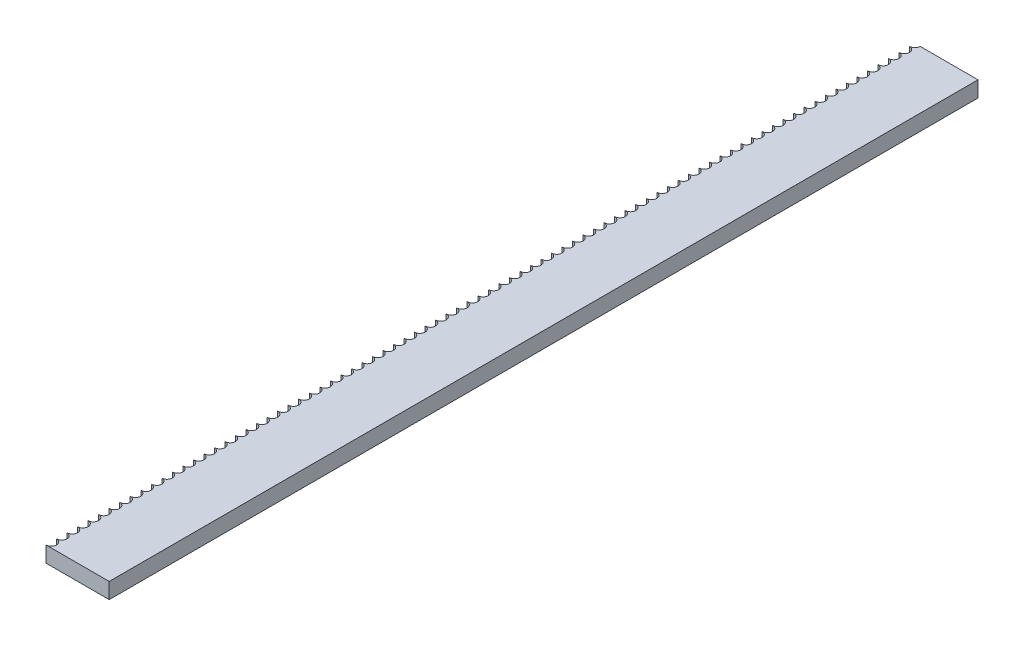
ISO-10303-21;
HEADER;
FILE_DESCRIPTION(('STEP AP214'),'2;1');
FILE_NAME('part.step','',(''),(''),'','','');
FILE_SCHEMA(('AUTOMOTIVE_DESIGN { 1 0 10303 214 1 1 1 1 }'));
ENDSEC;
DATA;
#1=APPLICATION_CONTEXT('core data for automotive mechanical design processes');
#2=APPLICATION_PROTOCOL_DEFINITION('international standard','automotive_design',2000,#1);
#3=PRODUCT_CONTEXT('',#1,'mechanical');
#4=PRODUCT('Part','Part','',(#3));
#5=PRODUCT_RELATED_PRODUCT_CATEGORY('part','',(#4));
#6=PRODUCT_DEFINITION_FORMATION('','',#4);
#7=PRODUCT_DEFINITION_CONTEXT('part definition',#1,'design');
#8=PRODUCT_DEFINITION('design','',#6,#7);
#9=PRODUCT_DEFINITION_SHAPE('','',#8);
#10=(LENGTH_UNIT() NAMED_UNIT(*) SI_UNIT(.MILLI.,.METRE.));
#11=(NAMED_UNIT(*) PLANE_ANGLE_UNIT() SI_UNIT($,.RADIAN.));
#12=(NAMED_UNIT(*) SI_UNIT($,.STERADIAN.) SOLID_ANGLE_UNIT());
#13=UNCERTAINTY_MEASURE_WITH_UNIT(LENGTH_MEASURE(1.E-05),#10,'distance_accuracy_value','');
#14=(GEOMETRIC_REPRESENTATION_CONTEXT(3) GLOBAL_UNCERTAINTY_ASSIGNED_CONTEXT((#13)) GLOBAL_UNIT_ASSIGNED_CONTEXT((#10,
#11,#12)) REPRESENTATION_CONTEXT('',''));
#15=CARTESIAN_POINT('',(0.,0.,0.));
#16=DIRECTION('',(0.,0.,1.));
#17=DIRECTION('',(1.,0.,0.));
#18=AXIS2_PLACEMENT_3D('',#15,#16,#17);
#19=CARTESIAN_POINT('',(0.,3.,0.));
#20=DIRECTION('',(0.,1.,0.));
#21=DIRECTION('',(0.,0.,1.));
#22=AXIS2_PLACEMENT_3D('',#19,#20,#21);
#23=PLANE('',#22);
#24=DIRECTION('',(-1.,0.,0.));
#25=VECTOR('',#24,1.);
#26=CARTESIAN_POINT('',(-6.00000000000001,3.,-82.5));
#27=LINE('',#26,#25);
#28=CARTESIAN_POINT('',(5.99999999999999,3.,-82.5));
#29=VERTEX_POINT('',#28);
#30=CARTESIAN_POINT('',(-5.00000000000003,3.,-82.5));
#31=VERTEX_POINT('',#30);
#32=EDGE_CURVE('E78',#29,#31,#27,.T.);
#33=ORIENTED_EDGE('',*,*,#32,.T.);
#34=CARTESIAN_POINT('',(-6.00000000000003,3.,-82.5));
#35=DIRECTION('',(0.,1.,0.));
#36=DIRECTION('',(0.,0.,1.));
#37=AXIS2_PLACEMENT_3D('',#34,#35,#36);
#38=CIRCLE('',#37,1.);
#39=CARTESIAN_POINT('',(-6.00000000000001,3.,-81.5));
#40=VERTEX_POINT('',#39);
#41=EDGE_CURVE('E579',#31,#40,#38,.F.);
#42=ORIENTED_EDGE('',*,*,#41,.T.);
#43=CARTESIAN_POINT('',(-6.00000000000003,3.,-80.5));
#44=DIRECTION('',(0.,1.,0.));
#45=DIRECTION('',(0.,0.,1.));
#46=AXIS2_PLACEMENT_3D('',#43,#44,#45);
#47=CIRCLE('',#46,1.);
#48=CARTESIAN_POINT('',(-6.00000000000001,3.,-79.5));
#49=VERTEX_POINT('',#48);
#50=EDGE_CURVE('E589',#40,#49,#47,.F.);
#51=ORIENTED_EDGE('',*,*,#50,.T.);
#52=CARTESIAN_POINT('',(-6.00000000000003,3.,-78.5));
#53=DIRECTION('',(0.,1.,0.));
#54=DIRECTION('',(0.,0.,1.));
#55=AXIS2_PLACEMENT_3D('',#52,#53,#54);
#56=CIRCLE('',#55,1.);
#57=CARTESIAN_POINT('',(-6.00000000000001,3.,-77.5));
#58=VERTEX_POINT('',#57);
#59=EDGE_CURVE('E601',#49,#58,#56,.F.);
#60=ORIENTED_EDGE('',*,*,#59,.T.);
#61=CARTESIAN_POINT('',(-6.00000000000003,3.,-76.5));
#62=DIRECTION('',(0.,1.,0.));
#63=DIRECTION('',(0.,0.,1.));
#64=AXIS2_PLACEMENT_3D('',#61,#62,#63);
#65=CIRCLE('',#64,1.);
#66=CARTESIAN_POINT('',(-6.00000000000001,3.,-75.5));
#67=VERTEX_POINT('',#66);
#68=EDGE_CURVE('E608',#58,#67,#65,.F.);
#69=ORIENTED_EDGE('',*,*,#68,.T.);
#70=CARTESIAN_POINT('',(-6.00000000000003,3.,-74.5));
#71=DIRECTION('',(0.,1.,0.));
#72=DIRECTION('',(0.,0.,1.));
#73=AXIS2_PLACEMENT_3D('',#70,#71,#72);
#74=CIRCLE('',#73,1.);
#75=CARTESIAN_POINT('',(-6.00000000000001,3.,-73.5));
#76=VERTEX_POINT('',#75);
#77=EDGE_CURVE('E616',#67,#76,#74,.F.);
#78=ORIENTED_EDGE('',*,*,#77,.T.);
#79=CARTESIAN_POINT('',(-6.00000000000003,3.,-72.5));
#80=DIRECTION('',(0.,1.,0.));
#81=DIRECTION('',(0.,0.,1.));
#82=AXIS2_PLACEMENT_3D('',#79,#80,#81);
#83=CIRCLE('',#82,1.);
#84=CARTESIAN_POINT('',(-6.00000000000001,3.,-71.5));
#85=VERTEX_POINT('',#84);
#86=EDGE_CURVE('E624',#76,#85,#83,.F.);
#87=ORIENTED_EDGE('',*,*,#86,.T.);
#88=CARTESIAN_POINT('',(-6.00000000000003,3.,-70.5));
#89=DIRECTION('',(0.,1.,0.));
#90=DIRECTION('',(0.,0.,1.));
#91=AXIS2_PLACEMENT_3D('',#88,#89,#90);
#92=CIRCLE('',#91,1.);
#93=CARTESIAN_POINT('',(-6.00000000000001,3.,-69.5));
#94=VERTEX_POINT('',#93);
#95=EDGE_CURVE('E632',#85,#94,#92,.F.);
#96=ORIENTED_EDGE('',*,*,#95,.T.);
#97=CARTESIAN_POINT('',(-6.00000000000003,3.,-68.5));
#98=DIRECTION('',(0.,1.,0.));
#99=DIRECTION('',(0.,0.,1.));
#100=AXIS2_PLACEMENT_3D('',#97,#98,#99);
#101=CIRCLE('',#100,1.);
#102=CARTESIAN_POINT('',(-6.00000000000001,3.,-67.5));
#103=VERTEX_POINT('',#102);
#104=EDGE_CURVE('E640',#94,#103,#101,.F.);
#105=ORIENTED_EDGE('',*,*,#104,.T.);
#106=CARTESIAN_POINT('',(-6.00000000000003,3.,-66.5));
#107=DIRECTION('',(0.,1.,0.));
#108=DIRECTION('',(0.,0.,1.));
#109=AXIS2_PLACEMENT_3D('',#106,#107,#108);
#110=CIRCLE('',#109,1.);
#111=CARTESIAN_POINT('',(-6.00000000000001,3.,-65.5));
#112=VERTEX_POINT('',#111);
#113=EDGE_CURVE('E648',#103,#112,#110,.F.);
#114=ORIENTED_EDGE('',*,*,#113,.T.);
#115=CARTESIAN_POINT('',(-6.00000000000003,3.,-64.5));
#116=DIRECTION('',(0.,1.,0.));
#117=DIRECTION('',(0.,0.,1.));
#118=AXIS2_PLACEMENT_3D('',#115,#116,#117);
#119=CIRCLE('',#118,1.);
#120=CARTESIAN_POINT('',(-6.00000000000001,3.,-63.5));
#121=VERTEX_POINT('',#120);
#122=EDGE_CURVE('E656',#112,#121,#119,.F.);
#123=ORIENTED_EDGE('',*,*,#122,.T.);
#124=CARTESIAN_POINT('',(-6.00000000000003,3.,-62.5));
#125=DIRECTION('',(0.,1.,0.));
#126=DIRECTION('',(0.,0.,1.));
#127=AXIS2_PLACEMENT_3D('',#124,#125,#126);
#128=CIRCLE('',#127,1.);
#129=CARTESIAN_POINT('',(-6.00000000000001,3.,-61.5));
#130=VERTEX_POINT('',#129);
#131=EDGE_CURVE('E664',#121,#130,#128,.F.);
#132=ORIENTED_EDGE('',*,*,#131,.T.);
#133=CARTESIAN_POINT('',(-6.00000000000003,3.,-60.5));
#134=DIRECTION('',(0.,1.,0.));
#135=DIRECTION('',(0.,0.,1.));
#136=AXIS2_PLACEMENT_3D('',#133,#134,#135);
#137=CIRCLE('',#136,1.);
#138=CARTESIAN_POINT('',(-6.00000000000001,3.,-59.5));
#139=VERTEX_POINT('',#138);
#140=EDGE_CURVE('E672',#130,#139,#137,.F.);
#141=ORIENTED_EDGE('',*,*,#140,.T.);
#142=CARTESIAN_POINT('',(-6.00000000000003,3.,-58.5));
#143=DIRECTION('',(0.,1.,0.));
#144=DIRECTION('',(0.,0.,1.));
#145=AXIS2_PLACEMENT_3D('',#142,#143,#144);
#146=CIRCLE('',#145,1.);
#147=CARTESIAN_POINT('',(-6.00000000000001,3.,-57.5));
#148=VERTEX_POINT('',#147);
#149=EDGE_CURVE('E680',#139,#148,#146,.F.);
#150=ORIENTED_EDGE('',*,*,#149,.T.);
#151=CARTESIAN_POINT('',(-6.00000000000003,3.,-56.5));
#152=DIRECTION('',(0.,1.,0.));
#153=DIRECTION('',(0.,0.,1.));
#154=AXIS2_PLACEMENT_3D('',#151,#152,#153);
#155=CIRCLE('',#154,1.);
#156=CARTESIAN_POINT('',(-6.00000000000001,3.,-55.5));
#157=VERTEX_POINT('',#156);
#158=EDGE_CURVE('E688',#148,#157,#155,.F.);
#159=ORIENTED_EDGE('',*,*,#158,.T.);
#160=CARTESIAN_POINT('',(-6.00000000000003,3.,-54.5));
#161=DIRECTION('',(0.,1.,0.));
#162=DIRECTION('',(0.,0.,1.));
#163=AXIS2_PLACEMENT_3D('',#160,#161,#162);
#164=CIRCLE('',#163,1.);
#165=CARTESIAN_POINT('',(-6.00000000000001,3.,-53.5));
#166=VERTEX_POINT('',#165);
#167=EDGE_CURVE('E696',#157,#166,#164,.F.);
#168=ORIENTED_EDGE('',*,*,#167,.T.);
#169=CARTESIAN_POINT('',(-6.00000000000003,3.,-52.5));
#170=DIRECTION('',(0.,1.,0.));
#171=DIRECTION('',(0.,0.,1.));
#172=AXIS2_PLACEMENT_3D('',#169,#170,#171);
#173=CIRCLE('',#172,1.);
#174=CARTESIAN_POINT('',(-6.00000000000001,3.,-51.5));
#175=VERTEX_POINT('',#174);
#176=EDGE_CURVE('E704',#166,#175,#173,.F.);
#177=ORIENTED_EDGE('',*,*,#176,.T.);
#178=CARTESIAN_POINT('',(-6.00000000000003,3.,-50.5));
#179=DIRECTION('',(0.,1.,0.));
#180=DIRECTION('',(0.,0.,1.));
#181=AXIS2_PLACEMENT_3D('',#178,#179,#180);
#182=CIRCLE('',#181,1.);
#183=CARTESIAN_POINT('',(-6.00000000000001,3.,-49.5));
#184=VERTEX_POINT('',#183);
#185=EDGE_CURVE('E712',#175,#184,#182,.F.);
#186=ORIENTED_EDGE('',*,*,#185,.T.);
#187=CARTESIAN_POINT('',(-6.00000000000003,3.,-48.5));
#188=DIRECTION('',(0.,1.,0.));
#189=DIRECTION('',(0.,0.,1.));
#190=AXIS2_PLACEMENT_3D('',#187,#188,#189);
#191=CIRCLE('',#190,1.);
#192=CARTESIAN_POINT('',(-6.00000000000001,3.,-47.5));
#193=VERTEX_POINT('',#192);
#194=EDGE_CURVE('E720',#184,#193,#191,.F.);
#195=ORIENTED_EDGE('',*,*,#194,.T.);
#196=CARTESIAN_POINT('',(-6.00000000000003,3.,-46.5));
#197=DIRECTION('',(0.,1.,0.));
#198=DIRECTION('',(0.,0.,1.));
#199=AXIS2_PLACEMENT_3D('',#196,#197,#198);
#200=CIRCLE('',#199,1.);
#201=CARTESIAN_POINT('',(-6.00000000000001,3.,-45.5));
#202=VERTEX_POINT('',#201);
#203=EDGE_CURVE('E728',#193,#202,#200,.F.);
#204=ORIENTED_EDGE('',*,*,#203,.T.);
#205=CARTESIAN_POINT('',(-6.00000000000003,3.,-44.5));
#206=DIRECTION('',(0.,1.,0.));
#207=DIRECTION('',(0.,0.,1.));
#208=AXIS2_PLACEMENT_3D('',#205,#206,#207);
#209=CIRCLE('',#208,1.);
#210=CARTESIAN_POINT('',(-6.00000000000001,3.,-43.5));
#211=VERTEX_POINT('',#210);
#212=EDGE_CURVE('E736',#202,#211,#209,.F.);
#213=ORIENTED_EDGE('',*,*,#212,.T.);
#214=CARTESIAN_POINT('',(-6.00000000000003,3.,-42.5));
#215=DIRECTION('',(0.,1.,0.));
#216=DIRECTION('',(0.,0.,1.));
#217=AXIS2_PLACEMENT_3D('',#214,#215,#216);
#218=CIRCLE('',#217,1.);
#219=CARTESIAN_POINT('',(-6.00000000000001,3.,-41.5));
#220=VERTEX_POINT('',#219);
#221=EDGE_CURVE('E744',#211,#220,#218,.F.);
#222=ORIENTED_EDGE('',*,*,#221,.T.);
#223=CARTESIAN_POINT('',(-6.00000000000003,3.,-40.5));
#224=DIRECTION('',(0.,1.,0.));
#225=DIRECTION('',(0.,0.,1.));
#226=AXIS2_PLACEMENT_3D('',#223,#224,#225);
#227=CIRCLE('',#226,1.);
#228=CARTESIAN_POINT('',(-6.00000000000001,3.,-39.5));
#229=VERTEX_POINT('',#228);
#230=EDGE_CURVE('E752',#220,#229,#227,.F.);
#231=ORIENTED_EDGE('',*,*,#230,.T.);
#232=CARTESIAN_POINT('',(-6.00000000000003,3.,-38.5));
#233=DIRECTION('',(0.,1.,0.));
#234=DIRECTION('',(0.,0.,1.));
#235=AXIS2_PLACEMENT_3D('',#232,#233,#234);
#236=CIRCLE('',#235,1.);
#237=CARTESIAN_POINT('',(-6.00000000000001,3.,-37.5));
#238=VERTEX_POINT('',#237);
#239=EDGE_CURVE('E760',#229,#238,#236,.F.);
#240=ORIENTED_EDGE('',*,*,#239,.T.);
#241=CARTESIAN_POINT('',(-6.00000000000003,3.,-36.5));
#242=DIRECTION('',(0.,1.,0.));
#243=DIRECTION('',(0.,0.,1.));
#244=AXIS2_PLACEMENT_3D('',#241,#242,#243);
#245=CIRCLE('',#244,1.);
#246=CARTESIAN_POINT('',(-6.00000000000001,3.,-35.5));
#247=VERTEX_POINT('',#246);
#248=EDGE_CURVE('E768',#238,#247,#245,.F.);
#249=ORIENTED_EDGE('',*,*,#248,.T.);
#250=CARTESIAN_POINT('',(-6.00000000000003,3.,-34.5));
#251=DIRECTION('',(0.,1.,0.));
#252=DIRECTION('',(0.,0.,1.));
#253=AXIS2_PLACEMENT_3D('',#250,#251,#252);
#254=CIRCLE('',#253,1.);
#255=CARTESIAN_POINT('',(-6.00000000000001,3.,-33.5));
#256=VERTEX_POINT('',#255);
#257=EDGE_CURVE('E776',#247,#256,#254,.F.);
#258=ORIENTED_EDGE('',*,*,#257,.T.);
#259=CARTESIAN_POINT('',(-6.00000000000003,3.,-32.5));
#260=DIRECTION('',(0.,1.,0.));
#261=DIRECTION('',(0.,0.,1.));
#262=AXIS2_PLACEMENT_3D('',#259,#260,#261);
#263=CIRCLE('',#262,1.);
#264=CARTESIAN_POINT('',(-6.00000000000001,3.,-31.5));
#265=VERTEX_POINT('',#264);
#266=EDGE_CURVE('E784',#256,#265,#263,.F.);
#267=ORIENTED_EDGE('',*,*,#266,.T.);
#268=CARTESIAN_POINT('',(-6.00000000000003,3.,-30.5));
#269=DIRECTION('',(0.,1.,0.));
#270=DIRECTION('',(0.,0.,1.));
#271=AXIS2_PLACEMENT_3D('',#268,#269,#270);
#272=CIRCLE('',#271,1.);
#273=CARTESIAN_POINT('',(-6.00000000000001,3.,-29.5));
#274=VERTEX_POINT('',#273);
#275=EDGE_CURVE('E792',#265,#274,#272,.F.);
#276=ORIENTED_EDGE('',*,*,#275,.T.);
#277=CARTESIAN_POINT('',(-6.00000000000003,3.,-28.5));
#278=DIRECTION('',(0.,1.,0.));
#279=DIRECTION('',(0.,0.,1.));
#280=AXIS2_PLACEMENT_3D('',#277,#278,#279);
#281=CIRCLE('',#280,1.);
#282=CARTESIAN_POINT('',(-6.00000000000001,3.,-27.5));
#283=VERTEX_POINT('',#282);
#284=EDGE_CURVE('E800',#274,#283,#281,.F.);
#285=ORIENTED_EDGE('',*,*,#284,.T.);
#286=CARTESIAN_POINT('',(-6.00000000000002,3.,-26.5));
#287=DIRECTION('',(0.,1.,0.));
#288=DIRECTION('',(0.,0.,1.));
#289=AXIS2_PLACEMENT_3D('',#286,#287,#288);
#290=CIRCLE('',#289,1.);
#291=CARTESIAN_POINT('',(-6.,3.,-25.5));
#292=VERTEX_POINT('',#291);
#293=EDGE_CURVE('E808',#283,#292,#290,.F.);
#294=ORIENTED_EDGE('',*,*,#293,.T.);
#295=CARTESIAN_POINT('',(-6.00000000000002,3.,-24.5));
#296=DIRECTION('',(0.,1.,0.));
#297=DIRECTION('',(0.,0.,1.));
#298=AXIS2_PLACEMENT_3D('',#295,#296,#297);
#299=CIRCLE('',#298,1.);
#300=CARTESIAN_POINT('',(-6.,3.,-23.5));
#301=VERTEX_POINT('',#300);
#302=EDGE_CURVE('E816',#292,#301,#299,.F.);
#303=ORIENTED_EDGE('',*,*,#302,.T.);
#304=CARTESIAN_POINT('',(-6.00000000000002,3.,-22.5));
#305=DIRECTION('',(0.,1.,0.));
#306=DIRECTION('',(0.,0.,1.));
#307=AXIS2_PLACEMENT_3D('',#304,#305,#306);
#308=CIRCLE('',#307,1.);
#309=CARTESIAN_POINT('',(-6.,3.,-21.5));
#310=VERTEX_POINT('',#309);
#311=EDGE_CURVE('E824',#301,#310,#308,.F.);
#312=ORIENTED_EDGE('',*,*,#311,.T.);
#313=CARTESIAN_POINT('',(-6.00000000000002,3.,-20.5));
#314=DIRECTION('',(0.,1.,0.));
#315=DIRECTION('',(0.,0.,1.));
#316=AXIS2_PLACEMENT_3D('',#313,#314,#315);
#317=CIRCLE('',#316,1.);
#318=CARTESIAN_POINT('',(-6.,3.,-19.5));
#319=VERTEX_POINT('',#318);
#320=EDGE_CURVE('E832',#310,#319,#317,.F.);
#321=ORIENTED_EDGE('',*,*,#320,.T.);
#322=CARTESIAN_POINT('',(-6.00000000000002,3.,-18.5));
#323=DIRECTION('',(0.,1.,0.));
#324=DIRECTION('',(0.,0.,1.));
#325=AXIS2_PLACEMENT_3D('',#322,#323,#324);
#326=CIRCLE('',#325,1.);
#327=CARTESIAN_POINT('',(-6.,3.,-17.5));
#328=VERTEX_POINT('',#327);
#329=EDGE_CURVE('E840',#319,#328,#326,.F.);
#330=ORIENTED_EDGE('',*,*,#329,.T.);
#331=CARTESIAN_POINT('',(-6.00000000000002,3.,-16.5));
#332=DIRECTION('',(0.,1.,0.));
#333=DIRECTION('',(0.,0.,1.));
#334=AXIS2_PLACEMENT_3D('',#331,#332,#333);
#335=CIRCLE('',#334,1.);
#336=CARTESIAN_POINT('',(-6.,3.,-15.5));
#337=VERTEX_POINT('',#336);
#338=EDGE_CURVE('E848',#328,#337,#335,.F.);
#339=ORIENTED_EDGE('',*,*,#338,.T.);
#340=CARTESIAN_POINT('',(-6.00000000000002,3.,-14.5));
#341=DIRECTION('',(0.,1.,0.));
#342=DIRECTION('',(0.,0.,1.));
#343=AXIS2_PLACEMENT_3D('',#340,#341,#342);
#344=CIRCLE('',#343,1.);
#345=CARTESIAN_POINT('',(-6.,3.,-13.5));
#346=VERTEX_POINT('',#345);
#347=EDGE_CURVE('E856',#337,#346,#344,.F.);
#348=ORIENTED_EDGE('',*,*,#347,.T.);
#349=CARTESIAN_POINT('',(-6.00000000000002,3.,-12.5));
#350=DIRECTION('',(0.,1.,0.));
#351=DIRECTION('',(0.,0.,1.));
#352=AXIS2_PLACEMENT_3D('',#349,#350,#351);
#353=CIRCLE('',#352,1.);
#354=CARTESIAN_POINT('',(-6.,3.,-11.5));
#355=VERTEX_POINT('',#354);
#356=EDGE_CURVE('E864',#346,#355,#353,.F.);
#357=ORIENTED_EDGE('',*,*,#356,.T.);
#358=CARTESIAN_POINT('',(-6.00000000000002,3.,-10.5));
#359=DIRECTION('',(0.,1.,0.));
#360=DIRECTION('',(0.,0.,1.));
#361=AXIS2_PLACEMENT_3D('',#358,#359,#360);
#362=CIRCLE('',#361,1.);
#363=CARTESIAN_POINT('',(-6.,3.,-9.49999999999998));
#364=VERTEX_POINT('',#363);
#365=EDGE_CURVE('E872',#355,#364,#362,.F.);
#366=ORIENTED_EDGE('',*,*,#365,.T.);
#367=CARTESIAN_POINT('',(-6.00000000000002,3.,-8.49999999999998));
#368=DIRECTION('',(0.,1.,0.));
#369=DIRECTION('',(0.,0.,1.));
#370=AXIS2_PLACEMENT_3D('',#367,#368,#369);
#371=CIRCLE('',#370,1.);
#372=CARTESIAN_POINT('',(-6.,3.,-7.49999999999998));
#373=VERTEX_POINT('',#372);
#374=EDGE_CURVE('E880',#364,#373,#371,.F.);
#375=ORIENTED_EDGE('',*,*,#374,.T.);
#376=CARTESIAN_POINT('',(-6.00000000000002,3.,-6.49999999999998));
#377=DIRECTION('',(0.,1.,0.));
#378=DIRECTION('',(0.,0.,1.));
#379=AXIS2_PLACEMENT_3D('',#376,#377,#378);
#380=CIRCLE('',#379,1.);
#381=CARTESIAN_POINT('',(-6.,3.,-5.49999999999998));
#382=VERTEX_POINT('',#381);
#383=EDGE_CURVE('E888',#373,#382,#380,.F.);
#384=ORIENTED_EDGE('',*,*,#383,.T.);
#385=CARTESIAN_POINT('',(-6.00000000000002,3.,-4.49999999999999));
#386=DIRECTION('',(0.,1.,0.));
#387=DIRECTION('',(0.,0.,1.));
#388=AXIS2_PLACEMENT_3D('',#385,#386,#387);
#389=CIRCLE('',#388,1.);
#390=CARTESIAN_POINT('',(-6.,3.,-3.49999999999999));
#391=VERTEX_POINT('',#390);
#392=EDGE_CURVE('E896',#382,#391,#389,.F.);
#393=ORIENTED_EDGE('',*,*,#392,.T.);
#394=CARTESIAN_POINT('',(-6.00000000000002,3.,-2.49999999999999));
#395=DIRECTION('',(0.,1.,0.));
#396=DIRECTION('',(0.,0.,1.));
#397=AXIS2_PLACEMENT_3D('',#394,#395,#396);
#398=CIRCLE('',#397,1.);
#399=CARTESIAN_POINT('',(-6.,3.,-1.49999999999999));
#400=VERTEX_POINT('',#399);
#401=EDGE_CURVE('E904',#391,#400,#398,.F.);
#402=ORIENTED_EDGE('',*,*,#401,.T.);
#403=CARTESIAN_POINT('',(-6.00000000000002,3.,-0.499999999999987));
#404=DIRECTION('',(0.,1.,0.));
#405=DIRECTION('',(0.,0.,1.));
#406=AXIS2_PLACEMENT_3D('',#403,#404,#405);
#407=CIRCLE('',#406,1.);
#408=CARTESIAN_POINT('',(-6.,3.,0.500000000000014));
#409=VERTEX_POINT('',#408);
#410=EDGE_CURVE('E912',#400,#409,#407,.F.);
#411=ORIENTED_EDGE('',*,*,#410,.T.);
#412=CARTESIAN_POINT('',(-6.00000000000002,3.,1.50000000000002));
#413=DIRECTION('',(0.,1.,0.));
#414=DIRECTION('',(0.,0.,1.));
#415=AXIS2_PLACEMENT_3D('',#412,#413,#414);
#416=CIRCLE('',#415,1.);
#417=CARTESIAN_POINT('',(-6.,3.,2.50000000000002));
#418=VERTEX_POINT('',#417);
#419=EDGE_CURVE('E920',#409,#418,#416,.F.);
#420=ORIENTED_EDGE('',*,*,#419,.T.);
#421=CARTESIAN_POINT('',(-6.00000000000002,3.,3.50000000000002));
#422=DIRECTION('',(0.,1.,0.));
#423=DIRECTION('',(0.,0.,1.));
#424=AXIS2_PLACEMENT_3D('',#421,#422,#423);
#425=CIRCLE('',#424,1.);
#426=CARTESIAN_POINT('',(-6.,3.,4.50000000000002));
#427=VERTEX_POINT('',#426);
#428=EDGE_CURVE('E928',#418,#427,#425,.F.);
#429=ORIENTED_EDGE('',*,*,#428,.T.);
#430=CARTESIAN_POINT('',(-6.00000000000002,3.,5.50000000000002));
#431=DIRECTION('',(0.,1.,0.));
#432=DIRECTION('',(0.,0.,1.));
#433=AXIS2_PLACEMENT_3D('',#430,#431,#432);
#434=CIRCLE('',#433,1.);
#435=CARTESIAN_POINT('',(-6.,3.,6.50000000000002));
#436=VERTEX_POINT('',#435);
#437=EDGE_CURVE('E936',#427,#436,#434,.F.);
#438=ORIENTED_EDGE('',*,*,#437,.T.);
#439=CARTESIAN_POINT('',(-6.00000000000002,3.,7.50000000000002));
#440=DIRECTION('',(0.,1.,0.));
#441=DIRECTION('',(0.,0.,1.));
#442=AXIS2_PLACEMENT_3D('',#439,#440,#441);
#443=CIRCLE('',#442,1.);
#444=CARTESIAN_POINT('',(-6.,3.,8.50000000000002));
#445=VERTEX_POINT('',#444);
#446=EDGE_CURVE('E944',#436,#445,#443,.F.);
#447=ORIENTED_EDGE('',*,*,#446,.T.);
#448=CARTESIAN_POINT('',(-6.00000000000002,3.,9.50000000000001));
#449=DIRECTION('',(0.,1.,0.));
#450=DIRECTION('',(0.,0.,1.));
#451=AXIS2_PLACEMENT_3D('',#448,#449,#450);
#452=CIRCLE('',#451,1.);
#453=CARTESIAN_POINT('',(-6.,3.,10.5));
#454=VERTEX_POINT('',#453);
#455=EDGE_CURVE('E952',#445,#454,#452,.F.);
#456=ORIENTED_EDGE('',*,*,#455,.T.);
#457=CARTESIAN_POINT('',(-6.00000000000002,3.,11.5));
#458=DIRECTION('',(0.,1.,0.));
#459=DIRECTION('',(0.,0.,1.));
#460=AXIS2_PLACEMENT_3D('',#457,#458,#459);
#461=CIRCLE('',#460,1.);
#462=CARTESIAN_POINT('',(-6.,3.,12.5));
#463=VERTEX_POINT('',#462);
#464=EDGE_CURVE('E960',#454,#463,#461,.F.);
#465=ORIENTED_EDGE('',*,*,#464,.T.);
#466=CARTESIAN_POINT('',(-6.00000000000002,3.,13.5));
#467=DIRECTION('',(0.,1.,0.));
#468=DIRECTION('',(0.,0.,1.));
#469=AXIS2_PLACEMENT_3D('',#466,#467,#468);
#470=CIRCLE('',#469,1.);
#471=CARTESIAN_POINT('',(-6.,3.,14.5));
#472=VERTEX_POINT('',#471);
#473=EDGE_CURVE('E968',#463,#472,#470,.F.);
#474=ORIENTED_EDGE('',*,*,#473,.T.);
#475=CARTESIAN_POINT('',(-6.00000000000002,3.,15.5));
#476=DIRECTION('',(0.,1.,0.));
#477=DIRECTION('',(0.,0.,1.));
#478=AXIS2_PLACEMENT_3D('',#475,#476,#477);
#479=CIRCLE('',#478,1.);
#480=CARTESIAN_POINT('',(-6.,3.,16.5));
#481=VERTEX_POINT('',#480);
#482=EDGE_CURVE('E976',#472,#481,#479,.F.);
#483=ORIENTED_EDGE('',*,*,#482,.T.);
#484=CARTESIAN_POINT('',(-6.00000000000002,3.,17.5));
#485=DIRECTION('',(0.,1.,0.));
#486=DIRECTION('',(0.,0.,1.));
#487=AXIS2_PLACEMENT_3D('',#484,#485,#486);
#488=CIRCLE('',#487,1.);
#489=CARTESIAN_POINT('',(-6.,3.,18.5));
#490=VERTEX_POINT('',#489);
#491=EDGE_CURVE('E984',#481,#490,#488,.F.);
#492=ORIENTED_EDGE('',*,*,#491,.T.);
#493=CARTESIAN_POINT('',(-6.00000000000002,3.,19.5));
#494=DIRECTION('',(0.,1.,0.));
#495=DIRECTION('',(0.,0.,1.));
#496=AXIS2_PLACEMENT_3D('',#493,#494,#495);
#497=CIRCLE('',#496,1.);
#498=CARTESIAN_POINT('',(-6.,3.,20.5));
#499=VERTEX_POINT('',#498);
#500=EDGE_CURVE('E992',#490,#499,#497,.F.);
#501=ORIENTED_EDGE('',*,*,#500,.T.);
#502=CARTESIAN_POINT('',(-6.00000000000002,3.,21.5));
#503=DIRECTION('',(0.,1.,0.));
#504=DIRECTION('',(0.,0.,1.));
#505=AXIS2_PLACEMENT_3D('',#502,#503,#504);
#506=CIRCLE('',#505,1.);
#507=CARTESIAN_POINT('',(-6.,3.,22.5));
#508=VERTEX_POINT('',#507);
#509=EDGE_CURVE('E1000',#499,#508,#506,.F.);
#510=ORIENTED_EDGE('',*,*,#509,.T.);
#511=CARTESIAN_POINT('',(-6.00000000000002,3.,23.5));
#512=DIRECTION('',(0.,1.,0.));
#513=DIRECTION('',(0.,0.,1.));
#514=AXIS2_PLACEMENT_3D('',#511,#512,#513);
#515=CIRCLE('',#514,1.);
#516=CARTESIAN_POINT('',(-6.,3.,24.5));
#517=VERTEX_POINT('',#516);
#518=EDGE_CURVE('E1008',#508,#517,#515,.F.);
#519=ORIENTED_EDGE('',*,*,#518,.T.);
#520=CARTESIAN_POINT('',(-6.00000000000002,3.,25.5));
#521=DIRECTION('',(0.,1.,0.));
#522=DIRECTION('',(0.,0.,1.));
#523=AXIS2_PLACEMENT_3D('',#520,#521,#522);
#524=CIRCLE('',#523,1.);
#525=CARTESIAN_POINT('',(-6.,3.,26.5));
#526=VERTEX_POINT('',#525);
#527=EDGE_CURVE('E1016',#517,#526,#524,.F.);
#528=ORIENTED_EDGE('',*,*,#527,.T.);
#529=CARTESIAN_POINT('',(-6.00000000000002,3.,27.5));
#530=DIRECTION('',(0.,1.,0.));
#531=DIRECTION('',(0.,0.,1.));
#532=AXIS2_PLACEMENT_3D('',#529,#530,#531);
#533=CIRCLE('',#532,1.);
#534=CARTESIAN_POINT('',(-6.,3.,28.5));
#535=VERTEX_POINT('',#534);
#536=EDGE_CURVE('E1024',#526,#535,#533,.F.);
#537=ORIENTED_EDGE('',*,*,#536,.T.);
#538=CARTESIAN_POINT('',(-6.00000000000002,3.,29.5));
#539=DIRECTION('',(0.,1.,0.));
#540=DIRECTION('',(0.,0.,1.));
#541=AXIS2_PLACEMENT_3D('',#538,#539,#540);
#542=CIRCLE('',#541,1.);
#543=CARTESIAN_POINT('',(-6.,3.,30.5));
#544=VERTEX_POINT('',#543);
#545=EDGE_CURVE('E1032',#535,#544,#542,.F.);
#546=ORIENTED_EDGE('',*,*,#545,.T.);
#547=CARTESIAN_POINT('',(-6.00000000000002,3.,31.5));
#548=DIRECTION('',(0.,1.,0.));
#549=DIRECTION('',(0.,0.,1.));
#550=AXIS2_PLACEMENT_3D('',#547,#548,#549);
#551=CIRCLE('',#550,1.);
#552=CARTESIAN_POINT('',(-6.,3.,32.5));
#553=VERTEX_POINT('',#552);
#554=EDGE_CURVE('E1040',#544,#553,#551,.F.);
#555=ORIENTED_EDGE('',*,*,#554,.T.);
#556=CARTESIAN_POINT('',(-6.00000000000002,3.,33.5));
#557=DIRECTION('',(0.,1.,0.));
#558=DIRECTION('',(0.,0.,1.));
#559=AXIS2_PLACEMENT_3D('',#556,#557,#558);
#560=CIRCLE('',#559,1.);
#561=CARTESIAN_POINT('',(-6.,3.,34.5));
#562=VERTEX_POINT('',#561);
#563=EDGE_CURVE('E1048',#553,#562,#560,.F.);
#564=ORIENTED_EDGE('',*,*,#563,.T.);
#565=CARTESIAN_POINT('',(-6.00000000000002,3.,35.5));
#566=DIRECTION('',(0.,1.,0.));
#567=DIRECTION('',(0.,0.,1.));
#568=AXIS2_PLACEMENT_3D('',#565,#566,#567);
#569=CIRCLE('',#568,1.);
#570=CARTESIAN_POINT('',(-6.,3.,36.5));
#571=VERTEX_POINT('',#570);
#572=EDGE_CURVE('E1056',#562,#571,#569,.F.);
#573=ORIENTED_EDGE('',*,*,#572,.T.);
#574=CARTESIAN_POINT('',(-6.00000000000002,3.,37.5));
#575=DIRECTION('',(0.,1.,0.));
#576=DIRECTION('',(0.,0.,1.));
#577=AXIS2_PLACEMENT_3D('',#574,#575,#576);
#578=CIRCLE('',#577,1.);
#579=CARTESIAN_POINT('',(-6.,3.,38.5));
#580=VERTEX_POINT('',#579);
#581=EDGE_CURVE('E1064',#571,#580,#578,.F.);
#582=ORIENTED_EDGE('',*,*,#581,.T.);
#583=CARTESIAN_POINT('',(-6.00000000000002,3.,39.5));
#584=DIRECTION('',(0.,1.,0.));
#585=DIRECTION('',(0.,0.,1.));
#586=AXIS2_PLACEMENT_3D('',#583,#584,#585);
#587=CIRCLE('',#586,1.);
#588=CARTESIAN_POINT('',(-6.,3.,40.5));
#589=VERTEX_POINT('',#588);
#590=EDGE_CURVE('E1072',#580,#589,#587,.F.);
#591=ORIENTED_EDGE('',*,*,#590,.T.);
#592=CARTESIAN_POINT('',(-6.00000000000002,3.,41.5));
#593=DIRECTION('',(0.,1.,0.));
#594=DIRECTION('',(0.,0.,1.));
#595=AXIS2_PLACEMENT_3D('',#592,#593,#594);
#596=CIRCLE('',#595,1.);
#597=CARTESIAN_POINT('',(-6.,3.,42.5));
#598=VERTEX_POINT('',#597);
#599=EDGE_CURVE('E1080',#589,#598,#596,.F.);
#600=ORIENTED_EDGE('',*,*,#599,.T.);
#601=CARTESIAN_POINT('',(-6.00000000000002,3.,43.5));
#602=DIRECTION('',(0.,1.,0.));
#603=DIRECTION('',(0.,0.,1.));
#604=AXIS2_PLACEMENT_3D('',#601,#602,#603);
#605=CIRCLE('',#604,1.);
#606=CARTESIAN_POINT('',(-6.,3.,44.5));
#607=VERTEX_POINT('',#606);
#608=EDGE_CURVE('E1088',#598,#607,#605,.F.);
#609=ORIENTED_EDGE('',*,*,#608,.T.);
#610=CARTESIAN_POINT('',(-6.00000000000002,3.,45.5));
#611=DIRECTION('',(0.,1.,0.));
#612=DIRECTION('',(0.,0.,1.));
#613=AXIS2_PLACEMENT_3D('',#610,#611,#612);
#614=CIRCLE('',#613,1.);
#615=CARTESIAN_POINT('',(-6.,3.,46.5));
#616=VERTEX_POINT('',#615);
#617=EDGE_CURVE('E1096',#607,#616,#614,.F.);
#618=ORIENTED_EDGE('',*,*,#617,.T.);
#619=CARTESIAN_POINT('',(-6.00000000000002,3.,47.5));
#620=DIRECTION('',(0.,1.,0.));
#621=DIRECTION('',(0.,0.,1.));
#622=AXIS2_PLACEMENT_3D('',#619,#620,#621);
#623=CIRCLE('',#622,1.);
#624=CARTESIAN_POINT('',(-6.,3.,48.5));
#625=VERTEX_POINT('',#624);
#626=EDGE_CURVE('E1104',#616,#625,#623,.F.);
#627=ORIENTED_EDGE('',*,*,#626,.T.);
#628=CARTESIAN_POINT('',(-6.00000000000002,3.,49.5));
#629=DIRECTION('',(0.,1.,0.));
#630=DIRECTION('',(0.,0.,1.));
#631=AXIS2_PLACEMENT_3D('',#628,#629,#630);
#632=CIRCLE('',#631,1.);
#633=CARTESIAN_POINT('',(-6.,3.,50.5));
#634=VERTEX_POINT('',#633);
#635=EDGE_CURVE('E1112',#625,#634,#632,.F.);
#636=ORIENTED_EDGE('',*,*,#635,.T.);
#637=CARTESIAN_POINT('',(-6.00000000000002,3.,51.5));
#638=DIRECTION('',(0.,1.,0.));
#639=DIRECTION('',(0.,0.,1.));
#640=AXIS2_PLACEMENT_3D('',#637,#638,#639);
#641=CIRCLE('',#640,1.);
#642=CARTESIAN_POINT('',(-5.99999999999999,3.,52.5));
#643=VERTEX_POINT('',#642);
#644=EDGE_CURVE('E1120',#634,#643,#641,.F.);
#645=ORIENTED_EDGE('',*,*,#644,.T.);
#646=CARTESIAN_POINT('',(-6.00000000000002,3.,53.5));
#647=DIRECTION('',(0.,1.,0.));
#648=DIRECTION('',(0.,0.,1.));
#649=AXIS2_PLACEMENT_3D('',#646,#647,#648);
#650=CIRCLE('',#649,1.);
#651=CARTESIAN_POINT('',(-5.99999999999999,3.,54.5));
#652=VERTEX_POINT('',#651);
#653=EDGE_CURVE('E1128',#643,#652,#650,.F.);
#654=ORIENTED_EDGE('',*,*,#653,.T.);
#655=CARTESIAN_POINT('',(-6.00000000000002,3.,55.5));
#656=DIRECTION('',(0.,1.,0.));
#657=DIRECTION('',(0.,0.,1.));
#658=AXIS2_PLACEMENT_3D('',#655,#656,#657);
#659=CIRCLE('',#658,1.);
#660=CARTESIAN_POINT('',(-5.99999999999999,3.,56.5));
#661=VERTEX_POINT('',#660);
#662=EDGE_CURVE('E1136',#652,#661,#659,.F.);
#663=ORIENTED_EDGE('',*,*,#662,.T.);
#664=CARTESIAN_POINT('',(-6.00000000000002,3.,57.5));
#665=DIRECTION('',(0.,1.,0.));
#666=DIRECTION('',(0.,0.,1.));
#667=AXIS2_PLACEMENT_3D('',#664,#665,#666);
#668=CIRCLE('',#667,1.);
#669=CARTESIAN_POINT('',(-5.99999999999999,3.,58.5));
#670=VERTEX_POINT('',#669);
#671=EDGE_CURVE('E1144',#661,#670,#668,.F.);
#672=ORIENTED_EDGE('',*,*,#671,.T.);
#673=CARTESIAN_POINT('',(-6.00000000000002,3.,59.5));
#674=DIRECTION('',(0.,1.,0.));
#675=DIRECTION('',(0.,0.,1.));
#676=AXIS2_PLACEMENT_3D('',#673,#674,#675);
#677=CIRCLE('',#676,1.);
#678=CARTESIAN_POINT('',(-5.99999999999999,3.,60.5));
#679=VERTEX_POINT('',#678);
#680=EDGE_CURVE('E1152',#670,#679,#677,.F.);
#681=ORIENTED_EDGE('',*,*,#680,.T.);
#682=CARTESIAN_POINT('',(-6.00000000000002,3.,61.5));
#683=DIRECTION('',(0.,1.,0.));
#684=DIRECTION('',(0.,0.,1.));
#685=AXIS2_PLACEMENT_3D('',#682,#683,#684);
#686=CIRCLE('',#685,1.);
#687=CARTESIAN_POINT('',(-5.99999999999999,3.,62.5));
#688=VERTEX_POINT('',#687);
#689=EDGE_CURVE('E1160',#679,#688,#686,.F.);
#690=ORIENTED_EDGE('',*,*,#689,.T.);
#691=CARTESIAN_POINT('',(-6.00000000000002,3.,63.5));
#692=DIRECTION('',(0.,1.,0.));
#693=DIRECTION('',(0.,0.,1.));
#694=AXIS2_PLACEMENT_3D('',#691,#692,#693);
#695=CIRCLE('',#694,1.);
#696=CARTESIAN_POINT('',(-5.99999999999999,3.,64.5));
#697=VERTEX_POINT('',#696);
#698=EDGE_CURVE('E1168',#688,#697,#695,.F.);
#699=ORIENTED_EDGE('',*,*,#698,.T.);
#700=CARTESIAN_POINT('',(-6.00000000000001,3.,65.5));
#701=DIRECTION('',(0.,1.,0.));
#702=DIRECTION('',(0.,0.,1.));
#703=AXIS2_PLACEMENT_3D('',#700,#701,#702);
#704=CIRCLE('',#703,1.);
#705=CARTESIAN_POINT('',(-5.99999999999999,3.,66.5));
#706=VERTEX_POINT('',#705);
#707=EDGE_CURVE('E1176',#697,#706,#704,.F.);
#708=ORIENTED_EDGE('',*,*,#707,.T.);
#709=CARTESIAN_POINT('',(-6.00000000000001,3.,67.5));
#710=DIRECTION('',(0.,1.,0.));
#711=DIRECTION('',(0.,0.,1.));
#712=AXIS2_PLACEMENT_3D('',#709,#710,#711);
#713=CIRCLE('',#712,1.);
#714=CARTESIAN_POINT('',(-5.99999999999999,3.,68.5));
#715=VERTEX_POINT('',#714);
#716=EDGE_CURVE('E1184',#706,#715,#713,.F.);
#717=ORIENTED_EDGE('',*,*,#716,.T.);
#718=CARTESIAN_POINT('',(-6.00000000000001,3.,69.5));
#719=DIRECTION('',(0.,1.,0.));
#720=DIRECTION('',(0.,0.,1.));
#721=AXIS2_PLACEMENT_3D('',#718,#719,#720);
#722=CIRCLE('',#721,1.);
#723=CARTESIAN_POINT('',(-5.99999999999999,3.,70.5));
#724=VERTEX_POINT('',#723);
#725=EDGE_CURVE('E1192',#715,#724,#722,.F.);
#726=ORIENTED_EDGE('',*,*,#725,.T.);
#727=CARTESIAN_POINT('',(-6.00000000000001,3.,71.5));
#728=DIRECTION('',(0.,1.,0.));
#729=DIRECTION('',(0.,0.,1.));
#730=AXIS2_PLACEMENT_3D('',#727,#728,#729);
#731=CIRCLE('',#730,1.);
#732=CARTESIAN_POINT('',(-5.99999999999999,3.,72.5));
#733=VERTEX_POINT('',#732);
#734=EDGE_CURVE('E1200',#724,#733,#731,.F.);
#735=ORIENTED_EDGE('',*,*,#734,.T.);
#736=CARTESIAN_POINT('',(-6.00000000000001,3.,73.5));
#737=DIRECTION('',(0.,1.,0.));
#738=DIRECTION('',(0.,0.,1.));
#739=AXIS2_PLACEMENT_3D('',#736,#737,#738);
#740=CIRCLE('',#739,1.);
#741=CARTESIAN_POINT('',(-5.99999999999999,3.,74.5));
#742=VERTEX_POINT('',#741);
#743=EDGE_CURVE('E1208',#733,#742,#740,.F.);
#744=ORIENTED_EDGE('',*,*,#743,.T.);
#745=CARTESIAN_POINT('',(-6.00000000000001,3.,75.5));
#746=DIRECTION('',(0.,1.,0.));
#747=DIRECTION('',(0.,0.,1.));
#748=AXIS2_PLACEMENT_3D('',#745,#746,#747);
#749=CIRCLE('',#748,1.);
#750=CARTESIAN_POINT('',(-5.99999999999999,3.,76.5));
#751=VERTEX_POINT('',#750);
#752=EDGE_CURVE('E1216',#742,#751,#749,.F.);
#753=ORIENTED_EDGE('',*,*,#752,.T.);
#754=CARTESIAN_POINT('',(-6.00000000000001,3.,77.5));
#755=DIRECTION('',(0.,1.,0.));
#756=DIRECTION('',(0.,0.,1.));
#757=AXIS2_PLACEMENT_3D('',#754,#755,#756);
#758=CIRCLE('',#757,1.);
#759=CARTESIAN_POINT('',(-5.99999999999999,3.,78.5));
#760=VERTEX_POINT('',#759);
#761=EDGE_CURVE('E1224',#751,#760,#758,.F.);
#762=ORIENTED_EDGE('',*,*,#761,.T.);
#763=CARTESIAN_POINT('',(-6.00000000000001,3.,79.5));
#764=DIRECTION('',(0.,1.,0.));
#765=DIRECTION('',(0.,0.,1.));
#766=AXIS2_PLACEMENT_3D('',#763,#764,#765);
#767=CIRCLE('',#766,1.);
#768=CARTESIAN_POINT('',(-5.99999999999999,3.,80.5));
#769=VERTEX_POINT('',#768);
#770=EDGE_CURVE('E1230',#760,#769,#767,.F.);
#771=ORIENTED_EDGE('',*,*,#770,.T.);
#772=CARTESIAN_POINT('',(-6.00000000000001,3.,81.5));
#773=DIRECTION('',(0.,1.,0.));
#774=DIRECTION('',(0.,0.,1.));
#775=AXIS2_PLACEMENT_3D('',#772,#773,#774);
#776=CIRCLE('',#775,1.);
#777=CARTESIAN_POINT('',(-5.99999999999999,3.,82.5));
#778=VERTEX_POINT('',#777);
#779=EDGE_CURVE('E1236',#769,#778,#776,.F.);
#780=ORIENTED_EDGE('',*,*,#779,.T.);
#781=DIRECTION('',(1.,0.,0.));
#782=VECTOR('',#781,1.);
#783=CARTESIAN_POINT('',(-5.99999999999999,3.,82.5));
#784=LINE('',#783,#782);
#785=CARTESIAN_POINT('',(6.00000000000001,3.,82.5));
#786=VERTEX_POINT('',#785);
#787=EDGE_CURVE('E57',#778,#786,#784,.T.);
#788=ORIENTED_EDGE('',*,*,#787,.T.);
#789=DIRECTION('',(0.,0.,-1.));
#790=VECTOR('',#789,1.);
#791=CARTESIAN_POINT('',(5.99999999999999,3.,-82.5));
#792=LINE('',#791,#790);
#793=EDGE_CURVE('E1239',#786,#29,#792,.T.);
#794=ORIENTED_EDGE('',*,*,#793,.T.);
#795=EDGE_LOOP('',(#33,#42,#51,#60,#69,#78,#87,#96,#105,#114,#123,#132,#141,#150,#159,#168,#177,
#186,#195,#204,#213,#222,#231,#240,#249,#258,#267,#276,#285,#294,#303,#312,#321,#330,#339,#348,
#357,#366,#375,#384,#393,#402,#411,#420,#429,#438,#447,#456,#465,#474,#483,#492,#501,#510,#519,
#528,#537,#546,#555,#564,#573,#582,#591,#600,#609,#618,#627,#636,#645,#654,#663,#672,#681,#690,
#699,#708,#717,#726,#735,#744,#753,#762,#771,#780,#788,#794));
#796=FACE_BOUND('',#795,.T.);
#797=ADVANCED_FACE('F33',(#796),#23,.T.);
#798=CARTESIAN_POINT('',(0.,0.,0.));
#799=DIRECTION('',(0.,1.,0.));
#800=DIRECTION('',(0.,0.,1.));
#801=AXIS2_PLACEMENT_3D('',#798,#799,#800);
#802=PLANE('',#801);
#803=CARTESIAN_POINT('',(-6.00000000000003,0.,-82.5));
#804=DIRECTION('',(0.,1.,0.));
#805=DIRECTION('',(0.,0.,1.));
#806=AXIS2_PLACEMENT_3D('',#803,#804,#805);
#807=CIRCLE('',#806,1.);
#808=CARTESIAN_POINT('',(-5.00000000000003,0.,-82.5));
#809=VERTEX_POINT('',#808);
#810=CARTESIAN_POINT('',(-6.00000000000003,0.,-81.5));
#811=VERTEX_POINT('',#810);
#812=EDGE_CURVE('E581',#809,#811,#807,.F.);
#813=ORIENTED_EDGE('',*,*,#812,.F.);
#814=DIRECTION('',(-1.,0.,0.));
#815=VECTOR('',#814,1.);
#816=CARTESIAN_POINT('',(-6.00000000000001,0.,-82.5));
#817=LINE('',#816,#815);
#818=CARTESIAN_POINT('',(5.99999999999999,0.,-82.5));
#819=VERTEX_POINT('',#818);
#820=EDGE_CURVE('E1246',#819,#809,#817,.T.);
#821=ORIENTED_EDGE('',*,*,#820,.F.);
#822=DIRECTION('',(0.,0.,-1.));
#823=VECTOR('',#822,1.);
#824=CARTESIAN_POINT('',(5.99999999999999,0.,-82.5));
#825=LINE('',#824,#823);
#826=CARTESIAN_POINT('',(6.00000000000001,0.,82.5));
#827=VERTEX_POINT('',#826);
#828=EDGE_CURVE('E1238',#827,#819,#825,.T.);
#829=ORIENTED_EDGE('',*,*,#828,.F.);
#830=DIRECTION('',(1.,0.,0.));
#831=VECTOR('',#830,1.);
#832=CARTESIAN_POINT('',(-5.99999999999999,0.,82.5));
#833=LINE('',#832,#831);
#834=CARTESIAN_POINT('',(-5.99999999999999,0.,82.5));
#835=VERTEX_POINT('',#834);
#836=EDGE_CURVE('E71',#835,#827,#833,.T.);
#837=ORIENTED_EDGE('',*,*,#836,.F.);
#838=CARTESIAN_POINT('',(-6.00000000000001,0.,81.5));
#839=DIRECTION('',(0.,1.,0.));
#840=DIRECTION('',(0.,0.,1.));
#841=AXIS2_PLACEMENT_3D('',#838,#839,#840);
#842=CIRCLE('',#841,1.);
#843=CARTESIAN_POINT('',(-5.99999999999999,0.,80.5));
#844=VERTEX_POINT('',#843);
#845=EDGE_CURVE('E11',#844,#835,#842,.F.);
#846=ORIENTED_EDGE('',*,*,#845,.F.);
#847=CARTESIAN_POINT('',(-6.00000000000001,0.,79.5));
#848=DIRECTION('',(0.,1.,0.));
#849=DIRECTION('',(0.,0.,1.));
#850=AXIS2_PLACEMENT_3D('',#847,#848,#849);
#851=CIRCLE('',#850,1.);
#852=CARTESIAN_POINT('',(-6.00000000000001,0.,78.5));
#853=VERTEX_POINT('',#852);
#854=EDGE_CURVE('E48',#853,#844,#851,.F.);
#855=ORIENTED_EDGE('',*,*,#854,.F.);
#856=CARTESIAN_POINT('',(-6.00000000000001,0.,77.5));
#857=DIRECTION('',(0.,1.,0.));
#858=DIRECTION('',(0.,0.,1.));
#859=AXIS2_PLACEMENT_3D('',#856,#857,#858);
#860=CIRCLE('',#859,1.);
#861=CARTESIAN_POINT('',(-6.00000000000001,0.,76.5));
#862=VERTEX_POINT('',#861);
#863=EDGE_CURVE('E1222',#862,#853,#860,.F.);
#864=ORIENTED_EDGE('',*,*,#863,.F.);
#865=CARTESIAN_POINT('',(-6.00000000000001,0.,75.5));
#866=DIRECTION('',(0.,1.,0.));
#867=DIRECTION('',(0.,0.,1.));
#868=AXIS2_PLACEMENT_3D('',#865,#866,#867);
#869=CIRCLE('',#868,1.);
#870=CARTESIAN_POINT('',(-6.00000000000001,0.,74.5));
#871=VERTEX_POINT('',#870);
#872=EDGE_CURVE('E1214',#871,#862,#869,.F.);
#873=ORIENTED_EDGE('',*,*,#872,.F.);
#874=CARTESIAN_POINT('',(-6.00000000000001,0.,73.5));
#875=DIRECTION('',(0.,1.,0.));
#876=DIRECTION('',(0.,0.,1.));
#877=AXIS2_PLACEMENT_3D('',#874,#875,#876);
#878=CIRCLE('',#877,1.);
#879=CARTESIAN_POINT('',(-6.00000000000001,0.,72.5));
#880=VERTEX_POINT('',#879);
#881=EDGE_CURVE('E1206',#880,#871,#878,.F.);
#882=ORIENTED_EDGE('',*,*,#881,.F.);
#883=CARTESIAN_POINT('',(-6.00000000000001,0.,71.5));
#884=DIRECTION('',(0.,1.,0.));
#885=DIRECTION('',(0.,0.,1.));
#886=AXIS2_PLACEMENT_3D('',#883,#884,#885);
#887=CIRCLE('',#886,1.);
#888=CARTESIAN_POINT('',(-6.00000000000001,0.,70.5));
#889=VERTEX_POINT('',#888);
#890=EDGE_CURVE('E1198',#889,#880,#887,.F.);
#891=ORIENTED_EDGE('',*,*,#890,.F.);
#892=CARTESIAN_POINT('',(-6.00000000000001,0.,69.5));
#893=DIRECTION('',(0.,1.,0.));
#894=DIRECTION('',(0.,0.,1.));
#895=AXIS2_PLACEMENT_3D('',#892,#893,#894);
#896=CIRCLE('',#895,1.);
#897=CARTESIAN_POINT('',(-6.00000000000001,0.,68.5));
#898=VERTEX_POINT('',#897);
#899=EDGE_CURVE('E1190',#898,#889,#896,.F.);
#900=ORIENTED_EDGE('',*,*,#899,.F.);
#901=CARTESIAN_POINT('',(-6.00000000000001,0.,67.5));
#902=DIRECTION('',(0.,1.,0.));
#903=DIRECTION('',(0.,0.,1.));
#904=AXIS2_PLACEMENT_3D('',#901,#902,#903);
#905=CIRCLE('',#904,1.);
#906=CARTESIAN_POINT('',(-6.00000000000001,0.,66.5));
#907=VERTEX_POINT('',#906);
#908=EDGE_CURVE('E1182',#907,#898,#905,.F.);
#909=ORIENTED_EDGE('',*,*,#908,.F.);
#910=CARTESIAN_POINT('',(-6.00000000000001,0.,65.5));
#911=DIRECTION('',(0.,1.,0.));
#912=DIRECTION('',(0.,0.,1.));
#913=AXIS2_PLACEMENT_3D('',#910,#911,#912);
#914=CIRCLE('',#913,1.);
#915=CARTESIAN_POINT('',(-6.00000000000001,0.,64.5));
#916=VERTEX_POINT('',#915);
#917=EDGE_CURVE('E1174',#916,#907,#914,.F.);
#918=ORIENTED_EDGE('',*,*,#917,.F.);
#919=CARTESIAN_POINT('',(-6.00000000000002,0.,63.5));
#920=DIRECTION('',(0.,1.,0.));
#921=DIRECTION('',(0.,0.,1.));
#922=AXIS2_PLACEMENT_3D('',#919,#920,#921);
#923=CIRCLE('',#922,1.);
#924=CARTESIAN_POINT('',(-6.00000000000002,0.,62.5));
#925=VERTEX_POINT('',#924);
#926=EDGE_CURVE('E1166',#925,#916,#923,.F.);
#927=ORIENTED_EDGE('',*,*,#926,.F.);
#928=CARTESIAN_POINT('',(-6.00000000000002,0.,61.5));
#929=DIRECTION('',(0.,1.,0.));
#930=DIRECTION('',(0.,0.,1.));
#931=AXIS2_PLACEMENT_3D('',#928,#929,#930);
#932=CIRCLE('',#931,1.);
#933=CARTESIAN_POINT('',(-6.00000000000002,0.,60.5));
#934=VERTEX_POINT('',#933);
#935=EDGE_CURVE('E1158',#934,#925,#932,.F.);
#936=ORIENTED_EDGE('',*,*,#935,.F.);
#937=CARTESIAN_POINT('',(-6.00000000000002,0.,59.5));
#938=DIRECTION('',(0.,1.,0.));
#939=DIRECTION('',(0.,0.,1.));
#940=AXIS2_PLACEMENT_3D('',#937,#938,#939);
#941=CIRCLE('',#940,1.);
#942=CARTESIAN_POINT('',(-6.00000000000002,0.,58.5));
#943=VERTEX_POINT('',#942);
#944=EDGE_CURVE('E1150',#943,#934,#941,.F.);
#945=ORIENTED_EDGE('',*,*,#944,.F.);
#946=CARTESIAN_POINT('',(-6.00000000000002,0.,57.5));
#947=DIRECTION('',(0.,1.,0.));
#948=DIRECTION('',(0.,0.,1.));
#949=AXIS2_PLACEMENT_3D('',#946,#947,#948);
#950=CIRCLE('',#949,1.);
#951=CARTESIAN_POINT('',(-6.00000000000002,0.,56.5));
#952=VERTEX_POINT('',#951);
#953=EDGE_CURVE('E1142',#952,#943,#950,.F.);
#954=ORIENTED_EDGE('',*,*,#953,.F.);
#955=CARTESIAN_POINT('',(-6.00000000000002,0.,55.5));
#956=DIRECTION('',(0.,1.,0.));
#957=DIRECTION('',(0.,0.,1.));
#958=AXIS2_PLACEMENT_3D('',#955,#956,#957);
#959=CIRCLE('',#958,1.);
#960=CARTESIAN_POINT('',(-6.00000000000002,0.,54.5));
#961=VERTEX_POINT('',#960);
#962=EDGE_CURVE('E1134',#961,#952,#959,.F.);
#963=ORIENTED_EDGE('',*,*,#962,.F.);
#964=CARTESIAN_POINT('',(-6.00000000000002,0.,53.5));
#965=DIRECTION('',(0.,1.,0.));
#966=DIRECTION('',(0.,0.,1.));
#967=AXIS2_PLACEMENT_3D('',#964,#965,#966);
#968=CIRCLE('',#967,1.);
#969=CARTESIAN_POINT('',(-6.00000000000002,0.,52.5));
#970=VERTEX_POINT('',#969);
#971=EDGE_CURVE('E1126',#970,#961,#968,.F.);
#972=ORIENTED_EDGE('',*,*,#971,.F.);
#973=CARTESIAN_POINT('',(-6.00000000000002,0.,51.5));
#974=DIRECTION('',(0.,1.,0.));
#975=DIRECTION('',(0.,0.,1.));
#976=AXIS2_PLACEMENT_3D('',#973,#974,#975);
#977=CIRCLE('',#976,1.);
#978=CARTESIAN_POINT('',(-6.00000000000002,0.,50.5));
#979=VERTEX_POINT('',#978);
#980=EDGE_CURVE('E1118',#979,#970,#977,.F.);
#981=ORIENTED_EDGE('',*,*,#980,.F.);
#982=CARTESIAN_POINT('',(-6.00000000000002,0.,49.5));
#983=DIRECTION('',(0.,1.,0.));
#984=DIRECTION('',(0.,0.,1.));
#985=AXIS2_PLACEMENT_3D('',#982,#983,#984);
#986=CIRCLE('',#985,1.);
#987=CARTESIAN_POINT('',(-6.00000000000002,0.,48.5));
#988=VERTEX_POINT('',#987);
#989=EDGE_CURVE('E1110',#988,#979,#986,.F.);
#990=ORIENTED_EDGE('',*,*,#989,.F.);
#991=CARTESIAN_POINT('',(-6.00000000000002,0.,47.5));
#992=DIRECTION('',(0.,1.,0.));
#993=DIRECTION('',(0.,0.,1.));
#994=AXIS2_PLACEMENT_3D('',#991,#992,#993);
#995=CIRCLE('',#994,1.);
#996=CARTESIAN_POINT('',(-6.00000000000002,0.,46.5));
#997=VERTEX_POINT('',#996);
#998=EDGE_CURVE('E1102',#997,#988,#995,.F.);
#999=ORIENTED_EDGE('',*,*,#998,.F.);
#1000=CARTESIAN_POINT('',(-6.00000000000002,0.,45.5));
#1001=DIRECTION('',(0.,1.,0.));
#1002=DIRECTION('',(0.,0.,1.));
#1003=AXIS2_PLACEMENT_3D('',#1000,#1001,#1002);
#1004=CIRCLE('',#1003,1.);
#1005=CARTESIAN_POINT('',(-6.00000000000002,0.,44.5));
#1006=VERTEX_POINT('',#1005);
#1007=EDGE_CURVE('E1094',#1006,#997,#1004,.F.);
#1008=ORIENTED_EDGE('',*,*,#1007,.F.);
#1009=CARTESIAN_POINT('',(-6.00000000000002,0.,43.5));
#1010=DIRECTION('',(0.,1.,0.));
#1011=DIRECTION('',(0.,0.,1.));
#1012=AXIS2_PLACEMENT_3D('',#1009,#1010,#1011);
#1013=CIRCLE('',#1012,1.);
#1014=CARTESIAN_POINT('',(-6.00000000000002,0.,42.5));
#1015=VERTEX_POINT('',#1014);
#1016=EDGE_CURVE('E1086',#1015,#1006,#1013,.F.);
#1017=ORIENTED_EDGE('',*,*,#1016,.F.);
#1018=CARTESIAN_POINT('',(-6.00000000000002,0.,41.5));
#1019=DIRECTION('',(0.,1.,0.));
#1020=DIRECTION('',(0.,0.,1.));
#1021=AXIS2_PLACEMENT_3D('',#1018,#1019,#1020);
#1022=CIRCLE('',#1021,1.);
#1023=CARTESIAN_POINT('',(-6.00000000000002,0.,40.5));
#1024=VERTEX_POINT('',#1023);
#1025=EDGE_CURVE('E1078',#1024,#1015,#1022,.F.);
#1026=ORIENTED_EDGE('',*,*,#1025,.F.);
#1027=CARTESIAN_POINT('',(-6.00000000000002,0.,39.5));
#1028=DIRECTION('',(0.,1.,0.));
#1029=DIRECTION('',(0.,0.,1.));
#1030=AXIS2_PLACEMENT_3D('',#1027,#1028,#1029);
#1031=CIRCLE('',#1030,1.);
#1032=CARTESIAN_POINT('',(-6.00000000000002,0.,38.5));
#1033=VERTEX_POINT('',#1032);
#1034=EDGE_CURVE('E1070',#1033,#1024,#1031,.F.);
#1035=ORIENTED_EDGE('',*,*,#1034,.F.);
#1036=CARTESIAN_POINT('',(-6.00000000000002,0.,37.5));
#1037=DIRECTION('',(0.,1.,0.));
#1038=DIRECTION('',(0.,0.,1.));
#1039=AXIS2_PLACEMENT_3D('',#1036,#1037,#1038);
#1040=CIRCLE('',#1039,1.);
#1041=CARTESIAN_POINT('',(-6.00000000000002,0.,36.5));
#1042=VERTEX_POINT('',#1041);
#1043=EDGE_CURVE('E1062',#1042,#1033,#1040,.F.);
#1044=ORIENTED_EDGE('',*,*,#1043,.F.);
#1045=CARTESIAN_POINT('',(-6.00000000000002,0.,35.5));
#1046=DIRECTION('',(0.,1.,0.));
#1047=DIRECTION('',(0.,0.,1.));
#1048=AXIS2_PLACEMENT_3D('',#1045,#1046,#1047);
#1049=CIRCLE('',#1048,1.);
#1050=CARTESIAN_POINT('',(-6.00000000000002,0.,34.5));
#1051=VERTEX_POINT('',#1050);
#1052=EDGE_CURVE('E1054',#1051,#1042,#1049,.F.);
#1053=ORIENTED_EDGE('',*,*,#1052,.F.);
#1054=CARTESIAN_POINT('',(-6.00000000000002,0.,33.5));
#1055=DIRECTION('',(0.,1.,0.));
#1056=DIRECTION('',(0.,0.,1.));
#1057=AXIS2_PLACEMENT_3D('',#1054,#1055,#1056);
#1058=CIRCLE('',#1057,1.);
#1059=CARTESIAN_POINT('',(-6.00000000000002,0.,32.5));
#1060=VERTEX_POINT('',#1059);
#1061=EDGE_CURVE('E1046',#1060,#1051,#1058,.F.);
#1062=ORIENTED_EDGE('',*,*,#1061,.F.);
#1063=CARTESIAN_POINT('',(-6.00000000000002,0.,31.5));
#1064=DIRECTION('',(0.,1.,0.));
#1065=DIRECTION('',(0.,0.,1.));
#1066=AXIS2_PLACEMENT_3D('',#1063,#1064,#1065);
#1067=CIRCLE('',#1066,1.);
#1068=CARTESIAN_POINT('',(-6.00000000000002,0.,30.5));
#1069=VERTEX_POINT('',#1068);
#1070=EDGE_CURVE('E1038',#1069,#1060,#1067,.F.);
#1071=ORIENTED_EDGE('',*,*,#1070,.F.);
#1072=CARTESIAN_POINT('',(-6.00000000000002,0.,29.5));
#1073=DIRECTION('',(0.,1.,0.));
#1074=DIRECTION('',(0.,0.,1.));
#1075=AXIS2_PLACEMENT_3D('',#1072,#1073,#1074);
#1076=CIRCLE('',#1075,1.);
#1077=CARTESIAN_POINT('',(-6.00000000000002,0.,28.5));
#1078=VERTEX_POINT('',#1077);
#1079=EDGE_CURVE('E1030',#1078,#1069,#1076,.F.);
#1080=ORIENTED_EDGE('',*,*,#1079,.F.);
#1081=CARTESIAN_POINT('',(-6.00000000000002,0.,27.5));
#1082=DIRECTION('',(0.,1.,0.));
#1083=DIRECTION('',(0.,0.,1.));
#1084=AXIS2_PLACEMENT_3D('',#1081,#1082,#1083);
#1085=CIRCLE('',#1084,1.);
#1086=CARTESIAN_POINT('',(-6.00000000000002,0.,26.5));
#1087=VERTEX_POINT('',#1086);
#1088=EDGE_CURVE('E1022',#1087,#1078,#1085,.F.);
#1089=ORIENTED_EDGE('',*,*,#1088,.F.);
#1090=CARTESIAN_POINT('',(-6.00000000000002,0.,25.5));
#1091=DIRECTION('',(0.,1.,0.));
#1092=DIRECTION('',(0.,0.,1.));
#1093=AXIS2_PLACEMENT_3D('',#1090,#1091,#1092);
#1094=CIRCLE('',#1093,1.);
#1095=CARTESIAN_POINT('',(-6.00000000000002,0.,24.5));
#1096=VERTEX_POINT('',#1095);
#1097=EDGE_CURVE('E1014',#1096,#1087,#1094,.F.);
#1098=ORIENTED_EDGE('',*,*,#1097,.F.);
#1099=CARTESIAN_POINT('',(-6.00000000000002,0.,23.5));
#1100=DIRECTION('',(0.,1.,0.));
#1101=DIRECTION('',(0.,0.,1.));
#1102=AXIS2_PLACEMENT_3D('',#1099,#1100,#1101);
#1103=CIRCLE('',#1102,1.);
#1104=CARTESIAN_POINT('',(-6.00000000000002,0.,22.5));
#1105=VERTEX_POINT('',#1104);
#1106=EDGE_CURVE('E1006',#1105,#1096,#1103,.F.);
#1107=ORIENTED_EDGE('',*,*,#1106,.F.);
#1108=CARTESIAN_POINT('',(-6.00000000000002,0.,21.5));
#1109=DIRECTION('',(0.,1.,0.));
#1110=DIRECTION('',(0.,0.,1.));
#1111=AXIS2_PLACEMENT_3D('',#1108,#1109,#1110);
#1112=CIRCLE('',#1111,1.);
#1113=CARTESIAN_POINT('',(-6.00000000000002,0.,20.5));
#1114=VERTEX_POINT('',#1113);
#1115=EDGE_CURVE('E998',#1114,#1105,#1112,.F.);
#1116=ORIENTED_EDGE('',*,*,#1115,.F.);
#1117=CARTESIAN_POINT('',(-6.00000000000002,0.,19.5));
#1118=DIRECTION('',(0.,1.,0.));
#1119=DIRECTION('',(0.,0.,1.));
#1120=AXIS2_PLACEMENT_3D('',#1117,#1118,#1119);
#1121=CIRCLE('',#1120,1.);
#1122=CARTESIAN_POINT('',(-6.00000000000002,0.,18.5));
#1123=VERTEX_POINT('',#1122);
#1124=EDGE_CURVE('E990',#1123,#1114,#1121,.F.);
#1125=ORIENTED_EDGE('',*,*,#1124,.F.);
#1126=CARTESIAN_POINT('',(-6.00000000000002,0.,17.5));
#1127=DIRECTION('',(0.,1.,0.));
#1128=DIRECTION('',(0.,0.,1.));
#1129=AXIS2_PLACEMENT_3D('',#1126,#1127,#1128);
#1130=CIRCLE('',#1129,1.);
#1131=CARTESIAN_POINT('',(-6.00000000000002,0.,16.5));
#1132=VERTEX_POINT('',#1131);
#1133=EDGE_CURVE('E982',#1132,#1123,#1130,.F.);
#1134=ORIENTED_EDGE('',*,*,#1133,.F.);
#1135=CARTESIAN_POINT('',(-6.00000000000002,0.,15.5));
#1136=DIRECTION('',(0.,1.,0.));
#1137=DIRECTION('',(0.,0.,1.));
#1138=AXIS2_PLACEMENT_3D('',#1135,#1136,#1137);
#1139=CIRCLE('',#1138,1.);
#1140=CARTESIAN_POINT('',(-6.00000000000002,0.,14.5));
#1141=VERTEX_POINT('',#1140);
#1142=EDGE_CURVE('E974',#1141,#1132,#1139,.F.);
#1143=ORIENTED_EDGE('',*,*,#1142,.F.);
#1144=CARTESIAN_POINT('',(-6.00000000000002,0.,13.5));
#1145=DIRECTION('',(0.,1.,0.));
#1146=DIRECTION('',(0.,0.,1.));
#1147=AXIS2_PLACEMENT_3D('',#1144,#1145,#1146);
#1148=CIRCLE('',#1147,1.);
#1149=CARTESIAN_POINT('',(-6.00000000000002,0.,12.5));
#1150=VERTEX_POINT('',#1149);
#1151=EDGE_CURVE('E966',#1150,#1141,#1148,.F.);
#1152=ORIENTED_EDGE('',*,*,#1151,.F.);
#1153=CARTESIAN_POINT('',(-6.00000000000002,0.,11.5));
#1154=DIRECTION('',(0.,1.,0.));
#1155=DIRECTION('',(0.,0.,1.));
#1156=AXIS2_PLACEMENT_3D('',#1153,#1154,#1155);
#1157=CIRCLE('',#1156,1.);
#1158=CARTESIAN_POINT('',(-6.00000000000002,0.,10.5));
#1159=VERTEX_POINT('',#1158);
#1160=EDGE_CURVE('E958',#1159,#1150,#1157,.F.);
#1161=ORIENTED_EDGE('',*,*,#1160,.F.);
#1162=CARTESIAN_POINT('',(-6.00000000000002,0.,9.50000000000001));
#1163=DIRECTION('',(0.,1.,0.));
#1164=DIRECTION('',(0.,0.,1.));
#1165=AXIS2_PLACEMENT_3D('',#1162,#1163,#1164);
#1166=CIRCLE('',#1165,1.);
#1167=CARTESIAN_POINT('',(-6.00000000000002,0.,8.50000000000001));
#1168=VERTEX_POINT('',#1167);
#1169=EDGE_CURVE('E950',#1168,#1159,#1166,.F.);
#1170=ORIENTED_EDGE('',*,*,#1169,.F.);
#1171=CARTESIAN_POINT('',(-6.00000000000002,0.,7.50000000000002));
#1172=DIRECTION('',(0.,1.,0.));
#1173=DIRECTION('',(0.,0.,1.));
#1174=AXIS2_PLACEMENT_3D('',#1171,#1172,#1173);
#1175=CIRCLE('',#1174,1.);
#1176=CARTESIAN_POINT('',(-6.00000000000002,0.,6.50000000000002));
#1177=VERTEX_POINT('',#1176);
#1178=EDGE_CURVE('E942',#1177,#1168,#1175,.F.);
#1179=ORIENTED_EDGE('',*,*,#1178,.F.);
#1180=CARTESIAN_POINT('',(-6.00000000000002,0.,5.50000000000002));
#1181=DIRECTION('',(0.,1.,0.));
#1182=DIRECTION('',(0.,0.,1.));
#1183=AXIS2_PLACEMENT_3D('',#1180,#1181,#1182);
#1184=CIRCLE('',#1183,1.);
#1185=CARTESIAN_POINT('',(-6.00000000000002,0.,4.50000000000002));
#1186=VERTEX_POINT('',#1185);
#1187=EDGE_CURVE('E934',#1186,#1177,#1184,.F.);
#1188=ORIENTED_EDGE('',*,*,#1187,.F.);
#1189=CARTESIAN_POINT('',(-6.00000000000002,0.,3.50000000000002));
#1190=DIRECTION('',(0.,1.,0.));
#1191=DIRECTION('',(0.,0.,1.));
#1192=AXIS2_PLACEMENT_3D('',#1189,#1190,#1191);
#1193=CIRCLE('',#1192,1.);
#1194=CARTESIAN_POINT('',(-6.00000000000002,0.,2.50000000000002));
#1195=VERTEX_POINT('',#1194);
#1196=EDGE_CURVE('E926',#1195,#1186,#1193,.F.);
#1197=ORIENTED_EDGE('',*,*,#1196,.F.);
#1198=CARTESIAN_POINT('',(-6.00000000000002,0.,1.50000000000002));
#1199=DIRECTION('',(0.,1.,0.));
#1200=DIRECTION('',(0.,0.,1.));
#1201=AXIS2_PLACEMENT_3D('',#1198,#1199,#1200);
#1202=CIRCLE('',#1201,1.);
#1203=CARTESIAN_POINT('',(-6.00000000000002,0.,0.500000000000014));
#1204=VERTEX_POINT('',#1203);
#1205=EDGE_CURVE('E918',#1204,#1195,#1202,.F.);
#1206=ORIENTED_EDGE('',*,*,#1205,.F.);
#1207=CARTESIAN_POINT('',(-6.00000000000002,0.,-0.499999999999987));
#1208=DIRECTION('',(0.,1.,0.));
#1209=DIRECTION('',(0.,0.,1.));
#1210=AXIS2_PLACEMENT_3D('',#1207,#1208,#1209);
#1211=CIRCLE('',#1210,1.);
#1212=CARTESIAN_POINT('',(-6.00000000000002,0.,-1.49999999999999));
#1213=VERTEX_POINT('',#1212);
#1214=EDGE_CURVE('E910',#1213,#1204,#1211,.F.);
#1215=ORIENTED_EDGE('',*,*,#1214,.F.);
#1216=CARTESIAN_POINT('',(-6.00000000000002,0.,-2.49999999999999));
#1217=DIRECTION('',(0.,1.,0.));
#1218=DIRECTION('',(0.,0.,1.));
#1219=AXIS2_PLACEMENT_3D('',#1216,#1217,#1218);
#1220=CIRCLE('',#1219,1.);
#1221=CARTESIAN_POINT('',(-6.00000000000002,0.,-3.49999999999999));
#1222=VERTEX_POINT('',#1221);
#1223=EDGE_CURVE('E902',#1222,#1213,#1220,.F.);
#1224=ORIENTED_EDGE('',*,*,#1223,.F.);
#1225=CARTESIAN_POINT('',(-6.00000000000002,0.,-4.49999999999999));
#1226=DIRECTION('',(0.,1.,0.));
#1227=DIRECTION('',(0.,0.,1.));
#1228=AXIS2_PLACEMENT_3D('',#1225,#1226,#1227);
#1229=CIRCLE('',#1228,1.);
#1230=CARTESIAN_POINT('',(-6.00000000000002,0.,-5.49999999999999));
#1231=VERTEX_POINT('',#1230);
#1232=EDGE_CURVE('E894',#1231,#1222,#1229,.F.);
#1233=ORIENTED_EDGE('',*,*,#1232,.F.);
#1234=CARTESIAN_POINT('',(-6.00000000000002,0.,-6.49999999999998));
#1235=DIRECTION('',(0.,1.,0.));
#1236=DIRECTION('',(0.,0.,1.));
#1237=AXIS2_PLACEMENT_3D('',#1234,#1235,#1236);
#1238=CIRCLE('',#1237,1.);
#1239=CARTESIAN_POINT('',(-6.00000000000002,0.,-7.49999999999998));
#1240=VERTEX_POINT('',#1239);
#1241=EDGE_CURVE('E886',#1240,#1231,#1238,.F.);
#1242=ORIENTED_EDGE('',*,*,#1241,.F.);
#1243=CARTESIAN_POINT('',(-6.00000000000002,0.,-8.49999999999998));
#1244=DIRECTION('',(0.,1.,0.));
#1245=DIRECTION('',(0.,0.,1.));
#1246=AXIS2_PLACEMENT_3D('',#1243,#1244,#1245);
#1247=CIRCLE('',#1246,1.);
#1248=CARTESIAN_POINT('',(-6.00000000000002,0.,-9.49999999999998));
#1249=VERTEX_POINT('',#1248);
#1250=EDGE_CURVE('E878',#1249,#1240,#1247,.F.);
#1251=ORIENTED_EDGE('',*,*,#1250,.F.);
#1252=CARTESIAN_POINT('',(-6.00000000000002,0.,-10.5));
#1253=DIRECTION('',(0.,1.,0.));
#1254=DIRECTION('',(0.,0.,1.));
#1255=AXIS2_PLACEMENT_3D('',#1252,#1253,#1254);
#1256=CIRCLE('',#1255,1.);
#1257=CARTESIAN_POINT('',(-6.00000000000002,0.,-11.5));
#1258=VERTEX_POINT('',#1257);
#1259=EDGE_CURVE('E870',#1258,#1249,#1256,.F.);
#1260=ORIENTED_EDGE('',*,*,#1259,.F.);
#1261=CARTESIAN_POINT('',(-6.00000000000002,0.,-12.5));
#1262=DIRECTION('',(0.,1.,0.));
#1263=DIRECTION('',(0.,0.,1.));
#1264=AXIS2_PLACEMENT_3D('',#1261,#1262,#1263);
#1265=CIRCLE('',#1264,1.);
#1266=CARTESIAN_POINT('',(-6.00000000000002,0.,-13.5));
#1267=VERTEX_POINT('',#1266);
#1268=EDGE_CURVE('E862',#1267,#1258,#1265,.F.);
#1269=ORIENTED_EDGE('',*,*,#1268,.F.);
#1270=CARTESIAN_POINT('',(-6.00000000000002,0.,-14.5));
#1271=DIRECTION('',(0.,1.,0.));
#1272=DIRECTION('',(0.,0.,1.));
#1273=AXIS2_PLACEMENT_3D('',#1270,#1271,#1272);
#1274=CIRCLE('',#1273,1.);
#1275=CARTESIAN_POINT('',(-6.00000000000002,0.,-15.5));
#1276=VERTEX_POINT('',#1275);
#1277=EDGE_CURVE('E854',#1276,#1267,#1274,.F.);
#1278=ORIENTED_EDGE('',*,*,#1277,.F.);
#1279=CARTESIAN_POINT('',(-6.00000000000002,0.,-16.5));
#1280=DIRECTION('',(0.,1.,0.));
#1281=DIRECTION('',(0.,0.,1.));
#1282=AXIS2_PLACEMENT_3D('',#1279,#1280,#1281);
#1283=CIRCLE('',#1282,1.);
#1284=CARTESIAN_POINT('',(-6.00000000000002,0.,-17.5));
#1285=VERTEX_POINT('',#1284);
#1286=EDGE_CURVE('E846',#1285,#1276,#1283,.F.);
#1287=ORIENTED_EDGE('',*,*,#1286,.F.);
#1288=CARTESIAN_POINT('',(-6.00000000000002,0.,-18.5));
#1289=DIRECTION('',(0.,1.,0.));
#1290=DIRECTION('',(0.,0.,1.));
#1291=AXIS2_PLACEMENT_3D('',#1288,#1289,#1290);
#1292=CIRCLE('',#1291,1.);
#1293=CARTESIAN_POINT('',(-6.00000000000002,0.,-19.5));
#1294=VERTEX_POINT('',#1293);
#1295=EDGE_CURVE('E838',#1294,#1285,#1292,.F.);
#1296=ORIENTED_EDGE('',*,*,#1295,.F.);
#1297=CARTESIAN_POINT('',(-6.00000000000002,0.,-20.5));
#1298=DIRECTION('',(0.,1.,0.));
#1299=DIRECTION('',(0.,0.,1.));
#1300=AXIS2_PLACEMENT_3D('',#1297,#1298,#1299);
#1301=CIRCLE('',#1300,1.);
#1302=CARTESIAN_POINT('',(-6.00000000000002,0.,-21.5));
#1303=VERTEX_POINT('',#1302);
#1304=EDGE_CURVE('E830',#1303,#1294,#1301,.F.);
#1305=ORIENTED_EDGE('',*,*,#1304,.F.);
#1306=CARTESIAN_POINT('',(-6.00000000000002,0.,-22.5));
#1307=DIRECTION('',(0.,1.,0.));
#1308=DIRECTION('',(0.,0.,1.));
#1309=AXIS2_PLACEMENT_3D('',#1306,#1307,#1308);
#1310=CIRCLE('',#1309,1.);
#1311=CARTESIAN_POINT('',(-6.00000000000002,0.,-23.5));
#1312=VERTEX_POINT('',#1311);
#1313=EDGE_CURVE('E822',#1312,#1303,#1310,.F.);
#1314=ORIENTED_EDGE('',*,*,#1313,.F.);
#1315=CARTESIAN_POINT('',(-6.00000000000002,0.,-24.5));
#1316=DIRECTION('',(0.,1.,0.));
#1317=DIRECTION('',(0.,0.,1.));
#1318=AXIS2_PLACEMENT_3D('',#1315,#1316,#1317);
#1319=CIRCLE('',#1318,1.);
#1320=CARTESIAN_POINT('',(-6.00000000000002,0.,-25.5));
#1321=VERTEX_POINT('',#1320);
#1322=EDGE_CURVE('E814',#1321,#1312,#1319,.F.);
#1323=ORIENTED_EDGE('',*,*,#1322,.F.);
#1324=CARTESIAN_POINT('',(-6.00000000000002,0.,-26.5));
#1325=DIRECTION('',(0.,1.,0.));
#1326=DIRECTION('',(0.,0.,1.));
#1327=AXIS2_PLACEMENT_3D('',#1324,#1325,#1326);
#1328=CIRCLE('',#1327,1.);
#1329=CARTESIAN_POINT('',(-6.00000000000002,0.,-27.5));
#1330=VERTEX_POINT('',#1329);
#1331=EDGE_CURVE('E806',#1330,#1321,#1328,.F.);
#1332=ORIENTED_EDGE('',*,*,#1331,.F.);
#1333=CARTESIAN_POINT('',(-6.00000000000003,0.,-28.5));
#1334=DIRECTION('',(0.,1.,0.));
#1335=DIRECTION('',(0.,0.,1.));
#1336=AXIS2_PLACEMENT_3D('',#1333,#1334,#1335);
#1337=CIRCLE('',#1336,1.);
#1338=CARTESIAN_POINT('',(-6.00000000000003,0.,-29.5));
#1339=VERTEX_POINT('',#1338);
#1340=EDGE_CURVE('E798',#1339,#1330,#1337,.F.);
#1341=ORIENTED_EDGE('',*,*,#1340,.F.);
#1342=CARTESIAN_POINT('',(-6.00000000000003,0.,-30.5));
#1343=DIRECTION('',(0.,1.,0.));
#1344=DIRECTION('',(0.,0.,1.));
#1345=AXIS2_PLACEMENT_3D('',#1342,#1343,#1344);
#1346=CIRCLE('',#1345,1.);
#1347=CARTESIAN_POINT('',(-6.00000000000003,0.,-31.5));
#1348=VERTEX_POINT('',#1347);
#1349=EDGE_CURVE('E790',#1348,#1339,#1346,.F.);
#1350=ORIENTED_EDGE('',*,*,#1349,.F.);
#1351=CARTESIAN_POINT('',(-6.00000000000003,0.,-32.5));
#1352=DIRECTION('',(0.,1.,0.));
#1353=DIRECTION('',(0.,0.,1.));
#1354=AXIS2_PLACEMENT_3D('',#1351,#1352,#1353);
#1355=CIRCLE('',#1354,1.);
#1356=CARTESIAN_POINT('',(-6.00000000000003,0.,-33.5));
#1357=VERTEX_POINT('',#1356);
#1358=EDGE_CURVE('E782',#1357,#1348,#1355,.F.);
#1359=ORIENTED_EDGE('',*,*,#1358,.F.);
#1360=CARTESIAN_POINT('',(-6.00000000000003,0.,-34.5));
#1361=DIRECTION('',(0.,1.,0.));
#1362=DIRECTION('',(0.,0.,1.));
#1363=AXIS2_PLACEMENT_3D('',#1360,#1361,#1362);
#1364=CIRCLE('',#1363,1.);
#1365=CARTESIAN_POINT('',(-6.00000000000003,0.,-35.5));
#1366=VERTEX_POINT('',#1365);
#1367=EDGE_CURVE('E774',#1366,#1357,#1364,.F.);
#1368=ORIENTED_EDGE('',*,*,#1367,.F.);
#1369=CARTESIAN_POINT('',(-6.00000000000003,0.,-36.5));
#1370=DIRECTION('',(0.,1.,0.));
#1371=DIRECTION('',(0.,0.,1.));
#1372=AXIS2_PLACEMENT_3D('',#1369,#1370,#1371);
#1373=CIRCLE('',#1372,1.);
#1374=CARTESIAN_POINT('',(-6.00000000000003,0.,-37.5));
#1375=VERTEX_POINT('',#1374);
#1376=EDGE_CURVE('E766',#1375,#1366,#1373,.F.);
#1377=ORIENTED_EDGE('',*,*,#1376,.F.);
#1378=CARTESIAN_POINT('',(-6.00000000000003,0.,-38.5));
#1379=DIRECTION('',(0.,1.,0.));
#1380=DIRECTION('',(0.,0.,1.));
#1381=AXIS2_PLACEMENT_3D('',#1378,#1379,#1380);
#1382=CIRCLE('',#1381,1.);
#1383=CARTESIAN_POINT('',(-6.00000000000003,0.,-39.5));
#1384=VERTEX_POINT('',#1383);
#1385=EDGE_CURVE('E758',#1384,#1375,#1382,.F.);
#1386=ORIENTED_EDGE('',*,*,#1385,.F.);
#1387=CARTESIAN_POINT('',(-6.00000000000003,0.,-40.5));
#1388=DIRECTION('',(0.,1.,0.));
#1389=DIRECTION('',(0.,0.,1.));
#1390=AXIS2_PLACEMENT_3D('',#1387,#1388,#1389);
#1391=CIRCLE('',#1390,1.);
#1392=CARTESIAN_POINT('',(-6.00000000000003,0.,-41.5));
#1393=VERTEX_POINT('',#1392);
#1394=EDGE_CURVE('E750',#1393,#1384,#1391,.F.);
#1395=ORIENTED_EDGE('',*,*,#1394,.F.);
#1396=CARTESIAN_POINT('',(-6.00000000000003,0.,-42.5));
#1397=DIRECTION('',(0.,1.,0.));
#1398=DIRECTION('',(0.,0.,1.));
#1399=AXIS2_PLACEMENT_3D('',#1396,#1397,#1398);
#1400=CIRCLE('',#1399,1.);
#1401=CARTESIAN_POINT('',(-6.00000000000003,0.,-43.5));
#1402=VERTEX_POINT('',#1401);
#1403=EDGE_CURVE('E742',#1402,#1393,#1400,.F.);
#1404=ORIENTED_EDGE('',*,*,#1403,.F.);
#1405=CARTESIAN_POINT('',(-6.00000000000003,0.,-44.5));
#1406=DIRECTION('',(0.,1.,0.));
#1407=DIRECTION('',(0.,0.,1.));
#1408=AXIS2_PLACEMENT_3D('',#1405,#1406,#1407);
#1409=CIRCLE('',#1408,1.);
#1410=CARTESIAN_POINT('',(-6.00000000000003,0.,-45.5));
#1411=VERTEX_POINT('',#1410);
#1412=EDGE_CURVE('E734',#1411,#1402,#1409,.F.);
#1413=ORIENTED_EDGE('',*,*,#1412,.F.);
#1414=CARTESIAN_POINT('',(-6.00000000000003,0.,-46.5));
#1415=DIRECTION('',(0.,1.,0.));
#1416=DIRECTION('',(0.,0.,1.));
#1417=AXIS2_PLACEMENT_3D('',#1414,#1415,#1416);
#1418=CIRCLE('',#1417,1.);
#1419=CARTESIAN_POINT('',(-6.00000000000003,0.,-47.5));
#1420=VERTEX_POINT('',#1419);
#1421=EDGE_CURVE('E726',#1420,#1411,#1418,.F.);
#1422=ORIENTED_EDGE('',*,*,#1421,.F.);
#1423=CARTESIAN_POINT('',(-6.00000000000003,0.,-48.5));
#1424=DIRECTION('',(0.,1.,0.));
#1425=DIRECTION('',(0.,0.,1.));
#1426=AXIS2_PLACEMENT_3D('',#1423,#1424,#1425);
#1427=CIRCLE('',#1426,1.);
#1428=CARTESIAN_POINT('',(-6.00000000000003,0.,-49.5));
#1429=VERTEX_POINT('',#1428);
#1430=EDGE_CURVE('E718',#1429,#1420,#1427,.F.);
#1431=ORIENTED_EDGE('',*,*,#1430,.F.);
#1432=CARTESIAN_POINT('',(-6.00000000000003,0.,-50.5));
#1433=DIRECTION('',(0.,1.,0.));
#1434=DIRECTION('',(0.,0.,1.));
#1435=AXIS2_PLACEMENT_3D('',#1432,#1433,#1434);
#1436=CIRCLE('',#1435,1.);
#1437=CARTESIAN_POINT('',(-6.00000000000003,0.,-51.5));
#1438=VERTEX_POINT('',#1437);
#1439=EDGE_CURVE('E710',#1438,#1429,#1436,.F.);
#1440=ORIENTED_EDGE('',*,*,#1439,.F.);
#1441=CARTESIAN_POINT('',(-6.00000000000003,0.,-52.5));
#1442=DIRECTION('',(0.,1.,0.));
#1443=DIRECTION('',(0.,0.,1.));
#1444=AXIS2_PLACEMENT_3D('',#1441,#1442,#1443);
#1445=CIRCLE('',#1444,1.);
#1446=CARTESIAN_POINT('',(-6.00000000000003,0.,-53.5));
#1447=VERTEX_POINT('',#1446);
#1448=EDGE_CURVE('E702',#1447,#1438,#1445,.F.);
#1449=ORIENTED_EDGE('',*,*,#1448,.F.);
#1450=CARTESIAN_POINT('',(-6.00000000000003,0.,-54.5));
#1451=DIRECTION('',(0.,1.,0.));
#1452=DIRECTION('',(0.,0.,1.));
#1453=AXIS2_PLACEMENT_3D('',#1450,#1451,#1452);
#1454=CIRCLE('',#1453,1.);
#1455=CARTESIAN_POINT('',(-6.00000000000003,0.,-55.5));
#1456=VERTEX_POINT('',#1455);
#1457=EDGE_CURVE('E694',#1456,#1447,#1454,.F.);
#1458=ORIENTED_EDGE('',*,*,#1457,.F.);
#1459=CARTESIAN_POINT('',(-6.00000000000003,0.,-56.5));
#1460=DIRECTION('',(0.,1.,0.));
#1461=DIRECTION('',(0.,0.,1.));
#1462=AXIS2_PLACEMENT_3D('',#1459,#1460,#1461);
#1463=CIRCLE('',#1462,1.);
#1464=CARTESIAN_POINT('',(-6.00000000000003,0.,-57.5));
#1465=VERTEX_POINT('',#1464);
#1466=EDGE_CURVE('E686',#1465,#1456,#1463,.F.);
#1467=ORIENTED_EDGE('',*,*,#1466,.F.);
#1468=CARTESIAN_POINT('',(-6.00000000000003,0.,-58.5));
#1469=DIRECTION('',(0.,1.,0.));
#1470=DIRECTION('',(0.,0.,1.));
#1471=AXIS2_PLACEMENT_3D('',#1468,#1469,#1470);
#1472=CIRCLE('',#1471,1.);
#1473=CARTESIAN_POINT('',(-6.00000000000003,0.,-59.5));
#1474=VERTEX_POINT('',#1473);
#1475=EDGE_CURVE('E678',#1474,#1465,#1472,.F.);
#1476=ORIENTED_EDGE('',*,*,#1475,.F.);
#1477=CARTESIAN_POINT('',(-6.00000000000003,0.,-60.5));
#1478=DIRECTION('',(0.,1.,0.));
#1479=DIRECTION('',(0.,0.,1.));
#1480=AXIS2_PLACEMENT_3D('',#1477,#1478,#1479);
#1481=CIRCLE('',#1480,1.);
#1482=CARTESIAN_POINT('',(-6.00000000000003,0.,-61.5));
#1483=VERTEX_POINT('',#1482);
#1484=EDGE_CURVE('E670',#1483,#1474,#1481,.F.);
#1485=ORIENTED_EDGE('',*,*,#1484,.F.);
#1486=CARTESIAN_POINT('',(-6.00000000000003,0.,-62.5));
#1487=DIRECTION('',(0.,1.,0.));
#1488=DIRECTION('',(0.,0.,1.));
#1489=AXIS2_PLACEMENT_3D('',#1486,#1487,#1488);
#1490=CIRCLE('',#1489,1.);
#1491=CARTESIAN_POINT('',(-6.00000000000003,0.,-63.5));
#1492=VERTEX_POINT('',#1491);
#1493=EDGE_CURVE('E662',#1492,#1483,#1490,.F.);
#1494=ORIENTED_EDGE('',*,*,#1493,.F.);
#1495=CARTESIAN_POINT('',(-6.00000000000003,0.,-64.5));
#1496=DIRECTION('',(0.,1.,0.));
#1497=DIRECTION('',(0.,0.,1.));
#1498=AXIS2_PLACEMENT_3D('',#1495,#1496,#1497);
#1499=CIRCLE('',#1498,1.);
#1500=CARTESIAN_POINT('',(-6.00000000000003,0.,-65.5));
#1501=VERTEX_POINT('',#1500);
#1502=EDGE_CURVE('E654',#1501,#1492,#1499,.F.);
#1503=ORIENTED_EDGE('',*,*,#1502,.F.);
#1504=CARTESIAN_POINT('',(-6.00000000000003,0.,-66.5));
#1505=DIRECTION('',(0.,1.,0.));
#1506=DIRECTION('',(0.,0.,1.));
#1507=AXIS2_PLACEMENT_3D('',#1504,#1505,#1506);
#1508=CIRCLE('',#1507,1.);
#1509=CARTESIAN_POINT('',(-6.00000000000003,0.,-67.5));
#1510=VERTEX_POINT('',#1509);
#1511=EDGE_CURVE('E646',#1510,#1501,#1508,.F.);
#1512=ORIENTED_EDGE('',*,*,#1511,.F.);
#1513=CARTESIAN_POINT('',(-6.00000000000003,0.,-68.5));
#1514=DIRECTION('',(0.,1.,0.));
#1515=DIRECTION('',(0.,0.,1.));
#1516=AXIS2_PLACEMENT_3D('',#1513,#1514,#1515);
#1517=CIRCLE('',#1516,1.);
#1518=CARTESIAN_POINT('',(-6.00000000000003,0.,-69.5));
#1519=VERTEX_POINT('',#1518);
#1520=EDGE_CURVE('E638',#1519,#1510,#1517,.F.);
#1521=ORIENTED_EDGE('',*,*,#1520,.F.);
#1522=CARTESIAN_POINT('',(-6.00000000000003,0.,-70.5));
#1523=DIRECTION('',(0.,1.,0.));
#1524=DIRECTION('',(0.,0.,1.));
#1525=AXIS2_PLACEMENT_3D('',#1522,#1523,#1524);
#1526=CIRCLE('',#1525,1.);
#1527=CARTESIAN_POINT('',(-6.00000000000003,0.,-71.5));
#1528=VERTEX_POINT('',#1527);
#1529=EDGE_CURVE('E630',#1528,#1519,#1526,.F.);
#1530=ORIENTED_EDGE('',*,*,#1529,.F.);
#1531=CARTESIAN_POINT('',(-6.00000000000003,0.,-72.5));
#1532=DIRECTION('',(0.,1.,0.));
#1533=DIRECTION('',(0.,0.,1.));
#1534=AXIS2_PLACEMENT_3D('',#1531,#1532,#1533);
#1535=CIRCLE('',#1534,1.);
#1536=CARTESIAN_POINT('',(-6.00000000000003,0.,-73.5));
#1537=VERTEX_POINT('',#1536);
#1538=EDGE_CURVE('E622',#1537,#1528,#1535,.F.);
#1539=ORIENTED_EDGE('',*,*,#1538,.F.);
#1540=CARTESIAN_POINT('',(-6.00000000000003,0.,-74.5));
#1541=DIRECTION('',(0.,1.,0.));
#1542=DIRECTION('',(0.,0.,1.));
#1543=AXIS2_PLACEMENT_3D('',#1540,#1541,#1542);
#1544=CIRCLE('',#1543,1.);
#1545=CARTESIAN_POINT('',(-6.00000000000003,0.,-75.5));
#1546=VERTEX_POINT('',#1545);
#1547=EDGE_CURVE('E614',#1546,#1537,#1544,.F.);
#1548=ORIENTED_EDGE('',*,*,#1547,.F.);
#1549=CARTESIAN_POINT('',(-6.00000000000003,0.,-76.5));
#1550=DIRECTION('',(0.,1.,0.));
#1551=DIRECTION('',(0.,0.,1.));
#1552=AXIS2_PLACEMENT_3D('',#1549,#1550,#1551);
#1553=CIRCLE('',#1552,1.);
#1554=CARTESIAN_POINT('',(-6.00000000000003,0.,-77.5));
#1555=VERTEX_POINT('',#1554);
#1556=EDGE_CURVE('E606',#1555,#1546,#1553,.F.);
#1557=ORIENTED_EDGE('',*,*,#1556,.F.);
#1558=CARTESIAN_POINT('',(-6.00000000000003,0.,-78.5));
#1559=DIRECTION('',(0.,1.,0.));
#1560=DIRECTION('',(0.,0.,1.));
#1561=AXIS2_PLACEMENT_3D('',#1558,#1559,#1560);
#1562=CIRCLE('',#1561,1.);
#1563=CARTESIAN_POINT('',(-6.00000000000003,0.,-79.5));
#1564=VERTEX_POINT('',#1563);
#1565=EDGE_CURVE('E596',#1564,#1555,#1562,.F.);
#1566=ORIENTED_EDGE('',*,*,#1565,.F.);
#1567=CARTESIAN_POINT('',(-6.00000000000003,0.,-80.5));
#1568=DIRECTION('',(0.,1.,0.));
#1569=DIRECTION('',(0.,0.,1.));
#1570=AXIS2_PLACEMENT_3D('',#1567,#1568,#1569);
#1571=CIRCLE('',#1570,1.);
#1572=EDGE_CURVE('E585',#811,#1564,#1571,.F.);
#1573=ORIENTED_EDGE('',*,*,#1572,.F.);
#1574=EDGE_LOOP('',(#813,#821,#829,#837,#846,#855,#864,#873,#882,#891,#900,#909,#918,#927,#936,
#945,#954,#963,#972,#981,#990,#999,#1008,#1017,#1026,#1035,#1044,#1053,#1062,#1071,#1080,#1089,
#1098,#1107,#1116,#1125,#1134,#1143,#1152,#1161,#1170,#1179,#1188,#1197,#1206,#1215,#1224,#1233,
#1242,#1251,#1260,#1269,#1278,#1287,#1296,#1305,#1314,#1323,#1332,#1341,#1350,#1359,#1368,#1377,
#1386,#1395,#1404,#1413,#1422,#1431,#1440,#1449,#1458,#1467,#1476,#1485,#1494,#1503,#1512,#1521,
#1530,#1539,#1548,#1557,#1566,#1573));
#1575=FACE_BOUND('',#1574,.T.);
#1576=ADVANCED_FACE('F1258',(#1575),#802,.F.);
#1577=CARTESIAN_POINT('',(-6.00000000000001,3.,-82.5));
#1578=DIRECTION('',(0.,0.,1.));
#1579=DIRECTION('',(1.,0.,0.));
#1580=AXIS2_PLACEMENT_3D('',#1577,#1578,#1579);
#1581=PLANE('',#1580);
#1582=DIRECTION('',(0.,-1.,0.));
#1583=VECTOR('',#1582,1.);
#1584=CARTESIAN_POINT('',(-5.00000000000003,209.828733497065,-82.5));
#1585=LINE('',#1584,#1583);
#1586=EDGE_CURVE('E1260',#31,#809,#1585,.T.);
#1587=ORIENTED_EDGE('',*,*,#1586,.F.);
#1588=ORIENTED_EDGE('',*,*,#32,.F.);
#1589=DIRECTION('',(0.,-1.,0.));
#1590=VECTOR('',#1589,1.);
#1591=CARTESIAN_POINT('',(5.99999999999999,3.,-82.5));
#1592=LINE('',#1591,#1590);
#1593=EDGE_CURVE('E41',#29,#819,#1592,.T.);
#1594=ORIENTED_EDGE('',*,*,#1593,.T.);
#1595=ORIENTED_EDGE('',*,*,#820,.T.);
#1596=EDGE_LOOP('',(#1587,#1588,#1594,#1595));
#1597=FACE_BOUND('',#1596,.T.);
#1598=ADVANCED_FACE('F1253',(#1597),#1581,.F.);
#1599=CARTESIAN_POINT('',(5.99999999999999,3.,-82.5));
#1600=DIRECTION('',(-1.,0.,0.));
#1601=DIRECTION('',(0.,0.,1.));
#1602=AXIS2_PLACEMENT_3D('',#1599,#1600,#1601);
#1603=PLANE('',#1602);
#1604=ORIENTED_EDGE('',*,*,#828,.T.);
#1605=ORIENTED_EDGE('',*,*,#1593,.F.);
#1606=ORIENTED_EDGE('',*,*,#793,.F.);
#1607=DIRECTION('',(0.,-1.,0.));
#1608=VECTOR('',#1607,1.);
#1609=CARTESIAN_POINT('',(6.00000000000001,3.,82.5));
#1610=LINE('',#1609,#1608);
#1611=EDGE_CURVE('E1243',#786,#827,#1610,.T.);
#1612=ORIENTED_EDGE('',*,*,#1611,.T.);
#1613=EDGE_LOOP('',(#1604,#1605,#1606,#1612));
#1614=FACE_BOUND('',#1613,.T.);
#1615=ADVANCED_FACE('F35',(#1614),#1603,.F.);
#1616=CARTESIAN_POINT('',(-5.99999999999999,3.,82.5));
#1617=DIRECTION('',(0.,0.,-1.));
#1618=DIRECTION('',(-1.,0.,0.));
#1619=AXIS2_PLACEMENT_3D('',#1616,#1617,#1618);
#1620=PLANE('',#1619);
#1621=ORIENTED_EDGE('',*,*,#836,.T.);
#1622=ORIENTED_EDGE('',*,*,#1611,.F.);
#1623=ORIENTED_EDGE('',*,*,#787,.F.);
#1624=DIRECTION('',(0.,-1.,0.));
#1625=VECTOR('',#1624,1.);
#1626=CARTESIAN_POINT('',(-5.99999999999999,3.,82.5));
#1627=LINE('',#1626,#1625);
#1628=EDGE_CURVE('E1251',#778,#835,#1627,.T.);
#1629=ORIENTED_EDGE('',*,*,#1628,.T.);
#1630=EDGE_LOOP('',(#1621,#1622,#1623,#1629));
#1631=FACE_BOUND('',#1630,.T.);
#1632=ADVANCED_FACE('F1583',(#1631),#1620,.F.);
#1633=CARTESIAN_POINT('',(-6.00000000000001,213.578733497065,81.5));
#1634=DIRECTION('',(0.,-1.,0.));
#1635=DIRECTION('',(0.,0.,-1.));
#1636=AXIS2_PLACEMENT_3D('',#1633,#1634,#1635);
#1637=CYLINDRICAL_SURFACE('',#1636,1.);
#1638=ORIENTED_EDGE('',*,*,#779,.F.);
#1639=DIRECTION('',(0.,-1.,0.));
#1640=VECTOR('',#1639,1.);
#1641=CARTESIAN_POINT('',(-6.00000000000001,213.578733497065,80.5));
#1642=LINE('',#1641,#1640);
#1643=EDGE_CURVE('E1233',#769,#844,#1642,.T.);
#1644=ORIENTED_EDGE('',*,*,#1643,.T.);
#1645=ORIENTED_EDGE('',*,*,#845,.T.);
#1646=ORIENTED_EDGE('',*,*,#1628,.F.);
#1647=EDGE_LOOP('',(#1638,#1644,#1645,#1646));
#1648=FACE_BOUND('',#1647,.T.);
#1649=ADVANCED_FACE('F1580',(#1648),#1637,.F.);
#1650=CARTESIAN_POINT('',(-6.00000000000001,209.828733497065,79.5));
#1651=DIRECTION('',(0.,-1.,0.));
#1652=DIRECTION('',(0.,0.,-1.));
#1653=AXIS2_PLACEMENT_3D('',#1650,#1651,#1652);
#1654=CYLINDRICAL_SURFACE('',#1653,1.);
#1655=ORIENTED_EDGE('',*,*,#770,.F.);
#1656=DIRECTION('',(0.,-1.,0.));
#1657=VECTOR('',#1656,1.);
#1658=CARTESIAN_POINT('',(-6.00000000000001,209.828733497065,78.5));
#1659=LINE('',#1658,#1657);
#1660=EDGE_CURVE('E1227',#760,#853,#1659,.T.);
#1661=ORIENTED_EDGE('',*,*,#1660,.T.);
#1662=ORIENTED_EDGE('',*,*,#854,.T.);
#1663=ORIENTED_EDGE('',*,*,#1643,.F.);
#1664=EDGE_LOOP('',(#1655,#1661,#1662,#1663));
#1665=FACE_BOUND('',#1664,.T.);
#1666=ADVANCED_FACE('F1582',(#1665),#1654,.F.);
#1667=CARTESIAN_POINT('',(-6.00000000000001,209.828733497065,77.5));
#1668=DIRECTION('',(0.,-1.,0.));
#1669=DIRECTION('',(0.,0.,-1.));
#1670=AXIS2_PLACEMENT_3D('',#1667,#1668,#1669);
#1671=CYLINDRICAL_SURFACE('',#1670,1.);
#1672=ORIENTED_EDGE('',*,*,#761,.F.);
#1673=DIRECTION('',(0.,-1.,0.));
#1674=VECTOR('',#1673,1.);
#1675=CARTESIAN_POINT('',(-6.00000000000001,209.828733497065,76.5));
#1676=LINE('',#1675,#1674);
#1677=EDGE_CURVE('E1219',#751,#862,#1676,.T.);
#1678=ORIENTED_EDGE('',*,*,#1677,.T.);
#1679=ORIENTED_EDGE('',*,*,#863,.T.);
#1680=ORIENTED_EDGE('',*,*,#1660,.F.);
#1681=EDGE_LOOP('',(#1672,#1678,#1679,#1680));
#1682=FACE_BOUND('',#1681,.T.);
#1683=ADVANCED_FACE('F1576',(#1682),#1671,.F.);
#1684=CARTESIAN_POINT('',(-6.00000000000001,209.828733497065,75.5));
#1685=DIRECTION('',(0.,-1.,0.));
#1686=DIRECTION('',(0.,0.,-1.));
#1687=AXIS2_PLACEMENT_3D('',#1684,#1685,#1686);
#1688=CYLINDRICAL_SURFACE('',#1687,1.);
#1689=ORIENTED_EDGE('',*,*,#752,.F.);
#1690=DIRECTION('',(0.,-1.,0.));
#1691=VECTOR('',#1690,1.);
#1692=CARTESIAN_POINT('',(-6.00000000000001,209.828733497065,74.5));
#1693=LINE('',#1692,#1691);
#1694=EDGE_CURVE('E1211',#742,#871,#1693,.T.);
#1695=ORIENTED_EDGE('',*,*,#1694,.T.);
#1696=ORIENTED_EDGE('',*,*,#872,.T.);
#1697=ORIENTED_EDGE('',*,*,#1677,.F.);
#1698=EDGE_LOOP('',(#1689,#1695,#1696,#1697));
#1699=FACE_BOUND('',#1698,.T.);
#1700=ADVANCED_FACE('F1573',(#1699),#1688,.F.);
#1701=CARTESIAN_POINT('',(-6.00000000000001,209.828733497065,73.5));
#1702=DIRECTION('',(0.,-1.,0.));
#1703=DIRECTION('',(0.,0.,-1.));
#1704=AXIS2_PLACEMENT_3D('',#1701,#1702,#1703);
#1705=CYLINDRICAL_SURFACE('',#1704,1.);
#1706=ORIENTED_EDGE('',*,*,#743,.F.);
#1707=DIRECTION('',(0.,-1.,0.));
#1708=VECTOR('',#1707,1.);
#1709=CARTESIAN_POINT('',(-6.00000000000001,209.828733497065,72.5));
#1710=LINE('',#1709,#1708);
#1711=EDGE_CURVE('E1203',#733,#880,#1710,.T.);
#1712=ORIENTED_EDGE('',*,*,#1711,.T.);
#1713=ORIENTED_EDGE('',*,*,#881,.T.);
#1714=ORIENTED_EDGE('',*,*,#1694,.F.);
#1715=EDGE_LOOP('',(#1706,#1712,#1713,#1714));
#1716=FACE_BOUND('',#1715,.T.);
#1717=ADVANCED_FACE('F1569',(#1716),#1705,.F.);
#1718=CARTESIAN_POINT('',(-6.00000000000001,209.828733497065,71.5));
#1719=DIRECTION('',(0.,-1.,0.));
#1720=DIRECTION('',(0.,0.,-1.));
#1721=AXIS2_PLACEMENT_3D('',#1718,#1719,#1720);
#1722=CYLINDRICAL_SURFACE('',#1721,1.);
#1723=ORIENTED_EDGE('',*,*,#734,.F.);
#1724=DIRECTION('',(0.,-1.,0.));
#1725=VECTOR('',#1724,1.);
#1726=CARTESIAN_POINT('',(-6.00000000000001,209.828733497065,70.5));
#1727=LINE('',#1726,#1725);
#1728=EDGE_CURVE('E1195',#724,#889,#1727,.T.);
#1729=ORIENTED_EDGE('',*,*,#1728,.T.);
#1730=ORIENTED_EDGE('',*,*,#890,.T.);
#1731=ORIENTED_EDGE('',*,*,#1711,.F.);
#1732=EDGE_LOOP('',(#1723,#1729,#1730,#1731));
#1733=FACE_BOUND('',#1732,.T.);
#1734=ADVANCED_FACE('F1566',(#1733),#1722,.F.);
#1735=CARTESIAN_POINT('',(-6.00000000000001,209.828733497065,69.5));
#1736=DIRECTION('',(0.,-1.,0.));
#1737=DIRECTION('',(0.,0.,-1.));
#1738=AXIS2_PLACEMENT_3D('',#1735,#1736,#1737);
#1739=CYLINDRICAL_SURFACE('',#1738,1.);
#1740=ORIENTED_EDGE('',*,*,#725,.F.);
#1741=DIRECTION('',(0.,-1.,0.));
#1742=VECTOR('',#1741,1.);
#1743=CARTESIAN_POINT('',(-6.00000000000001,209.828733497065,68.5));
#1744=LINE('',#1743,#1742);
#1745=EDGE_CURVE('E1187',#715,#898,#1744,.T.);
#1746=ORIENTED_EDGE('',*,*,#1745,.T.);
#1747=ORIENTED_EDGE('',*,*,#899,.T.);
#1748=ORIENTED_EDGE('',*,*,#1728,.F.);
#1749=EDGE_LOOP('',(#1740,#1746,#1747,#1748));
#1750=FACE_BOUND('',#1749,.T.);
#1751=ADVANCED_FACE('F1560',(#1750),#1739,.F.);
#1752=CARTESIAN_POINT('',(-6.00000000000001,209.828733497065,67.5));
#1753=DIRECTION('',(0.,-1.,0.));
#1754=DIRECTION('',(0.,0.,-1.));
#1755=AXIS2_PLACEMENT_3D('',#1752,#1753,#1754);
#1756=CYLINDRICAL_SURFACE('',#1755,1.);
#1757=ORIENTED_EDGE('',*,*,#716,.F.);
#1758=DIRECTION('',(0.,-1.,0.));
#1759=VECTOR('',#1758,1.);
#1760=CARTESIAN_POINT('',(-6.00000000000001,209.828733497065,66.5));
#1761=LINE('',#1760,#1759);
#1762=EDGE_CURVE('E1179',#706,#907,#1761,.T.);
#1763=ORIENTED_EDGE('',*,*,#1762,.T.);
#1764=ORIENTED_EDGE('',*,*,#908,.T.);
#1765=ORIENTED_EDGE('',*,*,#1745,.F.);
#1766=EDGE_LOOP('',(#1757,#1763,#1764,#1765));
#1767=FACE_BOUND('',#1766,.T.);
#1768=ADVANCED_FACE('F1557',(#1767),#1756,.F.);
#1769=CARTESIAN_POINT('',(-6.00000000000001,209.828733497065,65.5));
#1770=DIRECTION('',(0.,-1.,0.));
#1771=DIRECTION('',(0.,0.,-1.));
#1772=AXIS2_PLACEMENT_3D('',#1769,#1770,#1771);
#1773=CYLINDRICAL_SURFACE('',#1772,1.);
#1774=ORIENTED_EDGE('',*,*,#707,.F.);
#1775=DIRECTION('',(0.,-1.,0.));
#1776=VECTOR('',#1775,1.);
#1777=CARTESIAN_POINT('',(-6.00000000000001,209.828733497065,64.5));
#1778=LINE('',#1777,#1776);
#1779=EDGE_CURVE('E1171',#697,#916,#1778,.T.);
#1780=ORIENTED_EDGE('',*,*,#1779,.T.);
#1781=ORIENTED_EDGE('',*,*,#917,.T.);
#1782=ORIENTED_EDGE('',*,*,#1762,.F.);
#1783=EDGE_LOOP('',(#1774,#1780,#1781,#1782));
#1784=FACE_BOUND('',#1783,.T.);
#1785=ADVANCED_FACE('F1553',(#1784),#1773,.F.);
#1786=CARTESIAN_POINT('',(-6.00000000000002,209.828733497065,63.5));
#1787=DIRECTION('',(0.,-1.,0.));
#1788=DIRECTION('',(0.,0.,-1.));
#1789=AXIS2_PLACEMENT_3D('',#1786,#1787,#1788);
#1790=CYLINDRICAL_SURFACE('',#1789,1.);
#1791=ORIENTED_EDGE('',*,*,#698,.F.);
#1792=DIRECTION('',(0.,-1.,0.));
#1793=VECTOR('',#1792,1.);
#1794=CARTESIAN_POINT('',(-6.00000000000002,209.828733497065,62.5));
#1795=LINE('',#1794,#1793);
#1796=EDGE_CURVE('E1163',#688,#925,#1795,.T.);
#1797=ORIENTED_EDGE('',*,*,#1796,.T.);
#1798=ORIENTED_EDGE('',*,*,#926,.T.);
#1799=ORIENTED_EDGE('',*,*,#1779,.F.);
#1800=EDGE_LOOP('',(#1791,#1797,#1798,#1799));
#1801=FACE_BOUND('',#1800,.T.);
#1802=ADVANCED_FACE('F1550',(#1801),#1790,.F.);
#1803=CARTESIAN_POINT('',(-6.00000000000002,209.828733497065,61.5));
#1804=DIRECTION('',(0.,-1.,0.));
#1805=DIRECTION('',(0.,0.,-1.));
#1806=AXIS2_PLACEMENT_3D('',#1803,#1804,#1805);
#1807=CYLINDRICAL_SURFACE('',#1806,1.);
#1808=ORIENTED_EDGE('',*,*,#689,.F.);
#1809=DIRECTION('',(0.,-1.,0.));
#1810=VECTOR('',#1809,1.);
#1811=CARTESIAN_POINT('',(-6.00000000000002,209.828733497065,60.5));
#1812=LINE('',#1811,#1810);
#1813=EDGE_CURVE('E1155',#679,#934,#1812,.T.);
#1814=ORIENTED_EDGE('',*,*,#1813,.T.);
#1815=ORIENTED_EDGE('',*,*,#935,.T.);
#1816=ORIENTED_EDGE('',*,*,#1796,.F.);
#1817=EDGE_LOOP('',(#1808,#1814,#1815,#1816));
#1818=FACE_BOUND('',#1817,.T.);
#1819=ADVANCED_FACE('F1544',(#1818),#1807,.F.);
#1820=CARTESIAN_POINT('',(-6.00000000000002,209.828733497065,59.5));
#1821=DIRECTION('',(0.,-1.,0.));
#1822=DIRECTION('',(0.,0.,-1.));
#1823=AXIS2_PLACEMENT_3D('',#1820,#1821,#1822);
#1824=CYLINDRICAL_SURFACE('',#1823,1.);
#1825=ORIENTED_EDGE('',*,*,#680,.F.);
#1826=DIRECTION('',(0.,-1.,0.));
#1827=VECTOR('',#1826,1.);
#1828=CARTESIAN_POINT('',(-6.00000000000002,209.828733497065,58.5));
#1829=LINE('',#1828,#1827);
#1830=EDGE_CURVE('E1147',#670,#943,#1829,.T.);
#1831=ORIENTED_EDGE('',*,*,#1830,.T.);
#1832=ORIENTED_EDGE('',*,*,#944,.T.);
#1833=ORIENTED_EDGE('',*,*,#1813,.F.);
#1834=EDGE_LOOP('',(#1825,#1831,#1832,#1833));
#1835=FACE_BOUND('',#1834,.T.);
#1836=ADVANCED_FACE('F1541',(#1835),#1824,.F.);
#1837=CARTESIAN_POINT('',(-6.00000000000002,209.828733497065,57.5));
#1838=DIRECTION('',(0.,-1.,0.));
#1839=DIRECTION('',(0.,0.,-1.));
#1840=AXIS2_PLACEMENT_3D('',#1837,#1838,#1839);
#1841=CYLINDRICAL_SURFACE('',#1840,1.);
#1842=ORIENTED_EDGE('',*,*,#671,.F.);
#1843=DIRECTION('',(0.,-1.,0.));
#1844=VECTOR('',#1843,1.);
#1845=CARTESIAN_POINT('',(-6.00000000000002,209.828733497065,56.5));
#1846=LINE('',#1845,#1844);
#1847=EDGE_CURVE('E1139',#661,#952,#1846,.T.);
#1848=ORIENTED_EDGE('',*,*,#1847,.T.);
#1849=ORIENTED_EDGE('',*,*,#953,.T.);
#1850=ORIENTED_EDGE('',*,*,#1830,.F.);
#1851=EDGE_LOOP('',(#1842,#1848,#1849,#1850));
#1852=FACE_BOUND('',#1851,.T.);
#1853=ADVANCED_FACE('F1537',(#1852),#1841,.F.);
#1854=CARTESIAN_POINT('',(-6.00000000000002,209.828733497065,55.5));
#1855=DIRECTION('',(0.,-1.,0.));
#1856=DIRECTION('',(0.,0.,-1.));
#1857=AXIS2_PLACEMENT_3D('',#1854,#1855,#1856);
#1858=CYLINDRICAL_SURFACE('',#1857,1.);
#1859=ORIENTED_EDGE('',*,*,#662,.F.);
#1860=DIRECTION('',(0.,-1.,0.));
#1861=VECTOR('',#1860,1.);
#1862=CARTESIAN_POINT('',(-6.00000000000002,209.828733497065,54.5));
#1863=LINE('',#1862,#1861);
#1864=EDGE_CURVE('E1131',#652,#961,#1863,.T.);
#1865=ORIENTED_EDGE('',*,*,#1864,.T.);
#1866=ORIENTED_EDGE('',*,*,#962,.T.);
#1867=ORIENTED_EDGE('',*,*,#1847,.F.);
#1868=EDGE_LOOP('',(#1859,#1865,#1866,#1867));
#1869=FACE_BOUND('',#1868,.T.);
#1870=ADVANCED_FACE('F1534',(#1869),#1858,.F.);
#1871=CARTESIAN_POINT('',(-6.00000000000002,209.828733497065,53.5));
#1872=DIRECTION('',(0.,-1.,0.));
#1873=DIRECTION('',(0.,0.,-1.));
#1874=AXIS2_PLACEMENT_3D('',#1871,#1872,#1873);
#1875=CYLINDRICAL_SURFACE('',#1874,1.);
#1876=ORIENTED_EDGE('',*,*,#653,.F.);
#1877=DIRECTION('',(0.,-1.,0.));
#1878=VECTOR('',#1877,1.);
#1879=CARTESIAN_POINT('',(-6.00000000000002,209.828733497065,52.5));
#1880=LINE('',#1879,#1878);
#1881=EDGE_CURVE('E1123',#643,#970,#1880,.T.);
#1882=ORIENTED_EDGE('',*,*,#1881,.T.);
#1883=ORIENTED_EDGE('',*,*,#971,.T.);
#1884=ORIENTED_EDGE('',*,*,#1864,.F.);
#1885=EDGE_LOOP('',(#1876,#1882,#1883,#1884));
#1886=FACE_BOUND('',#1885,.T.);
#1887=ADVANCED_FACE('F1528',(#1886),#1875,.F.);
#1888=CARTESIAN_POINT('',(-6.00000000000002,209.828733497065,51.5));
#1889=DIRECTION('',(0.,-1.,0.));
#1890=DIRECTION('',(0.,0.,-1.));
#1891=AXIS2_PLACEMENT_3D('',#1888,#1889,#1890);
#1892=CYLINDRICAL_SURFACE('',#1891,1.);
#1893=ORIENTED_EDGE('',*,*,#644,.F.);
#1894=DIRECTION('',(0.,-1.,0.));
#1895=VECTOR('',#1894,1.);
#1896=CARTESIAN_POINT('',(-6.00000000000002,209.828733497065,50.5));
#1897=LINE('',#1896,#1895);
#1898=EDGE_CURVE('E1115',#634,#979,#1897,.T.);
#1899=ORIENTED_EDGE('',*,*,#1898,.T.);
#1900=ORIENTED_EDGE('',*,*,#980,.T.);
#1901=ORIENTED_EDGE('',*,*,#1881,.F.);
#1902=EDGE_LOOP('',(#1893,#1899,#1900,#1901));
#1903=FACE_BOUND('',#1902,.T.);
#1904=ADVANCED_FACE('F1525',(#1903),#1892,.F.);
#1905=CARTESIAN_POINT('',(-6.00000000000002,209.828733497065,49.5));
#1906=DIRECTION('',(0.,-1.,0.));
#1907=DIRECTION('',(0.,0.,-1.));
#1908=AXIS2_PLACEMENT_3D('',#1905,#1906,#1907);
#1909=CYLINDRICAL_SURFACE('',#1908,1.);
#1910=ORIENTED_EDGE('',*,*,#635,.F.);
#1911=DIRECTION('',(0.,-1.,0.));
#1912=VECTOR('',#1911,1.);
#1913=CARTESIAN_POINT('',(-6.00000000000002,209.828733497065,48.5));
#1914=LINE('',#1913,#1912);
#1915=EDGE_CURVE('E1107',#625,#988,#1914,.T.);
#1916=ORIENTED_EDGE('',*,*,#1915,.T.);
#1917=ORIENTED_EDGE('',*,*,#989,.T.);
#1918=ORIENTED_EDGE('',*,*,#1898,.F.);
#1919=EDGE_LOOP('',(#1910,#1916,#1917,#1918));
#1920=FACE_BOUND('',#1919,.T.);
#1921=ADVANCED_FACE('F1521',(#1920),#1909,.F.);
#1922=CARTESIAN_POINT('',(-6.00000000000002,209.828733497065,47.5));
#1923=DIRECTION('',(0.,-1.,0.));
#1924=DIRECTION('',(0.,0.,-1.));
#1925=AXIS2_PLACEMENT_3D('',#1922,#1923,#1924);
#1926=CYLINDRICAL_SURFACE('',#1925,1.);
#1927=ORIENTED_EDGE('',*,*,#626,.F.);
#1928=DIRECTION('',(0.,-1.,0.));
#1929=VECTOR('',#1928,1.);
#1930=CARTESIAN_POINT('',(-6.00000000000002,209.828733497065,46.5));
#1931=LINE('',#1930,#1929);
#1932=EDGE_CURVE('E1099',#616,#997,#1931,.T.);
#1933=ORIENTED_EDGE('',*,*,#1932,.T.);
#1934=ORIENTED_EDGE('',*,*,#998,.T.);
#1935=ORIENTED_EDGE('',*,*,#1915,.F.);
#1936=EDGE_LOOP('',(#1927,#1933,#1934,#1935));
#1937=FACE_BOUND('',#1936,.T.);
#1938=ADVANCED_FACE('F1518',(#1937),#1926,.F.);
#1939=CARTESIAN_POINT('',(-6.00000000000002,209.828733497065,45.5));
#1940=DIRECTION('',(0.,-1.,0.));
#1941=DIRECTION('',(0.,0.,-1.));
#1942=AXIS2_PLACEMENT_3D('',#1939,#1940,#1941);
#1943=CYLINDRICAL_SURFACE('',#1942,1.);
#1944=ORIENTED_EDGE('',*,*,#617,.F.);
#1945=DIRECTION('',(0.,-1.,0.));
#1946=VECTOR('',#1945,1.);
#1947=CARTESIAN_POINT('',(-6.00000000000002,209.828733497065,44.5));
#1948=LINE('',#1947,#1946);
#1949=EDGE_CURVE('E1091',#607,#1006,#1948,.T.);
#1950=ORIENTED_EDGE('',*,*,#1949,.T.);
#1951=ORIENTED_EDGE('',*,*,#1007,.T.);
#1952=ORIENTED_EDGE('',*,*,#1932,.F.);
#1953=EDGE_LOOP('',(#1944,#1950,#1951,#1952));
#1954=FACE_BOUND('',#1953,.T.);
#1955=ADVANCED_FACE('F1512',(#1954),#1943,.F.);
#1956=CARTESIAN_POINT('',(-6.00000000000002,209.828733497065,43.5));
#1957=DIRECTION('',(0.,-1.,0.));
#1958=DIRECTION('',(0.,0.,-1.));
#1959=AXIS2_PLACEMENT_3D('',#1956,#1957,#1958);
#1960=CYLINDRICAL_SURFACE('',#1959,1.);
#1961=ORIENTED_EDGE('',*,*,#608,.F.);
#1962=DIRECTION('',(0.,-1.,0.));
#1963=VECTOR('',#1962,1.);
#1964=CARTESIAN_POINT('',(-6.00000000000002,209.828733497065,42.5));
#1965=LINE('',#1964,#1963);
#1966=EDGE_CURVE('E1083',#598,#1015,#1965,.T.);
#1967=ORIENTED_EDGE('',*,*,#1966,.T.);
#1968=ORIENTED_EDGE('',*,*,#1016,.T.);
#1969=ORIENTED_EDGE('',*,*,#1949,.F.);
#1970=EDGE_LOOP('',(#1961,#1967,#1968,#1969));
#1971=FACE_BOUND('',#1970,.T.);
#1972=ADVANCED_FACE('F1509',(#1971),#1960,.F.);
#1973=CARTESIAN_POINT('',(-6.00000000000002,209.828733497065,41.5));
#1974=DIRECTION('',(0.,-1.,0.));
#1975=DIRECTION('',(0.,0.,-1.));
#1976=AXIS2_PLACEMENT_3D('',#1973,#1974,#1975);
#1977=CYLINDRICAL_SURFACE('',#1976,1.);
#1978=ORIENTED_EDGE('',*,*,#599,.F.);
#1979=DIRECTION('',(0.,-1.,0.));
#1980=VECTOR('',#1979,1.);
#1981=CARTESIAN_POINT('',(-6.00000000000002,209.828733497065,40.5));
#1982=LINE('',#1981,#1980);
#1983=EDGE_CURVE('E1075',#589,#1024,#1982,.T.);
#1984=ORIENTED_EDGE('',*,*,#1983,.T.);
#1985=ORIENTED_EDGE('',*,*,#1025,.T.);
#1986=ORIENTED_EDGE('',*,*,#1966,.F.);
#1987=EDGE_LOOP('',(#1978,#1984,#1985,#1986));
#1988=FACE_BOUND('',#1987,.T.);
#1989=ADVANCED_FACE('F1505',(#1988),#1977,.F.);
#1990=CARTESIAN_POINT('',(-6.00000000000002,209.828733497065,39.5));
#1991=DIRECTION('',(0.,-1.,0.));
#1992=DIRECTION('',(0.,0.,-1.));
#1993=AXIS2_PLACEMENT_3D('',#1990,#1991,#1992);
#1994=CYLINDRICAL_SURFACE('',#1993,1.);
#1995=ORIENTED_EDGE('',*,*,#590,.F.);
#1996=DIRECTION('',(0.,-1.,0.));
#1997=VECTOR('',#1996,1.);
#1998=CARTESIAN_POINT('',(-6.00000000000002,209.828733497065,38.5));
#1999=LINE('',#1998,#1997);
#2000=EDGE_CURVE('E1067',#580,#1033,#1999,.T.);
#2001=ORIENTED_EDGE('',*,*,#2000,.T.);
#2002=ORIENTED_EDGE('',*,*,#1034,.T.);
#2003=ORIENTED_EDGE('',*,*,#1983,.F.);
#2004=EDGE_LOOP('',(#1995,#2001,#2002,#2003));
#2005=FACE_BOUND('',#2004,.T.);
#2006=ADVANCED_FACE('F1502',(#2005),#1994,.F.);
#2007=CARTESIAN_POINT('',(-6.00000000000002,209.828733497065,37.5));
#2008=DIRECTION('',(0.,-1.,0.));
#2009=DIRECTION('',(0.,0.,-1.));
#2010=AXIS2_PLACEMENT_3D('',#2007,#2008,#2009);
#2011=CYLINDRICAL_SURFACE('',#2010,1.);
#2012=ORIENTED_EDGE('',*,*,#581,.F.);
#2013=DIRECTION('',(0.,-1.,0.));
#2014=VECTOR('',#2013,1.);
#2015=CARTESIAN_POINT('',(-6.00000000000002,209.828733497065,36.5));
#2016=LINE('',#2015,#2014);
#2017=EDGE_CURVE('E1059',#571,#1042,#2016,.T.);
#2018=ORIENTED_EDGE('',*,*,#2017,.T.);
#2019=ORIENTED_EDGE('',*,*,#1043,.T.);
#2020=ORIENTED_EDGE('',*,*,#2000,.F.);
#2021=EDGE_LOOP('',(#2012,#2018,#2019,#2020));
#2022=FACE_BOUND('',#2021,.T.);
#2023=ADVANCED_FACE('F1496',(#2022),#2011,.F.);
#2024=CARTESIAN_POINT('',(-6.00000000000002,209.828733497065,35.5));
#2025=DIRECTION('',(0.,-1.,0.));
#2026=DIRECTION('',(0.,0.,-1.));
#2027=AXIS2_PLACEMENT_3D('',#2024,#2025,#2026);
#2028=CYLINDRICAL_SURFACE('',#2027,1.);
#2029=ORIENTED_EDGE('',*,*,#572,.F.);
#2030=DIRECTION('',(0.,-1.,0.));
#2031=VECTOR('',#2030,1.);
#2032=CARTESIAN_POINT('',(-6.00000000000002,209.828733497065,34.5));
#2033=LINE('',#2032,#2031);
#2034=EDGE_CURVE('E1051',#562,#1051,#2033,.T.);
#2035=ORIENTED_EDGE('',*,*,#2034,.T.);
#2036=ORIENTED_EDGE('',*,*,#1052,.T.);
#2037=ORIENTED_EDGE('',*,*,#2017,.F.);
#2038=EDGE_LOOP('',(#2029,#2035,#2036,#2037));
#2039=FACE_BOUND('',#2038,.T.);
#2040=ADVANCED_FACE('F1493',(#2039),#2028,.F.);
#2041=CARTESIAN_POINT('',(-6.00000000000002,209.828733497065,33.5));
#2042=DIRECTION('',(0.,-1.,0.));
#2043=DIRECTION('',(0.,0.,-1.));
#2044=AXIS2_PLACEMENT_3D('',#2041,#2042,#2043);
#2045=CYLINDRICAL_SURFACE('',#2044,1.);
#2046=ORIENTED_EDGE('',*,*,#563,.F.);
#2047=DIRECTION('',(0.,-1.,0.));
#2048=VECTOR('',#2047,1.);
#2049=CARTESIAN_POINT('',(-6.00000000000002,209.828733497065,32.5));
#2050=LINE('',#2049,#2048);
#2051=EDGE_CURVE('E1043',#553,#1060,#2050,.T.);
#2052=ORIENTED_EDGE('',*,*,#2051,.T.);
#2053=ORIENTED_EDGE('',*,*,#1061,.T.);
#2054=ORIENTED_EDGE('',*,*,#2034,.F.);
#2055=EDGE_LOOP('',(#2046,#2052,#2053,#2054));
#2056=FACE_BOUND('',#2055,.T.);
#2057=ADVANCED_FACE('F1489',(#2056),#2045,.F.);
#2058=CARTESIAN_POINT('',(-6.00000000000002,209.828733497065,31.5));
#2059=DIRECTION('',(0.,-1.,0.));
#2060=DIRECTION('',(0.,0.,-1.));
#2061=AXIS2_PLACEMENT_3D('',#2058,#2059,#2060);
#2062=CYLINDRICAL_SURFACE('',#2061,1.);
#2063=ORIENTED_EDGE('',*,*,#554,.F.);
#2064=DIRECTION('',(0.,-1.,0.));
#2065=VECTOR('',#2064,1.);
#2066=CARTESIAN_POINT('',(-6.00000000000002,209.828733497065,30.5));
#2067=LINE('',#2066,#2065);
#2068=EDGE_CURVE('E1035',#544,#1069,#2067,.T.);
#2069=ORIENTED_EDGE('',*,*,#2068,.T.);
#2070=ORIENTED_EDGE('',*,*,#1070,.T.);
#2071=ORIENTED_EDGE('',*,*,#2051,.F.);
#2072=EDGE_LOOP('',(#2063,#2069,#2070,#2071));
#2073=FACE_BOUND('',#2072,.T.);
#2074=ADVANCED_FACE('F1486',(#2073),#2062,.F.);
#2075=CARTESIAN_POINT('',(-6.00000000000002,209.828733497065,29.5));
#2076=DIRECTION('',(0.,-1.,0.));
#2077=DIRECTION('',(0.,0.,-1.));
#2078=AXIS2_PLACEMENT_3D('',#2075,#2076,#2077);
#2079=CYLINDRICAL_SURFACE('',#2078,1.);
#2080=ORIENTED_EDGE('',*,*,#545,.F.);
#2081=DIRECTION('',(0.,-1.,0.));
#2082=VECTOR('',#2081,1.);
#2083=CARTESIAN_POINT('',(-6.00000000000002,209.828733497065,28.5));
#2084=LINE('',#2083,#2082);
#2085=EDGE_CURVE('E1027',#535,#1078,#2084,.T.);
#2086=ORIENTED_EDGE('',*,*,#2085,.T.);
#2087=ORIENTED_EDGE('',*,*,#1079,.T.);
#2088=ORIENTED_EDGE('',*,*,#2068,.F.);
#2089=EDGE_LOOP('',(#2080,#2086,#2087,#2088));
#2090=FACE_BOUND('',#2089,.T.);
#2091=ADVANCED_FACE('F1480',(#2090),#2079,.F.);
#2092=CARTESIAN_POINT('',(-6.00000000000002,209.828733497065,27.5));
#2093=DIRECTION('',(0.,-1.,0.));
#2094=DIRECTION('',(0.,0.,-1.));
#2095=AXIS2_PLACEMENT_3D('',#2092,#2093,#2094);
#2096=CYLINDRICAL_SURFACE('',#2095,1.);
#2097=ORIENTED_EDGE('',*,*,#536,.F.);
#2098=DIRECTION('',(0.,-1.,0.));
#2099=VECTOR('',#2098,1.);
#2100=CARTESIAN_POINT('',(-6.00000000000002,209.828733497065,26.5));
#2101=LINE('',#2100,#2099);
#2102=EDGE_CURVE('E1019',#526,#1087,#2101,.T.);
#2103=ORIENTED_EDGE('',*,*,#2102,.T.);
#2104=ORIENTED_EDGE('',*,*,#1088,.T.);
#2105=ORIENTED_EDGE('',*,*,#2085,.F.);
#2106=EDGE_LOOP('',(#2097,#2103,#2104,#2105));
#2107=FACE_BOUND('',#2106,.T.);
#2108=ADVANCED_FACE('F1477',(#2107),#2096,.F.);
#2109=CARTESIAN_POINT('',(-6.00000000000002,209.828733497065,25.5));
#2110=DIRECTION('',(0.,-1.,0.));
#2111=DIRECTION('',(0.,0.,-1.));
#2112=AXIS2_PLACEMENT_3D('',#2109,#2110,#2111);
#2113=CYLINDRICAL_SURFACE('',#2112,1.);
#2114=ORIENTED_EDGE('',*,*,#527,.F.);
#2115=DIRECTION('',(0.,-1.,0.));
#2116=VECTOR('',#2115,1.);
#2117=CARTESIAN_POINT('',(-6.00000000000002,209.828733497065,24.5));
#2118=LINE('',#2117,#2116);
#2119=EDGE_CURVE('E1011',#517,#1096,#2118,.T.);
#2120=ORIENTED_EDGE('',*,*,#2119,.T.);
#2121=ORIENTED_EDGE('',*,*,#1097,.T.);
#2122=ORIENTED_EDGE('',*,*,#2102,.F.);
#2123=EDGE_LOOP('',(#2114,#2120,#2121,#2122));
#2124=FACE_BOUND('',#2123,.T.);
#2125=ADVANCED_FACE('F1473',(#2124),#2113,.F.);
#2126=CARTESIAN_POINT('',(-6.00000000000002,209.828733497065,23.5));
#2127=DIRECTION('',(0.,-1.,0.));
#2128=DIRECTION('',(0.,0.,-1.));
#2129=AXIS2_PLACEMENT_3D('',#2126,#2127,#2128);
#2130=CYLINDRICAL_SURFACE('',#2129,1.);
#2131=ORIENTED_EDGE('',*,*,#518,.F.);
#2132=DIRECTION('',(0.,-1.,0.));
#2133=VECTOR('',#2132,1.);
#2134=CARTESIAN_POINT('',(-6.00000000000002,209.828733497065,22.5));
#2135=LINE('',#2134,#2133);
#2136=EDGE_CURVE('E1003',#508,#1105,#2135,.T.);
#2137=ORIENTED_EDGE('',*,*,#2136,.T.);
#2138=ORIENTED_EDGE('',*,*,#1106,.T.);
#2139=ORIENTED_EDGE('',*,*,#2119,.F.);
#2140=EDGE_LOOP('',(#2131,#2137,#2138,#2139));
#2141=FACE_BOUND('',#2140,.T.);
#2142=ADVANCED_FACE('F1470',(#2141),#2130,.F.);
#2143=CARTESIAN_POINT('',(-6.00000000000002,209.828733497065,21.5));
#2144=DIRECTION('',(0.,-1.,0.));
#2145=DIRECTION('',(0.,0.,-1.));
#2146=AXIS2_PLACEMENT_3D('',#2143,#2144,#2145);
#2147=CYLINDRICAL_SURFACE('',#2146,1.);
#2148=ORIENTED_EDGE('',*,*,#509,.F.);
#2149=DIRECTION('',(0.,-1.,0.));
#2150=VECTOR('',#2149,1.);
#2151=CARTESIAN_POINT('',(-6.00000000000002,209.828733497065,20.5));
#2152=LINE('',#2151,#2150);
#2153=EDGE_CURVE('E995',#499,#1114,#2152,.T.);
#2154=ORIENTED_EDGE('',*,*,#2153,.T.);
#2155=ORIENTED_EDGE('',*,*,#1115,.T.);
#2156=ORIENTED_EDGE('',*,*,#2136,.F.);
#2157=EDGE_LOOP('',(#2148,#2154,#2155,#2156));
#2158=FACE_BOUND('',#2157,.T.);
#2159=ADVANCED_FACE('F1464',(#2158),#2147,.F.);
#2160=CARTESIAN_POINT('',(-6.00000000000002,209.828733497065,19.5));
#2161=DIRECTION('',(0.,-1.,0.));
#2162=DIRECTION('',(0.,0.,-1.));
#2163=AXIS2_PLACEMENT_3D('',#2160,#2161,#2162);
#2164=CYLINDRICAL_SURFACE('',#2163,1.);
#2165=ORIENTED_EDGE('',*,*,#500,.F.);
#2166=DIRECTION('',(0.,-1.,0.));
#2167=VECTOR('',#2166,1.);
#2168=CARTESIAN_POINT('',(-6.00000000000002,209.828733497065,18.5));
#2169=LINE('',#2168,#2167);
#2170=EDGE_CURVE('E987',#490,#1123,#2169,.T.);
#2171=ORIENTED_EDGE('',*,*,#2170,.T.);
#2172=ORIENTED_EDGE('',*,*,#1124,.T.);
#2173=ORIENTED_EDGE('',*,*,#2153,.F.);
#2174=EDGE_LOOP('',(#2165,#2171,#2172,#2173));
#2175=FACE_BOUND('',#2174,.T.);
#2176=ADVANCED_FACE('F1461',(#2175),#2164,.F.);
#2177=CARTESIAN_POINT('',(-6.00000000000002,209.828733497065,17.5));
#2178=DIRECTION('',(0.,-1.,0.));
#2179=DIRECTION('',(0.,0.,-1.));
#2180=AXIS2_PLACEMENT_3D('',#2177,#2178,#2179);
#2181=CYLINDRICAL_SURFACE('',#2180,1.);
#2182=ORIENTED_EDGE('',*,*,#491,.F.);
#2183=DIRECTION('',(0.,-1.,0.));
#2184=VECTOR('',#2183,1.);
#2185=CARTESIAN_POINT('',(-6.00000000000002,209.828733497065,16.5));
#2186=LINE('',#2185,#2184);
#2187=EDGE_CURVE('E979',#481,#1132,#2186,.T.);
#2188=ORIENTED_EDGE('',*,*,#2187,.T.);
#2189=ORIENTED_EDGE('',*,*,#1133,.T.);
#2190=ORIENTED_EDGE('',*,*,#2170,.F.);
#2191=EDGE_LOOP('',(#2182,#2188,#2189,#2190));
#2192=FACE_BOUND('',#2191,.T.);
#2193=ADVANCED_FACE('F1457',(#2192),#2181,.F.);
#2194=CARTESIAN_POINT('',(-6.00000000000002,209.828733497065,15.5));
#2195=DIRECTION('',(0.,-1.,0.));
#2196=DIRECTION('',(0.,0.,-1.));
#2197=AXIS2_PLACEMENT_3D('',#2194,#2195,#2196);
#2198=CYLINDRICAL_SURFACE('',#2197,1.);
#2199=ORIENTED_EDGE('',*,*,#482,.F.);
#2200=DIRECTION('',(0.,-1.,0.));
#2201=VECTOR('',#2200,1.);
#2202=CARTESIAN_POINT('',(-6.00000000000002,209.828733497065,14.5));
#2203=LINE('',#2202,#2201);
#2204=EDGE_CURVE('E971',#472,#1141,#2203,.T.);
#2205=ORIENTED_EDGE('',*,*,#2204,.T.);
#2206=ORIENTED_EDGE('',*,*,#1142,.T.);
#2207=ORIENTED_EDGE('',*,*,#2187,.F.);
#2208=EDGE_LOOP('',(#2199,#2205,#2206,#2207));
#2209=FACE_BOUND('',#2208,.T.);
#2210=ADVANCED_FACE('F1454',(#2209),#2198,.F.);
#2211=CARTESIAN_POINT('',(-6.00000000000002,209.828733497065,13.5));
#2212=DIRECTION('',(0.,-1.,0.));
#2213=DIRECTION('',(0.,0.,-1.));
#2214=AXIS2_PLACEMENT_3D('',#2211,#2212,#2213);
#2215=CYLINDRICAL_SURFACE('',#2214,1.);
#2216=ORIENTED_EDGE('',*,*,#473,.F.);
#2217=DIRECTION('',(0.,-1.,0.));
#2218=VECTOR('',#2217,1.);
#2219=CARTESIAN_POINT('',(-6.00000000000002,209.828733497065,12.5));
#2220=LINE('',#2219,#2218);
#2221=EDGE_CURVE('E963',#463,#1150,#2220,.T.);
#2222=ORIENTED_EDGE('',*,*,#2221,.T.);
#2223=ORIENTED_EDGE('',*,*,#1151,.T.);
#2224=ORIENTED_EDGE('',*,*,#2204,.F.);
#2225=EDGE_LOOP('',(#2216,#2222,#2223,#2224));
#2226=FACE_BOUND('',#2225,.T.);
#2227=ADVANCED_FACE('F1448',(#2226),#2215,.F.);
#2228=CARTESIAN_POINT('',(-6.00000000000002,209.828733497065,11.5));
#2229=DIRECTION('',(0.,-1.,0.));
#2230=DIRECTION('',(0.,0.,-1.));
#2231=AXIS2_PLACEMENT_3D('',#2228,#2229,#2230);
#2232=CYLINDRICAL_SURFACE('',#2231,1.);
#2233=ORIENTED_EDGE('',*,*,#464,.F.);
#2234=DIRECTION('',(0.,-1.,0.));
#2235=VECTOR('',#2234,1.);
#2236=CARTESIAN_POINT('',(-6.00000000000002,209.828733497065,10.5));
#2237=LINE('',#2236,#2235);
#2238=EDGE_CURVE('E955',#454,#1159,#2237,.T.);
#2239=ORIENTED_EDGE('',*,*,#2238,.T.);
#2240=ORIENTED_EDGE('',*,*,#1160,.T.);
#2241=ORIENTED_EDGE('',*,*,#2221,.F.);
#2242=EDGE_LOOP('',(#2233,#2239,#2240,#2241));
#2243=FACE_BOUND('',#2242,.T.);
#2244=ADVANCED_FACE('F1445',(#2243),#2232,.F.);
#2245=CARTESIAN_POINT('',(-6.00000000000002,209.828733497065,9.50000000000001));
#2246=DIRECTION('',(0.,-1.,0.));
#2247=DIRECTION('',(0.,0.,-1.));
#2248=AXIS2_PLACEMENT_3D('',#2245,#2246,#2247);
#2249=CYLINDRICAL_SURFACE('',#2248,1.);
#2250=ORIENTED_EDGE('',*,*,#455,.F.);
#2251=DIRECTION('',(0.,-1.,0.));
#2252=VECTOR('',#2251,1.);
#2253=CARTESIAN_POINT('',(-6.00000000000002,209.828733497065,8.50000000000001));
#2254=LINE('',#2253,#2252);
#2255=EDGE_CURVE('E947',#445,#1168,#2254,.T.);
#2256=ORIENTED_EDGE('',*,*,#2255,.T.);
#2257=ORIENTED_EDGE('',*,*,#1169,.T.);
#2258=ORIENTED_EDGE('',*,*,#2238,.F.);
#2259=EDGE_LOOP('',(#2250,#2256,#2257,#2258));
#2260=FACE_BOUND('',#2259,.T.);
#2261=ADVANCED_FACE('F1441',(#2260),#2249,.F.);
#2262=CARTESIAN_POINT('',(-6.00000000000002,209.828733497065,7.50000000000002));
#2263=DIRECTION('',(0.,-1.,0.));
#2264=DIRECTION('',(0.,0.,-1.));
#2265=AXIS2_PLACEMENT_3D('',#2262,#2263,#2264);
#2266=CYLINDRICAL_SURFACE('',#2265,1.);
#2267=ORIENTED_EDGE('',*,*,#446,.F.);
#2268=DIRECTION('',(0.,-1.,0.));
#2269=VECTOR('',#2268,1.);
#2270=CARTESIAN_POINT('',(-6.00000000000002,209.828733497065,6.50000000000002));
#2271=LINE('',#2270,#2269);
#2272=EDGE_CURVE('E939',#436,#1177,#2271,.T.);
#2273=ORIENTED_EDGE('',*,*,#2272,.T.);
#2274=ORIENTED_EDGE('',*,*,#1178,.T.);
#2275=ORIENTED_EDGE('',*,*,#2255,.F.);
#2276=EDGE_LOOP('',(#2267,#2273,#2274,#2275));
#2277=FACE_BOUND('',#2276,.T.);
#2278=ADVANCED_FACE('F1438',(#2277),#2266,.F.);
#2279=CARTESIAN_POINT('',(-6.00000000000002,209.828733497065,5.50000000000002));
#2280=DIRECTION('',(0.,-1.,0.));
#2281=DIRECTION('',(0.,0.,-1.));
#2282=AXIS2_PLACEMENT_3D('',#2279,#2280,#2281);
#2283=CYLINDRICAL_SURFACE('',#2282,1.);
#2284=ORIENTED_EDGE('',*,*,#437,.F.);
#2285=DIRECTION('',(0.,-1.,0.));
#2286=VECTOR('',#2285,1.);
#2287=CARTESIAN_POINT('',(-6.00000000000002,209.828733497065,4.50000000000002));
#2288=LINE('',#2287,#2286);
#2289=EDGE_CURVE('E931',#427,#1186,#2288,.T.);
#2290=ORIENTED_EDGE('',*,*,#2289,.T.);
#2291=ORIENTED_EDGE('',*,*,#1187,.T.);
#2292=ORIENTED_EDGE('',*,*,#2272,.F.);
#2293=EDGE_LOOP('',(#2284,#2290,#2291,#2292));
#2294=FACE_BOUND('',#2293,.T.);
#2295=ADVANCED_FACE('F1432',(#2294),#2283,.F.);
#2296=CARTESIAN_POINT('',(-6.00000000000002,209.828733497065,3.50000000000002));
#2297=DIRECTION('',(0.,-1.,0.));
#2298=DIRECTION('',(0.,0.,-1.));
#2299=AXIS2_PLACEMENT_3D('',#2296,#2297,#2298);
#2300=CYLINDRICAL_SURFACE('',#2299,1.);
#2301=ORIENTED_EDGE('',*,*,#428,.F.);
#2302=DIRECTION('',(0.,-1.,0.));
#2303=VECTOR('',#2302,1.);
#2304=CARTESIAN_POINT('',(-6.00000000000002,209.828733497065,2.50000000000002));
#2305=LINE('',#2304,#2303);
#2306=EDGE_CURVE('E923',#418,#1195,#2305,.T.);
#2307=ORIENTED_EDGE('',*,*,#2306,.T.);
#2308=ORIENTED_EDGE('',*,*,#1196,.T.);
#2309=ORIENTED_EDGE('',*,*,#2289,.F.);
#2310=EDGE_LOOP('',(#2301,#2307,#2308,#2309));
#2311=FACE_BOUND('',#2310,.T.);
#2312=ADVANCED_FACE('F1429',(#2311),#2300,.F.);
#2313=CARTESIAN_POINT('',(-6.00000000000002,209.828733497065,1.50000000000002));
#2314=DIRECTION('',(0.,-1.,0.));
#2315=DIRECTION('',(0.,0.,-1.));
#2316=AXIS2_PLACEMENT_3D('',#2313,#2314,#2315);
#2317=CYLINDRICAL_SURFACE('',#2316,1.);
#2318=ORIENTED_EDGE('',*,*,#419,.F.);
#2319=DIRECTION('',(0.,-1.,0.));
#2320=VECTOR('',#2319,1.);
#2321=CARTESIAN_POINT('',(-6.00000000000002,209.828733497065,0.500000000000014));
#2322=LINE('',#2321,#2320);
#2323=EDGE_CURVE('E915',#409,#1204,#2322,.T.);
#2324=ORIENTED_EDGE('',*,*,#2323,.T.);
#2325=ORIENTED_EDGE('',*,*,#1205,.T.);
#2326=ORIENTED_EDGE('',*,*,#2306,.F.);
#2327=EDGE_LOOP('',(#2318,#2324,#2325,#2326));
#2328=FACE_BOUND('',#2327,.T.);
#2329=ADVANCED_FACE('F1425',(#2328),#2317,.F.);
#2330=CARTESIAN_POINT('',(-6.00000000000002,209.828733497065,-0.499999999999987));
#2331=DIRECTION('',(0.,-1.,0.));
#2332=DIRECTION('',(0.,0.,-1.));
#2333=AXIS2_PLACEMENT_3D('',#2330,#2331,#2332);
#2334=CYLINDRICAL_SURFACE('',#2333,1.);
#2335=ORIENTED_EDGE('',*,*,#410,.F.);
#2336=DIRECTION('',(0.,-1.,0.));
#2337=VECTOR('',#2336,1.);
#2338=CARTESIAN_POINT('',(-6.00000000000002,209.828733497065,-1.49999999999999));
#2339=LINE('',#2338,#2337);
#2340=EDGE_CURVE('E907',#400,#1213,#2339,.T.);
#2341=ORIENTED_EDGE('',*,*,#2340,.T.);
#2342=ORIENTED_EDGE('',*,*,#1214,.T.);
#2343=ORIENTED_EDGE('',*,*,#2323,.F.);
#2344=EDGE_LOOP('',(#2335,#2341,#2342,#2343));
#2345=FACE_BOUND('',#2344,.T.);
#2346=ADVANCED_FACE('F1422',(#2345),#2334,.F.);
#2347=CARTESIAN_POINT('',(-6.00000000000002,209.828733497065,-2.49999999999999));
#2348=DIRECTION('',(0.,-1.,0.));
#2349=DIRECTION('',(0.,0.,-1.));
#2350=AXIS2_PLACEMENT_3D('',#2347,#2348,#2349);
#2351=CYLINDRICAL_SURFACE('',#2350,1.);
#2352=ORIENTED_EDGE('',*,*,#401,.F.);
#2353=DIRECTION('',(0.,-1.,0.));
#2354=VECTOR('',#2353,1.);
#2355=CARTESIAN_POINT('',(-6.00000000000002,209.828733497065,-3.49999999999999));
#2356=LINE('',#2355,#2354);
#2357=EDGE_CURVE('E899',#391,#1222,#2356,.T.);
#2358=ORIENTED_EDGE('',*,*,#2357,.T.);
#2359=ORIENTED_EDGE('',*,*,#1223,.T.);
#2360=ORIENTED_EDGE('',*,*,#2340,.F.);
#2361=EDGE_LOOP('',(#2352,#2358,#2359,#2360));
#2362=FACE_BOUND('',#2361,.T.);
#2363=ADVANCED_FACE('F1416',(#2362),#2351,.F.);
#2364=CARTESIAN_POINT('',(-6.00000000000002,209.828733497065,-4.49999999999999));
#2365=DIRECTION('',(0.,-1.,0.));
#2366=DIRECTION('',(0.,0.,-1.));
#2367=AXIS2_PLACEMENT_3D('',#2364,#2365,#2366);
#2368=CYLINDRICAL_SURFACE('',#2367,1.);
#2369=ORIENTED_EDGE('',*,*,#392,.F.);
#2370=DIRECTION('',(0.,-1.,0.));
#2371=VECTOR('',#2370,1.);
#2372=CARTESIAN_POINT('',(-6.00000000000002,209.828733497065,-5.49999999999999));
#2373=LINE('',#2372,#2371);
#2374=EDGE_CURVE('E891',#382,#1231,#2373,.T.);
#2375=ORIENTED_EDGE('',*,*,#2374,.T.);
#2376=ORIENTED_EDGE('',*,*,#1232,.T.);
#2377=ORIENTED_EDGE('',*,*,#2357,.F.);
#2378=EDGE_LOOP('',(#2369,#2375,#2376,#2377));
#2379=FACE_BOUND('',#2378,.T.);
#2380=ADVANCED_FACE('F1413',(#2379),#2368,.F.);
#2381=CARTESIAN_POINT('',(-6.00000000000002,209.828733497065,-6.49999999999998));
#2382=DIRECTION('',(0.,-1.,0.));
#2383=DIRECTION('',(0.,0.,-1.));
#2384=AXIS2_PLACEMENT_3D('',#2381,#2382,#2383);
#2385=CYLINDRICAL_SURFACE('',#2384,1.);
#2386=ORIENTED_EDGE('',*,*,#383,.F.);
#2387=DIRECTION('',(0.,-1.,0.));
#2388=VECTOR('',#2387,1.);
#2389=CARTESIAN_POINT('',(-6.00000000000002,209.828733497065,-7.49999999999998));
#2390=LINE('',#2389,#2388);
#2391=EDGE_CURVE('E883',#373,#1240,#2390,.T.);
#2392=ORIENTED_EDGE('',*,*,#2391,.T.);
#2393=ORIENTED_EDGE('',*,*,#1241,.T.);
#2394=ORIENTED_EDGE('',*,*,#2374,.F.);
#2395=EDGE_LOOP('',(#2386,#2392,#2393,#2394));
#2396=FACE_BOUND('',#2395,.T.);
#2397=ADVANCED_FACE('F1409',(#2396),#2385,.F.);
#2398=CARTESIAN_POINT('',(-6.00000000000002,209.828733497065,-8.49999999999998));
#2399=DIRECTION('',(0.,-1.,0.));
#2400=DIRECTION('',(0.,0.,-1.));
#2401=AXIS2_PLACEMENT_3D('',#2398,#2399,#2400);
#2402=CYLINDRICAL_SURFACE('',#2401,1.);
#2403=ORIENTED_EDGE('',*,*,#374,.F.);
#2404=DIRECTION('',(0.,-1.,0.));
#2405=VECTOR('',#2404,1.);
#2406=CARTESIAN_POINT('',(-6.00000000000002,209.828733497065,-9.49999999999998));
#2407=LINE('',#2406,#2405);
#2408=EDGE_CURVE('E875',#364,#1249,#2407,.T.);
#2409=ORIENTED_EDGE('',*,*,#2408,.T.);
#2410=ORIENTED_EDGE('',*,*,#1250,.T.);
#2411=ORIENTED_EDGE('',*,*,#2391,.F.);
#2412=EDGE_LOOP('',(#2403,#2409,#2410,#2411));
#2413=FACE_BOUND('',#2412,.T.);
#2414=ADVANCED_FACE('F1406',(#2413),#2402,.F.);
#2415=CARTESIAN_POINT('',(-6.00000000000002,209.828733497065,-10.5));
#2416=DIRECTION('',(0.,-1.,0.));
#2417=DIRECTION('',(0.,0.,-1.));
#2418=AXIS2_PLACEMENT_3D('',#2415,#2416,#2417);
#2419=CYLINDRICAL_SURFACE('',#2418,1.);
#2420=ORIENTED_EDGE('',*,*,#365,.F.);
#2421=DIRECTION('',(0.,-1.,0.));
#2422=VECTOR('',#2421,1.);
#2423=CARTESIAN_POINT('',(-6.00000000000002,209.828733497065,-11.5));
#2424=LINE('',#2423,#2422);
#2425=EDGE_CURVE('E867',#355,#1258,#2424,.T.);
#2426=ORIENTED_EDGE('',*,*,#2425,.T.);
#2427=ORIENTED_EDGE('',*,*,#1259,.T.);
#2428=ORIENTED_EDGE('',*,*,#2408,.F.);
#2429=EDGE_LOOP('',(#2420,#2426,#2427,#2428));
#2430=FACE_BOUND('',#2429,.T.);
#2431=ADVANCED_FACE('F1400',(#2430),#2419,.F.);
#2432=CARTESIAN_POINT('',(-6.00000000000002,209.828733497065,-12.5));
#2433=DIRECTION('',(0.,-1.,0.));
#2434=DIRECTION('',(0.,0.,-1.));
#2435=AXIS2_PLACEMENT_3D('',#2432,#2433,#2434);
#2436=CYLINDRICAL_SURFACE('',#2435,1.);
#2437=ORIENTED_EDGE('',*,*,#356,.F.);
#2438=DIRECTION('',(0.,-1.,0.));
#2439=VECTOR('',#2438,1.);
#2440=CARTESIAN_POINT('',(-6.00000000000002,209.828733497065,-13.5));
#2441=LINE('',#2440,#2439);
#2442=EDGE_CURVE('E859',#346,#1267,#2441,.T.);
#2443=ORIENTED_EDGE('',*,*,#2442,.T.);
#2444=ORIENTED_EDGE('',*,*,#1268,.T.);
#2445=ORIENTED_EDGE('',*,*,#2425,.F.);
#2446=EDGE_LOOP('',(#2437,#2443,#2444,#2445));
#2447=FACE_BOUND('',#2446,.T.);
#2448=ADVANCED_FACE('F1397',(#2447),#2436,.F.);
#2449=CARTESIAN_POINT('',(-6.00000000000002,209.828733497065,-14.5));
#2450=DIRECTION('',(0.,-1.,0.));
#2451=DIRECTION('',(0.,0.,-1.));
#2452=AXIS2_PLACEMENT_3D('',#2449,#2450,#2451);
#2453=CYLINDRICAL_SURFACE('',#2452,1.);
#2454=ORIENTED_EDGE('',*,*,#347,.F.);
#2455=DIRECTION('',(0.,-1.,0.));
#2456=VECTOR('',#2455,1.);
#2457=CARTESIAN_POINT('',(-6.00000000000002,209.828733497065,-15.5));
#2458=LINE('',#2457,#2456);
#2459=EDGE_CURVE('E851',#337,#1276,#2458,.T.);
#2460=ORIENTED_EDGE('',*,*,#2459,.T.);
#2461=ORIENTED_EDGE('',*,*,#1277,.T.);
#2462=ORIENTED_EDGE('',*,*,#2442,.F.);
#2463=EDGE_LOOP('',(#2454,#2460,#2461,#2462));
#2464=FACE_BOUND('',#2463,.T.);
#2465=ADVANCED_FACE('F1393',(#2464),#2453,.F.);
#2466=CARTESIAN_POINT('',(-6.00000000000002,209.828733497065,-16.5));
#2467=DIRECTION('',(0.,-1.,0.));
#2468=DIRECTION('',(0.,0.,-1.));
#2469=AXIS2_PLACEMENT_3D('',#2466,#2467,#2468);
#2470=CYLINDRICAL_SURFACE('',#2469,1.);
#2471=ORIENTED_EDGE('',*,*,#338,.F.);
#2472=DIRECTION('',(0.,-1.,0.));
#2473=VECTOR('',#2472,1.);
#2474=CARTESIAN_POINT('',(-6.00000000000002,209.828733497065,-17.5));
#2475=LINE('',#2474,#2473);
#2476=EDGE_CURVE('E843',#328,#1285,#2475,.T.);
#2477=ORIENTED_EDGE('',*,*,#2476,.T.);
#2478=ORIENTED_EDGE('',*,*,#1286,.T.);
#2479=ORIENTED_EDGE('',*,*,#2459,.F.);
#2480=EDGE_LOOP('',(#2471,#2477,#2478,#2479));
#2481=FACE_BOUND('',#2480,.T.);
#2482=ADVANCED_FACE('F1390',(#2481),#2470,.F.);
#2483=CARTESIAN_POINT('',(-6.00000000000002,209.828733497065,-18.5));
#2484=DIRECTION('',(0.,-1.,0.));
#2485=DIRECTION('',(0.,0.,-1.));
#2486=AXIS2_PLACEMENT_3D('',#2483,#2484,#2485);
#2487=CYLINDRICAL_SURFACE('',#2486,1.);
#2488=ORIENTED_EDGE('',*,*,#329,.F.);
#2489=DIRECTION('',(0.,-1.,0.));
#2490=VECTOR('',#2489,1.);
#2491=CARTESIAN_POINT('',(-6.00000000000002,209.828733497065,-19.5));
#2492=LINE('',#2491,#2490);
#2493=EDGE_CURVE('E835',#319,#1294,#2492,.T.);
#2494=ORIENTED_EDGE('',*,*,#2493,.T.);
#2495=ORIENTED_EDGE('',*,*,#1295,.T.);
#2496=ORIENTED_EDGE('',*,*,#2476,.F.);
#2497=EDGE_LOOP('',(#2488,#2494,#2495,#2496));
#2498=FACE_BOUND('',#2497,.T.);
#2499=ADVANCED_FACE('F1384',(#2498),#2487,.F.);
#2500=CARTESIAN_POINT('',(-6.00000000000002,209.828733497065,-20.5));
#2501=DIRECTION('',(0.,-1.,0.));
#2502=DIRECTION('',(0.,0.,-1.));
#2503=AXIS2_PLACEMENT_3D('',#2500,#2501,#2502);
#2504=CYLINDRICAL_SURFACE('',#2503,1.);
#2505=ORIENTED_EDGE('',*,*,#320,.F.);
#2506=DIRECTION('',(0.,-1.,0.));
#2507=VECTOR('',#2506,1.);
#2508=CARTESIAN_POINT('',(-6.00000000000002,209.828733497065,-21.5));
#2509=LINE('',#2508,#2507);
#2510=EDGE_CURVE('E827',#310,#1303,#2509,.T.);
#2511=ORIENTED_EDGE('',*,*,#2510,.T.);
#2512=ORIENTED_EDGE('',*,*,#1304,.T.);
#2513=ORIENTED_EDGE('',*,*,#2493,.F.);
#2514=EDGE_LOOP('',(#2505,#2511,#2512,#2513));
#2515=FACE_BOUND('',#2514,.T.);
#2516=ADVANCED_FACE('F1381',(#2515),#2504,.F.);
#2517=CARTESIAN_POINT('',(-6.00000000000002,209.828733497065,-22.5));
#2518=DIRECTION('',(0.,-1.,0.));
#2519=DIRECTION('',(0.,0.,-1.));
#2520=AXIS2_PLACEMENT_3D('',#2517,#2518,#2519);
#2521=CYLINDRICAL_SURFACE('',#2520,1.);
#2522=ORIENTED_EDGE('',*,*,#311,.F.);
#2523=DIRECTION('',(0.,-1.,0.));
#2524=VECTOR('',#2523,1.);
#2525=CARTESIAN_POINT('',(-6.00000000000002,209.828733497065,-23.5));
#2526=LINE('',#2525,#2524);
#2527=EDGE_CURVE('E819',#301,#1312,#2526,.T.);
#2528=ORIENTED_EDGE('',*,*,#2527,.T.);
#2529=ORIENTED_EDGE('',*,*,#1313,.T.);
#2530=ORIENTED_EDGE('',*,*,#2510,.F.);
#2531=EDGE_LOOP('',(#2522,#2528,#2529,#2530));
#2532=FACE_BOUND('',#2531,.T.);
#2533=ADVANCED_FACE('F1377',(#2532),#2521,.F.);
#2534=CARTESIAN_POINT('',(-6.00000000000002,209.828733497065,-24.5));
#2535=DIRECTION('',(0.,-1.,0.));
#2536=DIRECTION('',(0.,0.,-1.));
#2537=AXIS2_PLACEMENT_3D('',#2534,#2535,#2536);
#2538=CYLINDRICAL_SURFACE('',#2537,1.);
#2539=ORIENTED_EDGE('',*,*,#302,.F.);
#2540=DIRECTION('',(0.,-1.,0.));
#2541=VECTOR('',#2540,1.);
#2542=CARTESIAN_POINT('',(-6.00000000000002,209.828733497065,-25.5));
#2543=LINE('',#2542,#2541);
#2544=EDGE_CURVE('E811',#292,#1321,#2543,.T.);
#2545=ORIENTED_EDGE('',*,*,#2544,.T.);
#2546=ORIENTED_EDGE('',*,*,#1322,.T.);
#2547=ORIENTED_EDGE('',*,*,#2527,.F.);
#2548=EDGE_LOOP('',(#2539,#2545,#2546,#2547));
#2549=FACE_BOUND('',#2548,.T.);
#2550=ADVANCED_FACE('F1374',(#2549),#2538,.F.);
#2551=CARTESIAN_POINT('',(-6.00000000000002,209.828733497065,-26.5));
#2552=DIRECTION('',(0.,-1.,0.));
#2553=DIRECTION('',(0.,0.,-1.));
#2554=AXIS2_PLACEMENT_3D('',#2551,#2552,#2553);
#2555=CYLINDRICAL_SURFACE('',#2554,1.);
#2556=ORIENTED_EDGE('',*,*,#293,.F.);
#2557=DIRECTION('',(0.,-1.,0.));
#2558=VECTOR('',#2557,1.);
#2559=CARTESIAN_POINT('',(-6.00000000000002,209.828733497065,-27.5));
#2560=LINE('',#2559,#2558);
#2561=EDGE_CURVE('E803',#283,#1330,#2560,.T.);
#2562=ORIENTED_EDGE('',*,*,#2561,.T.);
#2563=ORIENTED_EDGE('',*,*,#1331,.T.);
#2564=ORIENTED_EDGE('',*,*,#2544,.F.);
#2565=EDGE_LOOP('',(#2556,#2562,#2563,#2564));
#2566=FACE_BOUND('',#2565,.T.);
#2567=ADVANCED_FACE('F1368',(#2566),#2555,.F.);
#2568=CARTESIAN_POINT('',(-6.00000000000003,209.828733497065,-28.5));
#2569=DIRECTION('',(0.,-1.,0.));
#2570=DIRECTION('',(0.,0.,-1.));
#2571=AXIS2_PLACEMENT_3D('',#2568,#2569,#2570);
#2572=CYLINDRICAL_SURFACE('',#2571,1.);
#2573=ORIENTED_EDGE('',*,*,#284,.F.);
#2574=DIRECTION('',(0.,-1.,0.));
#2575=VECTOR('',#2574,1.);
#2576=CARTESIAN_POINT('',(-6.00000000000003,209.828733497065,-29.5));
#2577=LINE('',#2576,#2575);
#2578=EDGE_CURVE('E795',#274,#1339,#2577,.T.);
#2579=ORIENTED_EDGE('',*,*,#2578,.T.);
#2580=ORIENTED_EDGE('',*,*,#1340,.T.);
#2581=ORIENTED_EDGE('',*,*,#2561,.F.);
#2582=EDGE_LOOP('',(#2573,#2579,#2580,#2581));
#2583=FACE_BOUND('',#2582,.T.);
#2584=ADVANCED_FACE('F1365',(#2583),#2572,.F.);
#2585=CARTESIAN_POINT('',(-6.00000000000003,209.828733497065,-30.5));
#2586=DIRECTION('',(0.,-1.,0.));
#2587=DIRECTION('',(0.,0.,-1.));
#2588=AXIS2_PLACEMENT_3D('',#2585,#2586,#2587);
#2589=CYLINDRICAL_SURFACE('',#2588,1.);
#2590=ORIENTED_EDGE('',*,*,#275,.F.);
#2591=DIRECTION('',(0.,-1.,0.));
#2592=VECTOR('',#2591,1.);
#2593=CARTESIAN_POINT('',(-6.00000000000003,209.828733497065,-31.5));
#2594=LINE('',#2593,#2592);
#2595=EDGE_CURVE('E787',#265,#1348,#2594,.T.);
#2596=ORIENTED_EDGE('',*,*,#2595,.T.);
#2597=ORIENTED_EDGE('',*,*,#1349,.T.);
#2598=ORIENTED_EDGE('',*,*,#2578,.F.);
#2599=EDGE_LOOP('',(#2590,#2596,#2597,#2598));
#2600=FACE_BOUND('',#2599,.T.);
#2601=ADVANCED_FACE('F1361',(#2600),#2589,.F.);
#2602=CARTESIAN_POINT('',(-6.00000000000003,209.828733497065,-32.5));
#2603=DIRECTION('',(0.,-1.,0.));
#2604=DIRECTION('',(0.,0.,-1.));
#2605=AXIS2_PLACEMENT_3D('',#2602,#2603,#2604);
#2606=CYLINDRICAL_SURFACE('',#2605,1.);
#2607=ORIENTED_EDGE('',*,*,#266,.F.);
#2608=DIRECTION('',(0.,-1.,0.));
#2609=VECTOR('',#2608,1.);
#2610=CARTESIAN_POINT('',(-6.00000000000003,209.828733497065,-33.5));
#2611=LINE('',#2610,#2609);
#2612=EDGE_CURVE('E779',#256,#1357,#2611,.T.);
#2613=ORIENTED_EDGE('',*,*,#2612,.T.);
#2614=ORIENTED_EDGE('',*,*,#1358,.T.);
#2615=ORIENTED_EDGE('',*,*,#2595,.F.);
#2616=EDGE_LOOP('',(#2607,#2613,#2614,#2615));
#2617=FACE_BOUND('',#2616,.T.);
#2618=ADVANCED_FACE('F1358',(#2617),#2606,.F.);
#2619=CARTESIAN_POINT('',(-6.00000000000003,209.828733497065,-34.5));
#2620=DIRECTION('',(0.,-1.,0.));
#2621=DIRECTION('',(0.,0.,-1.));
#2622=AXIS2_PLACEMENT_3D('',#2619,#2620,#2621);
#2623=CYLINDRICAL_SURFACE('',#2622,1.);
#2624=ORIENTED_EDGE('',*,*,#257,.F.);
#2625=DIRECTION('',(0.,-1.,0.));
#2626=VECTOR('',#2625,1.);
#2627=CARTESIAN_POINT('',(-6.00000000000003,209.828733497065,-35.5));
#2628=LINE('',#2627,#2626);
#2629=EDGE_CURVE('E771',#247,#1366,#2628,.T.);
#2630=ORIENTED_EDGE('',*,*,#2629,.T.);
#2631=ORIENTED_EDGE('',*,*,#1367,.T.);
#2632=ORIENTED_EDGE('',*,*,#2612,.F.);
#2633=EDGE_LOOP('',(#2624,#2630,#2631,#2632));
#2634=FACE_BOUND('',#2633,.T.);
#2635=ADVANCED_FACE('F1352',(#2634),#2623,.F.);
#2636=CARTESIAN_POINT('',(-6.00000000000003,209.828733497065,-36.5));
#2637=DIRECTION('',(0.,-1.,0.));
#2638=DIRECTION('',(0.,0.,-1.));
#2639=AXIS2_PLACEMENT_3D('',#2636,#2637,#2638);
#2640=CYLINDRICAL_SURFACE('',#2639,1.);
#2641=ORIENTED_EDGE('',*,*,#248,.F.);
#2642=DIRECTION('',(0.,-1.,0.));
#2643=VECTOR('',#2642,1.);
#2644=CARTESIAN_POINT('',(-6.00000000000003,209.828733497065,-37.5));
#2645=LINE('',#2644,#2643);
#2646=EDGE_CURVE('E763',#238,#1375,#2645,.T.);
#2647=ORIENTED_EDGE('',*,*,#2646,.T.);
#2648=ORIENTED_EDGE('',*,*,#1376,.T.);
#2649=ORIENTED_EDGE('',*,*,#2629,.F.);
#2650=EDGE_LOOP('',(#2641,#2647,#2648,#2649));
#2651=FACE_BOUND('',#2650,.T.);
#2652=ADVANCED_FACE('F1349',(#2651),#2640,.F.);
#2653=CARTESIAN_POINT('',(-6.00000000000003,209.828733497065,-38.5));
#2654=DIRECTION('',(0.,-1.,0.));
#2655=DIRECTION('',(0.,0.,-1.));
#2656=AXIS2_PLACEMENT_3D('',#2653,#2654,#2655);
#2657=CYLINDRICAL_SURFACE('',#2656,1.);
#2658=ORIENTED_EDGE('',*,*,#239,.F.);
#2659=DIRECTION('',(0.,-1.,0.));
#2660=VECTOR('',#2659,1.);
#2661=CARTESIAN_POINT('',(-6.00000000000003,209.828733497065,-39.5));
#2662=LINE('',#2661,#2660);
#2663=EDGE_CURVE('E755',#229,#1384,#2662,.T.);
#2664=ORIENTED_EDGE('',*,*,#2663,.T.);
#2665=ORIENTED_EDGE('',*,*,#1385,.T.);
#2666=ORIENTED_EDGE('',*,*,#2646,.F.);
#2667=EDGE_LOOP('',(#2658,#2664,#2665,#2666));
#2668=FACE_BOUND('',#2667,.T.);
#2669=ADVANCED_FACE('F1345',(#2668),#2657,.F.);
#2670=CARTESIAN_POINT('',(-6.00000000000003,209.828733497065,-40.5));
#2671=DIRECTION('',(0.,-1.,0.));
#2672=DIRECTION('',(0.,0.,-1.));
#2673=AXIS2_PLACEMENT_3D('',#2670,#2671,#2672);
#2674=CYLINDRICAL_SURFACE('',#2673,1.);
#2675=ORIENTED_EDGE('',*,*,#230,.F.);
#2676=DIRECTION('',(0.,-1.,0.));
#2677=VECTOR('',#2676,1.);
#2678=CARTESIAN_POINT('',(-6.00000000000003,209.828733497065,-41.5));
#2679=LINE('',#2678,#2677);
#2680=EDGE_CURVE('E747',#220,#1393,#2679,.T.);
#2681=ORIENTED_EDGE('',*,*,#2680,.T.);
#2682=ORIENTED_EDGE('',*,*,#1394,.T.);
#2683=ORIENTED_EDGE('',*,*,#2663,.F.);
#2684=EDGE_LOOP('',(#2675,#2681,#2682,#2683));
#2685=FACE_BOUND('',#2684,.T.);
#2686=ADVANCED_FACE('F1342',(#2685),#2674,.F.);
#2687=CARTESIAN_POINT('',(-6.00000000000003,209.828733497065,-42.5));
#2688=DIRECTION('',(0.,-1.,0.));
#2689=DIRECTION('',(0.,0.,-1.));
#2690=AXIS2_PLACEMENT_3D('',#2687,#2688,#2689);
#2691=CYLINDRICAL_SURFACE('',#2690,1.);
#2692=ORIENTED_EDGE('',*,*,#221,.F.);
#2693=DIRECTION('',(0.,-1.,0.));
#2694=VECTOR('',#2693,1.);
#2695=CARTESIAN_POINT('',(-6.00000000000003,209.828733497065,-43.5));
#2696=LINE('',#2695,#2694);
#2697=EDGE_CURVE('E739',#211,#1402,#2696,.T.);
#2698=ORIENTED_EDGE('',*,*,#2697,.T.);
#2699=ORIENTED_EDGE('',*,*,#1403,.T.);
#2700=ORIENTED_EDGE('',*,*,#2680,.F.);
#2701=EDGE_LOOP('',(#2692,#2698,#2699,#2700));
#2702=FACE_BOUND('',#2701,.T.);
#2703=ADVANCED_FACE('F1336',(#2702),#2691,.F.);
#2704=CARTESIAN_POINT('',(-6.00000000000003,209.828733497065,-44.5));
#2705=DIRECTION('',(0.,-1.,0.));
#2706=DIRECTION('',(0.,0.,-1.));
#2707=AXIS2_PLACEMENT_3D('',#2704,#2705,#2706);
#2708=CYLINDRICAL_SURFACE('',#2707,1.);
#2709=ORIENTED_EDGE('',*,*,#212,.F.);
#2710=DIRECTION('',(0.,-1.,0.));
#2711=VECTOR('',#2710,1.);
#2712=CARTESIAN_POINT('',(-6.00000000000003,209.828733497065,-45.5));
#2713=LINE('',#2712,#2711);
#2714=EDGE_CURVE('E731',#202,#1411,#2713,.T.);
#2715=ORIENTED_EDGE('',*,*,#2714,.T.);
#2716=ORIENTED_EDGE('',*,*,#1412,.T.);
#2717=ORIENTED_EDGE('',*,*,#2697,.F.);
#2718=EDGE_LOOP('',(#2709,#2715,#2716,#2717));
#2719=FACE_BOUND('',#2718,.T.);
#2720=ADVANCED_FACE('F1333',(#2719),#2708,.F.);
#2721=CARTESIAN_POINT('',(-6.00000000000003,209.828733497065,-46.5));
#2722=DIRECTION('',(0.,-1.,0.));
#2723=DIRECTION('',(0.,0.,-1.));
#2724=AXIS2_PLACEMENT_3D('',#2721,#2722,#2723);
#2725=CYLINDRICAL_SURFACE('',#2724,1.);
#2726=ORIENTED_EDGE('',*,*,#203,.F.);
#2727=DIRECTION('',(0.,-1.,0.));
#2728=VECTOR('',#2727,1.);
#2729=CARTESIAN_POINT('',(-6.00000000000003,209.828733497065,-47.5));
#2730=LINE('',#2729,#2728);
#2731=EDGE_CURVE('E723',#193,#1420,#2730,.T.);
#2732=ORIENTED_EDGE('',*,*,#2731,.T.);
#2733=ORIENTED_EDGE('',*,*,#1421,.T.);
#2734=ORIENTED_EDGE('',*,*,#2714,.F.);
#2735=EDGE_LOOP('',(#2726,#2732,#2733,#2734));
#2736=FACE_BOUND('',#2735,.T.);
#2737=ADVANCED_FACE('F1329',(#2736),#2725,.F.);
#2738=CARTESIAN_POINT('',(-6.00000000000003,209.828733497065,-48.5));
#2739=DIRECTION('',(0.,-1.,0.));
#2740=DIRECTION('',(0.,0.,-1.));
#2741=AXIS2_PLACEMENT_3D('',#2738,#2739,#2740);
#2742=CYLINDRICAL_SURFACE('',#2741,1.);
#2743=ORIENTED_EDGE('',*,*,#194,.F.);
#2744=DIRECTION('',(0.,-1.,0.));
#2745=VECTOR('',#2744,1.);
#2746=CARTESIAN_POINT('',(-6.00000000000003,209.828733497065,-49.5));
#2747=LINE('',#2746,#2745);
#2748=EDGE_CURVE('E715',#184,#1429,#2747,.T.);
#2749=ORIENTED_EDGE('',*,*,#2748,.T.);
#2750=ORIENTED_EDGE('',*,*,#1430,.T.);
#2751=ORIENTED_EDGE('',*,*,#2731,.F.);
#2752=EDGE_LOOP('',(#2743,#2749,#2750,#2751));
#2753=FACE_BOUND('',#2752,.T.);
#2754=ADVANCED_FACE('F1326',(#2753),#2742,.F.);
#2755=CARTESIAN_POINT('',(-6.00000000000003,209.828733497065,-50.5));
#2756=DIRECTION('',(0.,-1.,0.));
#2757=DIRECTION('',(0.,0.,-1.));
#2758=AXIS2_PLACEMENT_3D('',#2755,#2756,#2757);
#2759=CYLINDRICAL_SURFACE('',#2758,1.);
#2760=ORIENTED_EDGE('',*,*,#185,.F.);
#2761=DIRECTION('',(0.,-1.,0.));
#2762=VECTOR('',#2761,1.);
#2763=CARTESIAN_POINT('',(-6.00000000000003,209.828733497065,-51.5));
#2764=LINE('',#2763,#2762);
#2765=EDGE_CURVE('E707',#175,#1438,#2764,.T.);
#2766=ORIENTED_EDGE('',*,*,#2765,.T.);
#2767=ORIENTED_EDGE('',*,*,#1439,.T.);
#2768=ORIENTED_EDGE('',*,*,#2748,.F.);
#2769=EDGE_LOOP('',(#2760,#2766,#2767,#2768));
#2770=FACE_BOUND('',#2769,.T.);
#2771=ADVANCED_FACE('F1320',(#2770),#2759,.F.);
#2772=CARTESIAN_POINT('',(-6.00000000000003,209.828733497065,-52.5));
#2773=DIRECTION('',(0.,-1.,0.));
#2774=DIRECTION('',(0.,0.,-1.));
#2775=AXIS2_PLACEMENT_3D('',#2772,#2773,#2774);
#2776=CYLINDRICAL_SURFACE('',#2775,1.);
#2777=ORIENTED_EDGE('',*,*,#176,.F.);
#2778=DIRECTION('',(0.,-1.,0.));
#2779=VECTOR('',#2778,1.);
#2780=CARTESIAN_POINT('',(-6.00000000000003,209.828733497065,-53.5));
#2781=LINE('',#2780,#2779);
#2782=EDGE_CURVE('E699',#166,#1447,#2781,.T.);
#2783=ORIENTED_EDGE('',*,*,#2782,.T.);
#2784=ORIENTED_EDGE('',*,*,#1448,.T.);
#2785=ORIENTED_EDGE('',*,*,#2765,.F.);
#2786=EDGE_LOOP('',(#2777,#2783,#2784,#2785));
#2787=FACE_BOUND('',#2786,.T.);
#2788=ADVANCED_FACE('F1317',(#2787),#2776,.F.);
#2789=CARTESIAN_POINT('',(-6.00000000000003,209.828733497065,-54.5));
#2790=DIRECTION('',(0.,-1.,0.));
#2791=DIRECTION('',(0.,0.,-1.));
#2792=AXIS2_PLACEMENT_3D('',#2789,#2790,#2791);
#2793=CYLINDRICAL_SURFACE('',#2792,1.);
#2794=ORIENTED_EDGE('',*,*,#167,.F.);
#2795=DIRECTION('',(0.,-1.,0.));
#2796=VECTOR('',#2795,1.);
#2797=CARTESIAN_POINT('',(-6.00000000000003,209.828733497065,-55.5));
#2798=LINE('',#2797,#2796);
#2799=EDGE_CURVE('E691',#157,#1456,#2798,.T.);
#2800=ORIENTED_EDGE('',*,*,#2799,.T.);
#2801=ORIENTED_EDGE('',*,*,#1457,.T.);
#2802=ORIENTED_EDGE('',*,*,#2782,.F.);
#2803=EDGE_LOOP('',(#2794,#2800,#2801,#2802));
#2804=FACE_BOUND('',#2803,.T.);
#2805=ADVANCED_FACE('F1313',(#2804),#2793,.F.);
#2806=CARTESIAN_POINT('',(-6.00000000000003,209.828733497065,-56.5));
#2807=DIRECTION('',(0.,-1.,0.));
#2808=DIRECTION('',(0.,0.,-1.));
#2809=AXIS2_PLACEMENT_3D('',#2806,#2807,#2808);
#2810=CYLINDRICAL_SURFACE('',#2809,1.);
#2811=ORIENTED_EDGE('',*,*,#158,.F.);
#2812=DIRECTION('',(0.,-1.,0.));
#2813=VECTOR('',#2812,1.);
#2814=CARTESIAN_POINT('',(-6.00000000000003,209.828733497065,-57.5));
#2815=LINE('',#2814,#2813);
#2816=EDGE_CURVE('E683',#148,#1465,#2815,.T.);
#2817=ORIENTED_EDGE('',*,*,#2816,.T.);
#2818=ORIENTED_EDGE('',*,*,#1466,.T.);
#2819=ORIENTED_EDGE('',*,*,#2799,.F.);
#2820=EDGE_LOOP('',(#2811,#2817,#2818,#2819));
#2821=FACE_BOUND('',#2820,.T.);
#2822=ADVANCED_FACE('F1310',(#2821),#2810,.F.);
#2823=CARTESIAN_POINT('',(-6.00000000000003,209.828733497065,-58.5));
#2824=DIRECTION('',(0.,-1.,0.));
#2825=DIRECTION('',(0.,0.,-1.));
#2826=AXIS2_PLACEMENT_3D('',#2823,#2824,#2825);
#2827=CYLINDRICAL_SURFACE('',#2826,1.);
#2828=ORIENTED_EDGE('',*,*,#149,.F.);
#2829=DIRECTION('',(0.,-1.,0.));
#2830=VECTOR('',#2829,1.);
#2831=CARTESIAN_POINT('',(-6.00000000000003,209.828733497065,-59.5));
#2832=LINE('',#2831,#2830);
#2833=EDGE_CURVE('E675',#139,#1474,#2832,.T.);
#2834=ORIENTED_EDGE('',*,*,#2833,.T.);
#2835=ORIENTED_EDGE('',*,*,#1475,.T.);
#2836=ORIENTED_EDGE('',*,*,#2816,.F.);
#2837=EDGE_LOOP('',(#2828,#2834,#2835,#2836));
#2838=FACE_BOUND('',#2837,.T.);
#2839=ADVANCED_FACE('F1304',(#2838),#2827,.F.);
#2840=CARTESIAN_POINT('',(-6.00000000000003,209.828733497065,-60.5));
#2841=DIRECTION('',(0.,-1.,0.));
#2842=DIRECTION('',(0.,0.,-1.));
#2843=AXIS2_PLACEMENT_3D('',#2840,#2841,#2842);
#2844=CYLINDRICAL_SURFACE('',#2843,1.);
#2845=ORIENTED_EDGE('',*,*,#140,.F.);
#2846=DIRECTION('',(0.,-1.,0.));
#2847=VECTOR('',#2846,1.);
#2848=CARTESIAN_POINT('',(-6.00000000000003,209.828733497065,-61.5));
#2849=LINE('',#2848,#2847);
#2850=EDGE_CURVE('E667',#130,#1483,#2849,.T.);
#2851=ORIENTED_EDGE('',*,*,#2850,.T.);
#2852=ORIENTED_EDGE('',*,*,#1484,.T.);
#2853=ORIENTED_EDGE('',*,*,#2833,.F.);
#2854=EDGE_LOOP('',(#2845,#2851,#2852,#2853));
#2855=FACE_BOUND('',#2854,.T.);
#2856=ADVANCED_FACE('F1301',(#2855),#2844,.F.);
#2857=CARTESIAN_POINT('',(-6.00000000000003,209.828733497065,-62.5));
#2858=DIRECTION('',(0.,-1.,0.));
#2859=DIRECTION('',(0.,0.,-1.));
#2860=AXIS2_PLACEMENT_3D('',#2857,#2858,#2859);
#2861=CYLINDRICAL_SURFACE('',#2860,1.);
#2862=ORIENTED_EDGE('',*,*,#131,.F.);
#2863=DIRECTION('',(0.,-1.,0.));
#2864=VECTOR('',#2863,1.);
#2865=CARTESIAN_POINT('',(-6.00000000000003,209.828733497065,-63.5));
#2866=LINE('',#2865,#2864);
#2867=EDGE_CURVE('E659',#121,#1492,#2866,.T.);
#2868=ORIENTED_EDGE('',*,*,#2867,.T.);
#2869=ORIENTED_EDGE('',*,*,#1493,.T.);
#2870=ORIENTED_EDGE('',*,*,#2850,.F.);
#2871=EDGE_LOOP('',(#2862,#2868,#2869,#2870));
#2872=FACE_BOUND('',#2871,.T.);
#2873=ADVANCED_FACE('F1297',(#2872),#2861,.F.);
#2874=CARTESIAN_POINT('',(-6.00000000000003,209.828733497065,-64.5));
#2875=DIRECTION('',(0.,-1.,0.));
#2876=DIRECTION('',(0.,0.,-1.));
#2877=AXIS2_PLACEMENT_3D('',#2874,#2875,#2876);
#2878=CYLINDRICAL_SURFACE('',#2877,1.);
#2879=ORIENTED_EDGE('',*,*,#122,.F.);
#2880=DIRECTION('',(0.,-1.,0.));
#2881=VECTOR('',#2880,1.);
#2882=CARTESIAN_POINT('',(-6.00000000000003,209.828733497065,-65.5));
#2883=LINE('',#2882,#2881);
#2884=EDGE_CURVE('E651',#112,#1501,#2883,.T.);
#2885=ORIENTED_EDGE('',*,*,#2884,.T.);
#2886=ORIENTED_EDGE('',*,*,#1502,.T.);
#2887=ORIENTED_EDGE('',*,*,#2867,.F.);
#2888=EDGE_LOOP('',(#2879,#2885,#2886,#2887));
#2889=FACE_BOUND('',#2888,.T.);
#2890=ADVANCED_FACE('F1294',(#2889),#2878,.F.);
#2891=CARTESIAN_POINT('',(-6.00000000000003,209.828733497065,-66.5));
#2892=DIRECTION('',(0.,-1.,0.));
#2893=DIRECTION('',(0.,0.,-1.));
#2894=AXIS2_PLACEMENT_3D('',#2891,#2892,#2893);
#2895=CYLINDRICAL_SURFACE('',#2894,1.);
#2896=ORIENTED_EDGE('',*,*,#113,.F.);
#2897=DIRECTION('',(0.,-1.,0.));
#2898=VECTOR('',#2897,1.);
#2899=CARTESIAN_POINT('',(-6.00000000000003,209.828733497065,-67.5));
#2900=LINE('',#2899,#2898);
#2901=EDGE_CURVE('E643',#103,#1510,#2900,.T.);
#2902=ORIENTED_EDGE('',*,*,#2901,.T.);
#2903=ORIENTED_EDGE('',*,*,#1511,.T.);
#2904=ORIENTED_EDGE('',*,*,#2884,.F.);
#2905=EDGE_LOOP('',(#2896,#2902,#2903,#2904));
#2906=FACE_BOUND('',#2905,.T.);
#2907=ADVANCED_FACE('F1288',(#2906),#2895,.F.);
#2908=CARTESIAN_POINT('',(-6.00000000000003,209.828733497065,-68.5));
#2909=DIRECTION('',(0.,-1.,0.));
#2910=DIRECTION('',(0.,0.,-1.));
#2911=AXIS2_PLACEMENT_3D('',#2908,#2909,#2910);
#2912=CYLINDRICAL_SURFACE('',#2911,1.);
#2913=ORIENTED_EDGE('',*,*,#104,.F.);
#2914=DIRECTION('',(0.,-1.,0.));
#2915=VECTOR('',#2914,1.);
#2916=CARTESIAN_POINT('',(-6.00000000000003,209.828733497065,-69.5));
#2917=LINE('',#2916,#2915);
#2918=EDGE_CURVE('E635',#94,#1519,#2917,.T.);
#2919=ORIENTED_EDGE('',*,*,#2918,.T.);
#2920=ORIENTED_EDGE('',*,*,#1520,.T.);
#2921=ORIENTED_EDGE('',*,*,#2901,.F.);
#2922=EDGE_LOOP('',(#2913,#2919,#2920,#2921));
#2923=FACE_BOUND('',#2922,.T.);
#2924=ADVANCED_FACE('F1285',(#2923),#2912,.F.);
#2925=CARTESIAN_POINT('',(-6.00000000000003,209.828733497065,-70.5));
#2926=DIRECTION('',(0.,-1.,0.));
#2927=DIRECTION('',(0.,0.,-1.));
#2928=AXIS2_PLACEMENT_3D('',#2925,#2926,#2927);
#2929=CYLINDRICAL_SURFACE('',#2928,1.);
#2930=ORIENTED_EDGE('',*,*,#95,.F.);
#2931=DIRECTION('',(0.,-1.,0.));
#2932=VECTOR('',#2931,1.);
#2933=CARTESIAN_POINT('',(-6.00000000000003,209.828733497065,-71.5));
#2934=LINE('',#2933,#2932);
#2935=EDGE_CURVE('E627',#85,#1528,#2934,.T.);
#2936=ORIENTED_EDGE('',*,*,#2935,.T.);
#2937=ORIENTED_EDGE('',*,*,#1529,.T.);
#2938=ORIENTED_EDGE('',*,*,#2918,.F.);
#2939=EDGE_LOOP('',(#2930,#2936,#2937,#2938));
#2940=FACE_BOUND('',#2939,.T.);
#2941=ADVANCED_FACE('F1281',(#2940),#2929,.F.);
#2942=CARTESIAN_POINT('',(-6.00000000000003,209.828733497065,-72.5));
#2943=DIRECTION('',(0.,-1.,0.));
#2944=DIRECTION('',(0.,0.,-1.));
#2945=AXIS2_PLACEMENT_3D('',#2942,#2943,#2944);
#2946=CYLINDRICAL_SURFACE('',#2945,1.);
#2947=ORIENTED_EDGE('',*,*,#86,.F.);
#2948=DIRECTION('',(0.,-1.,0.));
#2949=VECTOR('',#2948,1.);
#2950=CARTESIAN_POINT('',(-6.00000000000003,209.828733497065,-73.5));
#2951=LINE('',#2950,#2949);
#2952=EDGE_CURVE('E619',#76,#1537,#2951,.T.);
#2953=ORIENTED_EDGE('',*,*,#2952,.T.);
#2954=ORIENTED_EDGE('',*,*,#1538,.T.);
#2955=ORIENTED_EDGE('',*,*,#2935,.F.);
#2956=EDGE_LOOP('',(#2947,#2953,#2954,#2955));
#2957=FACE_BOUND('',#2956,.T.);
#2958=ADVANCED_FACE('F1278',(#2957),#2946,.F.);
#2959=CARTESIAN_POINT('',(-6.00000000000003,209.828733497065,-74.5));
#2960=DIRECTION('',(0.,-1.,0.));
#2961=DIRECTION('',(0.,0.,-1.));
#2962=AXIS2_PLACEMENT_3D('',#2959,#2960,#2961);
#2963=CYLINDRICAL_SURFACE('',#2962,1.);
#2964=ORIENTED_EDGE('',*,*,#77,.F.);
#2965=DIRECTION('',(0.,-1.,0.));
#2966=VECTOR('',#2965,1.);
#2967=CARTESIAN_POINT('',(-6.00000000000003,209.828733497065,-75.5));
#2968=LINE('',#2967,#2966);
#2969=EDGE_CURVE('E611',#67,#1546,#2968,.T.);
#2970=ORIENTED_EDGE('',*,*,#2969,.T.);
#2971=ORIENTED_EDGE('',*,*,#1547,.T.);
#2972=ORIENTED_EDGE('',*,*,#2952,.F.);
#2973=EDGE_LOOP('',(#2964,#2970,#2971,#2972));
#2974=FACE_BOUND('',#2973,.T.);
#2975=ADVANCED_FACE('F1272',(#2974),#2963,.F.);
#2976=CARTESIAN_POINT('',(-6.00000000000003,209.828733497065,-76.5));
#2977=DIRECTION('',(0.,-1.,0.));
#2978=DIRECTION('',(0.,0.,-1.));
#2979=AXIS2_PLACEMENT_3D('',#2976,#2977,#2978);
#2980=CYLINDRICAL_SURFACE('',#2979,1.);
#2981=ORIENTED_EDGE('',*,*,#68,.F.);
#2982=DIRECTION('',(0.,-1.,0.));
#2983=VECTOR('',#2982,1.);
#2984=CARTESIAN_POINT('',(-6.00000000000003,209.828733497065,-77.5));
#2985=LINE('',#2984,#2983);
#2986=EDGE_CURVE('E603',#58,#1555,#2985,.T.);
#2987=ORIENTED_EDGE('',*,*,#2986,.T.);
#2988=ORIENTED_EDGE('',*,*,#1556,.T.);
#2989=ORIENTED_EDGE('',*,*,#2969,.F.);
#2990=EDGE_LOOP('',(#2981,#2987,#2988,#2989));
#2991=FACE_BOUND('',#2990,.T.);
#2992=ADVANCED_FACE('F1269',(#2991),#2980,.F.);
#2993=CARTESIAN_POINT('',(-6.00000000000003,209.828733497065,-78.5));
#2994=DIRECTION('',(0.,-1.,0.));
#2995=DIRECTION('',(0.,0.,-1.));
#2996=AXIS2_PLACEMENT_3D('',#2993,#2994,#2995);
#2997=CYLINDRICAL_SURFACE('',#2996,1.);
#2998=ORIENTED_EDGE('',*,*,#59,.F.);
#2999=DIRECTION('',(0.,-1.,0.));
#3000=VECTOR('',#2999,1.);
#3001=CARTESIAN_POINT('',(-6.00000000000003,209.828733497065,-79.5));
#3002=LINE('',#3001,#3000);
#3003=EDGE_CURVE('E594',#49,#1564,#3002,.T.);
#3004=ORIENTED_EDGE('',*,*,#3003,.T.);
#3005=ORIENTED_EDGE('',*,*,#1565,.T.);
#3006=ORIENTED_EDGE('',*,*,#2986,.F.);
#3007=EDGE_LOOP('',(#2998,#3004,#3005,#3006));
#3008=FACE_BOUND('',#3007,.T.);
#3009=ADVANCED_FACE('F1265',(#3008),#2997,.F.);
#3010=CARTESIAN_POINT('',(-6.00000000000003,209.828733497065,-80.5));
#3011=DIRECTION('',(0.,-1.,0.));
#3012=DIRECTION('',(0.,0.,-1.));
#3013=AXIS2_PLACEMENT_3D('',#3010,#3011,#3012);
#3014=CYLINDRICAL_SURFACE('',#3013,1.);
#3015=ORIENTED_EDGE('',*,*,#50,.F.);
#3016=DIRECTION('',(0.,-1.,0.));
#3017=VECTOR('',#3016,1.);
#3018=CARTESIAN_POINT('',(-6.00000000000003,209.828733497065,-81.5));
#3019=LINE('',#3018,#3017);
#3020=EDGE_CURVE('E576',#40,#811,#3019,.T.);
#3021=ORIENTED_EDGE('',*,*,#3020,.T.);
#3022=ORIENTED_EDGE('',*,*,#1572,.T.);
#3023=ORIENTED_EDGE('',*,*,#3003,.F.);
#3024=EDGE_LOOP('',(#3015,#3021,#3022,#3023));
#3025=FACE_BOUND('',#3024,.T.);
#3026=ADVANCED_FACE('F592',(#3025),#3014,.F.);
#3027=CARTESIAN_POINT('',(-6.00000000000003,209.828733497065,-82.5));
#3028=DIRECTION('',(0.,-1.,0.));
#3029=DIRECTION('',(0.,0.,-1.));
#3030=AXIS2_PLACEMENT_3D('',#3027,#3028,#3029);
#3031=CYLINDRICAL_SURFACE('',#3030,1.);
#3032=ORIENTED_EDGE('',*,*,#41,.F.);
#3033=ORIENTED_EDGE('',*,*,#1586,.T.);
#3034=ORIENTED_EDGE('',*,*,#812,.T.);
#3035=ORIENTED_EDGE('',*,*,#3020,.F.);
#3036=EDGE_LOOP('',(#3032,#3033,#3034,#3035));
#3037=FACE_BOUND('',#3036,.T.);
#3038=ADVANCED_FACE('F578',(#3037),#3031,.F.);
#3039=CLOSED_SHELL('',(#797,#1576,#1598,#1615,#1632,#1649,#1666,#1683,#1700,#1717,#1734,#1751,
#1768,#1785,#1802,#1819,#1836,#1853,#1870,#1887,#1904,#1921,#1938,#1955,#1972,#1989,#2006,#2023,
#2040,#2057,#2074,#2091,#2108,#2125,#2142,#2159,#2176,#2193,#2210,#2227,#2244,#2261,#2278,#2295,
#2312,#2329,#2346,#2363,#2380,#2397,#2414,#2431,#2448,#2465,#2482,#2499,#2516,#2533,#2550,#2567,
#2584,#2601,#2618,#2635,#2652,#2669,#2686,#2703,#2720,#2737,#2754,#2771,#2788,#2805,#2822,#2839,
#2856,#2873,#2890,#2907,#2924,#2941,#2958,#2975,#2992,#3009,#3026,#3038));
#3040=MANIFOLD_SOLID_BREP('B2',#3039);
#3041=ADVANCED_BREP_SHAPE_REPRESENTATION('',(#18,#3040),#14);
#3042=SHAPE_DEFINITION_REPRESENTATION(#9,#3041);
ENDSEC;
END-ISO-10303-21;
